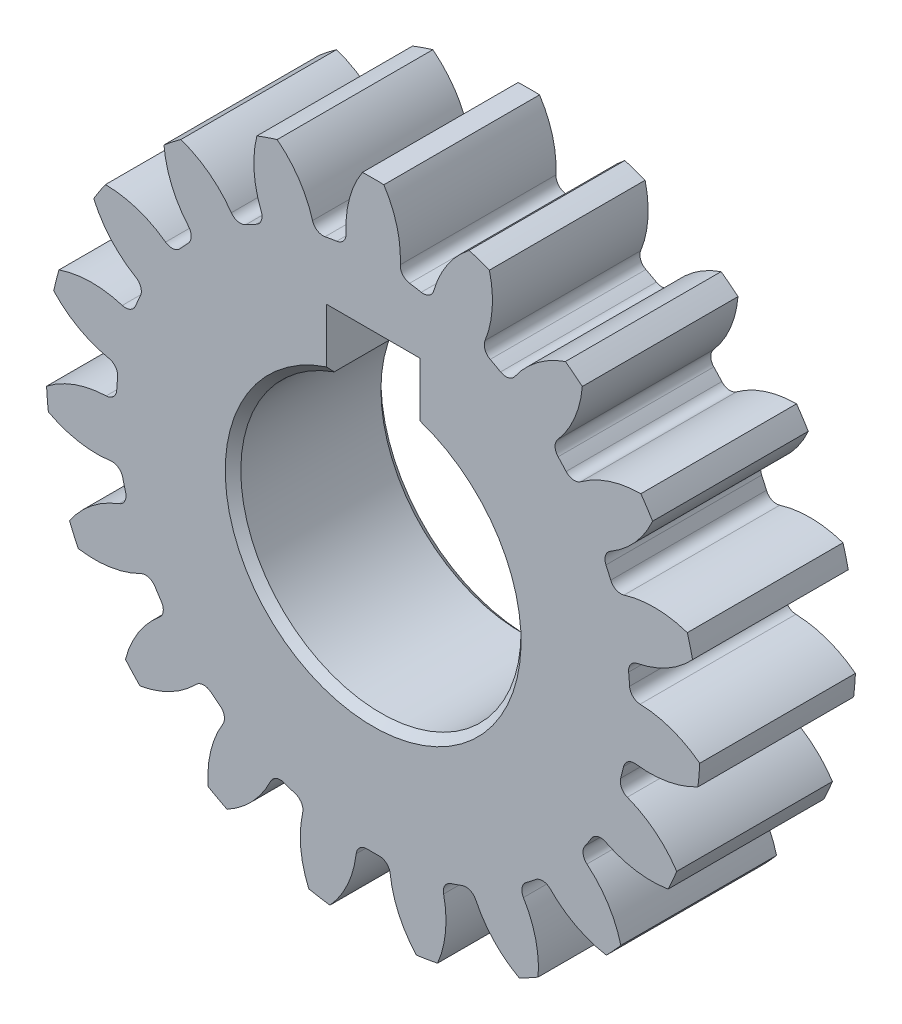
ISO-10303-21;
HEADER;
FILE_DESCRIPTION(('STEP AP214'),'2;1');
FILE_NAME('part.step','',(''),(''),'','','');
FILE_SCHEMA(('AUTOMOTIVE_DESIGN { 1 0 10303 214 1 1 1 1 }'));
ENDSEC;
DATA;
#1=APPLICATION_CONTEXT('core data for automotive mechanical design processes');
#2=APPLICATION_PROTOCOL_DEFINITION('international standard','automotive_design',2000,#1);
#3=PRODUCT_CONTEXT('',#1,'mechanical');
#4=PRODUCT('Part','Part','',(#3));
#5=PRODUCT_RELATED_PRODUCT_CATEGORY('part','',(#4));
#6=PRODUCT_DEFINITION_FORMATION('','',#4);
#7=PRODUCT_DEFINITION_CONTEXT('part definition',#1,'design');
#8=PRODUCT_DEFINITION('design','',#6,#7);
#9=PRODUCT_DEFINITION_SHAPE('','',#8);
#10=(LENGTH_UNIT() NAMED_UNIT(*) SI_UNIT(.MILLI.,.METRE.));
#11=(NAMED_UNIT(*) PLANE_ANGLE_UNIT() SI_UNIT($,.RADIAN.));
#12=(NAMED_UNIT(*) SI_UNIT($,.STERADIAN.) SOLID_ANGLE_UNIT());
#13=UNCERTAINTY_MEASURE_WITH_UNIT(LENGTH_MEASURE(1.E-05),#10,'distance_accuracy_value','');
#14=(GEOMETRIC_REPRESENTATION_CONTEXT(3) GLOBAL_UNCERTAINTY_ASSIGNED_CONTEXT((#13)) GLOBAL_UNIT_ASSIGNED_CONTEXT((#10,
#11,#12)) REPRESENTATION_CONTEXT('',''));
#15=CARTESIAN_POINT('',(0.,0.,0.));
#16=DIRECTION('',(0.,0.,1.));
#17=DIRECTION('',(1.,0.,0.));
#18=AXIS2_PLACEMENT_3D('',#15,#16,#17);
#19=CARTESIAN_POINT('',(0.,0.,2.));
#20=DIRECTION('',(0.,0.,1.));
#21=DIRECTION('',(1.,0.,0.));
#22=AXIS2_PLACEMENT_3D('',#19,#20,#21);
#23=PLANE('',#22);
#24=DIRECTION('',(0.,-1.,0.));
#25=VECTOR('',#24,1.);
#26=CARTESIAN_POINT('',(-3.,0.,2.));
#27=LINE('',#26,#25);
#28=CARTESIAN_POINT('',(-3.,12.5,2.));
#29=VERTEX_POINT('',#28);
#30=CARTESIAN_POINT('',(-3.,9.01387818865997,2.));
#31=VERTEX_POINT('',#30);
#32=EDGE_CURVE('E802',#29,#31,#27,.T.);
#33=ORIENTED_EDGE('',*,*,#32,.T.);
#34=CARTESIAN_POINT('',(0.,0.,2.));
#35=DIRECTION('',(0.,0.,1.));
#36=DIRECTION('',(1.,0.,0.));
#37=AXIS2_PLACEMENT_3D('',#34,#35,#36);
#38=CIRCLE('',#37,9.5);
#39=CARTESIAN_POINT('',(3.,9.01387818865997,2.));
#40=VERTEX_POINT('',#39);
#41=EDGE_CURVE('E1659',#31,#40,#38,.T.);
#42=ORIENTED_EDGE('',*,*,#41,.T.);
#43=DIRECTION('',(0.,1.,0.));
#44=VECTOR('',#43,1.);
#45=CARTESIAN_POINT('',(3.,0.,2.));
#46=LINE('',#45,#44);
#47=CARTESIAN_POINT('',(3.,12.5,2.));
#48=VERTEX_POINT('',#47);
#49=EDGE_CURVE('E797',#40,#48,#46,.T.);
#50=ORIENTED_EDGE('',*,*,#49,.T.);
#51=DIRECTION('',(-1.,0.,0.));
#52=VECTOR('',#51,1.);
#53=CARTESIAN_POINT('',(0.,12.5,2.));
#54=LINE('',#53,#52);
#55=EDGE_CURVE('E785',#48,#29,#54,.T.);
#56=ORIENTED_EDGE('',*,*,#55,.T.);
#57=EDGE_LOOP('',(#33,#42,#50,#56));
#58=FACE_BOUND('',#57,.T.);
#59=CARTESIAN_POINT('',(0.,0.,2.));
#60=DIRECTION('',(0.,0.,1.));
#61=DIRECTION('',(1.,0.,0.));
#62=AXIS2_PLACEMENT_3D('',#59,#60,#61);
#63=CIRCLE('',#62,16.5);
#64=CARTESIAN_POINT('',(3.08965909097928,16.2081463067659,2.));
#65=VERTEX_POINT('',#64);
#66=CARTESIAN_POINT('',(2.34052366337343,16.33315489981,2.));
#67=VERTEX_POINT('',#66);
#68=EDGE_CURVE('E1251',#65,#67,#63,.T.);
#69=ORIENTED_EDGE('',*,*,#68,.F.);
#70=CARTESIAN_POINT('',(3.22073553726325,16.8957646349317,2.));
#71=DIRECTION('',(0.,0.,1.));
#72=DIRECTION('',(1.,0.,0.));
#73=AXIS2_PLACEMENT_3D('',#70,#71,#72);
#74=CIRCLE('',#73,0.7);
#75=CARTESIAN_POINT('',(3.89368205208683,16.7030394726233,2.));
#76=VERTEX_POINT('',#75);
#77=EDGE_CURVE('E1317',#65,#76,#74,.T.);
#78=ORIENTED_EDGE('',*,*,#77,.T.);
#79=CARTESIAN_POINT('',(10.227188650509,14.889186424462,2.));
#80=DIRECTION('',(0.,0.,1.));
#81=DIRECTION('',(0.945817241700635,-0.324699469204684,0.));
#82=AXIS2_PLACEMENT_3D('',#79,#80,#81);
#83=CIRCLE('',#82,6.5881233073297);
#84=CARTESIAN_POINT('',(6.16388163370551,20.0750233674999,2.));
#85=VERTEX_POINT('',#84);
#86=EDGE_CURVE('E1233',#85,#76,#83,.T.);
#87=ORIENTED_EDGE('',*,*,#86,.F.);
#88=CARTESIAN_POINT('',(0.,0.,2.));
#89=DIRECTION('',(0.,0.,1.));
#90=DIRECTION('',(0.945817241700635,-0.324699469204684,0.));
#91=AXIS2_PLACEMENT_3D('',#88,#89,#90);
#92=CIRCLE('',#91,21.);
#93=CARTESIAN_POINT('',(7.46616586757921,19.6279486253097,2.));
#94=VERTEX_POINT('',#93);
#95=EDGE_CURVE('E1231',#94,#85,#92,.T.);
#96=ORIENTED_EDGE('',*,*,#95,.F.);
#97=CARTESIAN_POINT('',(1.07443872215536,18.0313294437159,2.));
#98=DIRECTION('',(0.,0.,-1.));
#99=DIRECTION('',(-0.945817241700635,0.324699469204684,0.));
#100=AXIS2_PLACEMENT_3D('',#97,#98,#99);
#101=CIRCLE('',#100,6.5881233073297);
#102=CARTESIAN_POINT('',(7.18655694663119,15.5725940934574,2.));
#103=VERTEX_POINT('',#102);
#104=EDGE_CURVE('E1228',#94,#103,#101,.T.);
#105=ORIENTED_EDGE('',*,*,#104,.T.);
#106=CARTESIAN_POINT('',(7.8359805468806,15.3113490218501,2.));
#107=DIRECTION('',(0.,0.,1.));
#108=DIRECTION('',(1.,0.,0.));
#109=AXIS2_PLACEMENT_3D('',#106,#107,#108);
#110=CIRCLE('',#109,0.7);
#111=CARTESIAN_POINT('',(7.51707436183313,14.6882127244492,2.));
#112=VERTEX_POINT('',#111);
#113=EDGE_CURVE('E1312',#103,#112,#110,.T.);
#114=ORIENTED_EDGE('',*,*,#113,.T.);
#115=CARTESIAN_POINT('',(0.,0.,2.));
#116=DIRECTION('',(0.,0.,1.));
#117=DIRECTION('',(0.945817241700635,-0.324699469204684,0.));
#118=AXIS2_PLACEMENT_3D('',#115,#116,#117);
#119=CIRCLE('',#118,16.5);
#120=CARTESIAN_POINT('',(8.18502934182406,14.3267335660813,2.));
#121=VERTEX_POINT('',#120);
#122=EDGE_CURVE('E1226',#121,#112,#119,.T.);
#123=ORIENTED_EDGE('',*,*,#122,.F.);
#124=CARTESIAN_POINT('',(8.53227301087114,14.9345343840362,2.));
#125=DIRECTION('',(0.,0.,1.));
#126=DIRECTION('',(1.,0.,0.));
#127=AXIS2_PLACEMENT_3D('',#124,#125,#126);
#128=CIRCLE('',#127,0.7);
#129=CARTESIAN_POINT('',(9.10617966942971,14.533746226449,2.));
#130=VERTEX_POINT('',#129);
#131=EDGE_CURVE('E1337',#121,#130,#128,.T.);
#132=ORIENTED_EDGE('',*,*,#131,.T.);
#133=CARTESIAN_POINT('',(14.5075622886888,10.7616865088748,2.));
#134=DIRECTION('',(0.,0.,1.));
#135=DIRECTION('',(0.789140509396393,-0.614212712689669,0.));
#136=AXIS2_PLACEMENT_3D('',#133,#134,#135);
#137=CIRCLE('',#136,6.5881233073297);
#138=CARTESIAN_POINT('',(12.3482549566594,16.9858941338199,2.));
#139=VERTEX_POINT('',#138);
#140=EDGE_CURVE('E1208',#139,#130,#137,.T.);
#141=ORIENTED_EDGE('',*,*,#140,.F.);
#142=CARTESIAN_POINT('',(0.,0.,2.));
#143=DIRECTION('',(0.,0.,1.));
#144=DIRECTION('',(0.789140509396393,-0.614212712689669,0.));
#145=AXIS2_PLACEMENT_3D('',#142,#143,#144);
#146=CIRCLE('',#145,21.);
#147=CARTESIAN_POINT('',(13.434812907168,16.140192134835,2.));
#148=VERTEX_POINT('',#147);
#149=EDGE_CURVE('E1206',#148,#139,#146,.T.);
#150=ORIENTED_EDGE('',*,*,#149,.F.);
#151=CARTESIAN_POINT('',(6.87098576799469,16.705472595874,2.));
#152=DIRECTION('',(0.,0.,-1.));
#153=DIRECTION('',(-0.789140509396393,0.614212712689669,0.));
#154=AXIS2_PLACEMENT_3D('',#151,#152,#153);
#155=CIRCLE('',#154,6.5881233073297);
#156=CARTESIAN_POINT('',(11.8535825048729,12.395356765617,2.));
#157=VERTEX_POINT('',#156);
#158=EDGE_CURVE('E1203',#148,#157,#155,.T.);
#159=ORIENTED_EDGE('',*,*,#158,.T.);
#160=CARTESIAN_POINT('',(12.3829924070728,11.9373991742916,2.));
#161=DIRECTION('',(0.,0.,1.));
#162=DIRECTION('',(1.,0.,0.));
#163=AXIS2_PLACEMENT_3D('',#160,#161,#162);
#164=CIRCLE('',#163,0.7);
#165=CARTESIAN_POINT('',(11.8790334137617,11.4515747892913,2.));
#166=VERTEX_POINT('',#165);
#167=EDGE_CURVE('E1332',#157,#166,#164,.T.);
#168=ORIENTED_EDGE('',*,*,#167,.T.);
#169=CARTESIAN_POINT('',(0.,0.,2.));
#170=DIRECTION('',(0.,0.,1.));
#171=DIRECTION('',(0.789140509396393,-0.614212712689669,0.));
#172=AXIS2_PLACEMENT_3D('',#169,#170,#171);
#173=CIRCLE('',#172,16.5);
#174=CARTESIAN_POINT('',(12.3934246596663,10.8927969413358,2.));
#175=VERTEX_POINT('',#174);
#176=EDGE_CURVE('E1201',#175,#166,#173,.T.);
#177=ORIENTED_EDGE('',*,*,#176,.F.);
#178=CARTESIAN_POINT('',(12.9192063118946,11.3549155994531,2.));
#179=DIRECTION('',(0.,0.,1.));
#180=DIRECTION('',(1.,0.,0.));
#181=AXIS2_PLACEMENT_3D('',#178,#179,#180);
#182=CIRCLE('',#181,0.7);
#183=CARTESIAN_POINT('',(13.331881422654,10.7894960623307,2.));
#184=VERTEX_POINT('',#183);
#185=EDGE_CURVE('E1357',#175,#184,#182,.T.);
#186=ORIENTED_EDGE('',*,*,#185,.T.);
#187=CARTESIAN_POINT('',(17.2158164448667,5.46799087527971,2.));
#188=DIRECTION('',(0.,0.,1.));
#189=DIRECTION('',(0.546948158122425,-0.83716647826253,0.));
#190=AXIS2_PLACEMENT_3D('',#187,#188,#189);
#191=CIRCLE('',#190,6.5881233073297);
#192=CARTESIAN_POINT('',(17.194503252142,12.0560797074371,2.));
#193=VERTEX_POINT('',#192);
#194=EDGE_CURVE('E1183',#193,#184,#191,.T.);
#195=ORIENTED_EDGE('',*,*,#194,.F.);
#196=CARTESIAN_POINT('',(0.,0.,2.));
#197=DIRECTION('',(0.,0.,1.));
#198=DIRECTION('',(0.546948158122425,-0.83716647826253,0.));
#199=AXIS2_PLACEMENT_3D('',#196,#197,#198);
#200=CIRCLE('',#199,21.);
#201=CARTESIAN_POINT('',(17.9475895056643,10.9033953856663,2.));
#202=VERTEX_POINT('',#201);
#203=EDGE_CURVE('E1181',#202,#193,#200,.T.);
#204=ORIENTED_EDGE('',*,*,#203,.F.);
#205=CARTESIAN_POINT('',(11.9229548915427,13.5693185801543,2.));
#206=DIRECTION('',(0.,0.,-1.));
#207=DIRECTION('',(-0.546948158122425,0.83716647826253,0.));
#208=AXIS2_PLACEMENT_3D('',#205,#206,#207);
#209=CIRCLE('',#208,6.5881233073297);
#210=CARTESIAN_POINT('',(15.2360884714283,7.87489019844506,2.));
#211=VERTEX_POINT('',#210);
#212=EDGE_CURVE('E1178',#202,#211,#209,.T.);
#213=ORIENTED_EDGE('',*,*,#212,.T.);
#214=CARTESIAN_POINT('',(15.5881148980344,7.26984689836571,2.));
#215=DIRECTION('',(0.,0.,1.));
#216=DIRECTION('',(1.,0.,0.));
#217=AXIS2_PLACEMENT_3D('',#214,#215,#216);
#218=CIRCLE('',#217,0.7);
#219=CARTESIAN_POINT('',(14.9537148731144,6.97398103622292,2.));
#220=VERTEX_POINT('',#219);
#221=EDGE_CURVE('E1352',#211,#220,#218,.T.);
#222=ORIENTED_EDGE('',*,*,#221,.T.);
#223=CARTESIAN_POINT('',(0.,0.,2.));
#224=DIRECTION('',(0.,0.,1.));
#225=DIRECTION('',(0.546948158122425,-0.83716647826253,0.));
#226=AXIS2_PLACEMENT_3D('',#223,#224,#225);
#227=CIRCLE('',#226,16.5);
#228=CARTESIAN_POINT('',(15.2588001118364,6.27845674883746,2.));
#229=VERTEX_POINT('',#228);
#230=EDGE_CURVE('E1176',#229,#220,#227,.T.);
#231=ORIENTED_EDGE('',*,*,#230,.F.);
#232=CARTESIAN_POINT('',(15.906143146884,6.54481552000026,2.));
#233=DIRECTION('',(0.,0.,1.));
#234=DIRECTION('',(1.,0.,0.));
#235=AXIS2_PLACEMENT_3D('',#232,#233,#234);
#236=CIRCLE('',#235,0.7);
#237=CARTESIAN_POINT('',(16.1128669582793,5.87603658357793,2.));
#238=VERTEX_POINT('',#237);
#239=EDGE_CURVE('E1377',#229,#238,#236,.T.);
#240=ORIENTED_EDGE('',*,*,#239,.T.);
#241=CARTESIAN_POINT('',(18.0584697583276,-0.418246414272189,2.));
#242=DIRECTION('',(0.,0.,1.));
#243=DIRECTION('',(0.245485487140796,-0.969400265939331,0.));
#244=AXIS2_PLACEMENT_3D('',#241,#242,#243);
#245=CIRCLE('',#244,6.5881233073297);
#246=CARTESIAN_POINT('',(20.1774603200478,5.81980197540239,2.));
#247=VERTEX_POINT('',#246);
#248=EDGE_CURVE('E1158',#247,#238,#245,.T.);
#249=ORIENTED_EDGE('',*,*,#248,.F.);
#250=CARTESIAN_POINT('',(0.,0.,2.));
#251=DIRECTION('',(0.,0.,1.));
#252=DIRECTION('',(0.245485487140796,-0.969400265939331,0.));
#253=AXIS2_PLACEMENT_3D('',#250,#251,#252);
#254=CIRCLE('',#253,21.);
#255=CARTESIAN_POINT('',(20.5154662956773,4.48504656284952,2.));
#256=VERTEX_POINT('',#255);
#257=EDGE_CURVE('E1156',#256,#247,#254,.T.);
#258=ORIENTED_EDGE('',*,*,#257,.F.);
#259=CARTESIAN_POINT('',(15.6828868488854,8.96271834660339,2.));
#260=DIRECTION('',(0.,0.,-1.));
#261=DIRECTION('',(-0.245485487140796,0.969400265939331,0.));
#262=AXIS2_PLACEMENT_3D('',#259,#260,#261);
#263=CIRCLE('',#262,6.5881233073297);
#264=CARTESIAN_POINT('',(16.9675278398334,2.5010570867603,2.));
#265=VERTEX_POINT('',#264);
#266=EDGE_CURVE('E1153',#256,#265,#263,.T.);
#267=ORIENTED_EDGE('',*,*,#266,.T.);
#268=CARTESIAN_POINT('',(17.1040232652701,1.81449390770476,2.));
#269=DIRECTION('',(0.,0.,1.));
#270=DIRECTION('',(1.,0.,0.));
#271=AXIS2_PLACEMENT_3D('',#268,#269,#270);
#272=CIRCLE('',#271,0.7);
#273=CARTESIAN_POINT('',(16.4079292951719,1.74064822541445,2.));
#274=VERTEX_POINT('',#273);
#275=EDGE_CURVE('E1372',#265,#274,#272,.T.);
#276=ORIENTED_EDGE('',*,*,#275,.T.);
#277=CARTESIAN_POINT('',(0.,0.,2.));
#278=DIRECTION('',(0.,0.,1.));
#279=DIRECTION('',(0.245485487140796,-0.969400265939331,0.));
#280=AXIS2_PLACEMENT_3D('',#277,#278,#279);
#281=CIRCLE('',#280,16.5);
#282=CARTESIAN_POINT('',(16.4706478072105,0.983748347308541,2.));
#283=VERTEX_POINT('',#282);
#284=EDGE_CURVE('E1151',#283,#274,#281,.T.);
#285=ORIENTED_EDGE('',*,*,#284,.F.);
#286=CARTESIAN_POINT('',(17.1694025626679,1.02548312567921,2.));
#287=DIRECTION('',(0.,0.,1.));
#288=DIRECTION('',(1.,0.,0.));
#289=AXIS2_PLACEMENT_3D('',#286,#287,#288);
#290=CIRCLE('',#289,0.7);
#291=CARTESIAN_POINT('',(17.1477733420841,0.325817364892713,2.));
#292=VERTEX_POINT('',#291);
#293=EDGE_CURVE('E1397',#283,#292,#290,.T.);
#294=ORIENTED_EDGE('',*,*,#293,.T.);
#295=CARTESIAN_POINT('',(16.9442076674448,-6.25916021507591,2.));
#296=DIRECTION('',(0.,0.,1.));
#297=DIRECTION('',(-0.0825793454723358,-0.99658449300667,0.));
#298=AXIS2_PLACEMENT_3D('',#295,#296,#297);
#299=CIRCLE('',#298,6.5881233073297);
#300=CARTESIAN_POINT('',(20.9738764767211,-1.04714160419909,2.));
#301=VERTEX_POINT('',#300);
#302=EDGE_CURVE('E1133',#301,#292,#299,.T.);
#303=ORIENTED_EDGE('',*,*,#302,.F.);
#304=CARTESIAN_POINT('',(0.,0.,2.));
#305=DIRECTION('',(0.,0.,1.));
#306=DIRECTION('',(-0.0825793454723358,-0.99658449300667,0.));
#307=AXIS2_PLACEMENT_3D('',#304,#305,#306);
#308=CIRCLE('',#307,21.);
#309=CARTESIAN_POINT('',(20.8601739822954,-2.41932664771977,2.));
#310=VERTEX_POINT('',#309);
#311=EDGE_CURVE('E1131',#310,#301,#308,.T.);
#312=ORIENTED_EDGE('',*,*,#311,.F.);
#313=CARTESIAN_POINT('',(17.7433346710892,3.38486850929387,2.));
#314=DIRECTION('',(0.,0.,-1.));
#315=DIRECTION('',(0.0825793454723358,0.99658449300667,0.));
#316=AXIS2_PLACEMENT_3D('',#313,#314,#315);
#317=CIRCLE('',#316,6.5881233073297);
#318=CARTESIAN_POINT('',(16.8602722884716,-3.14380436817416,2.));
#319=VERTEX_POINT('',#318);
#320=EDGE_CURVE('E1128',#310,#319,#317,.T.);
#321=ORIENTED_EDGE('',*,*,#320,.T.);
#322=CARTESIAN_POINT('',(16.7664453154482,-3.83748765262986,2.));
#323=DIRECTION('',(0.,0.,1.));
#324=DIRECTION('',(1.,0.,0.));
#325=AXIS2_PLACEMENT_3D('',#322,#323,#324);
#326=CIRCLE('',#325,0.7);
#327=CARTESIAN_POINT('',(16.0840899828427,-3.68131082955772,2.));
#328=VERTEX_POINT('',#327);
#329=EDGE_CURVE('E1392',#319,#328,#326,.T.);
#330=ORIENTED_EDGE('',*,*,#329,.T.);
#331=CARTESIAN_POINT('',(0.,0.,2.));
#332=DIRECTION('',(0.,0.,1.));
#333=DIRECTION('',(-0.0825793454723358,-0.99658449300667,0.));
#334=AXIS2_PLACEMENT_3D('',#331,#332,#333);
#335=CIRCLE('',#334,16.5);
#336=CARTESIAN_POINT('',(15.8976452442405,-4.41756445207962,2.));
#337=VERTEX_POINT('',#336);
#338=EDGE_CURVE('E1126',#337,#328,#335,.T.);
#339=ORIENTED_EDGE('',*,*,#338,.F.);
#340=CARTESIAN_POINT('',(16.5720908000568,-4.60497627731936,2.));
#341=DIRECTION('',(0.,0.,1.));
#342=DIRECTION('',(1.,0.,0.));
#343=AXIS2_PLACEMENT_3D('',#340,#341,#342);
#344=CIRCLE('',#343,0.7);
#345=CARTESIAN_POINT('',(16.324452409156,-5.25970922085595,2.));
#346=VERTEX_POINT('',#345);
#347=EDGE_CURVE('E1417',#337,#346,#344,.T.);
#348=ORIENTED_EDGE('',*,*,#347,.T.);
#349=CARTESIAN_POINT('',(13.9937777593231,-11.4217968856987,2.));
#350=DIRECTION('',(0.,0.,1.));
#351=DIRECTION('',(-0.401695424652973,-0.915773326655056,0.));
#352=AXIS2_PLACEMENT_3D('',#349,#350,#351);
#353=CIRCLE('',#352,6.5881233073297);
#354=CARTESIAN_POINT('',(19.4974476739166,-7.80061114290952,2.));
#355=VERTEX_POINT('',#354);
#356=EDGE_CURVE('E1108',#355,#346,#353,.T.);
#357=ORIENTED_EDGE('',*,*,#356,.F.);
#358=CARTESIAN_POINT('',(0.,0.,2.));
#359=DIRECTION('',(0.,0.,1.));
#360=DIRECTION('',(-0.401695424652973,-0.915773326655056,0.));
#361=AXIS2_PLACEMENT_3D('',#358,#359,#360);
#362=CIRCLE('',#361,21.);
#363=CARTESIAN_POINT('',(18.9443581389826,-9.06152827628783,2.));
#364=VERTEX_POINT('',#363);
#365=EDGE_CURVE('E1106',#364,#355,#362,.T.);
#366=ORIENTED_EDGE('',*,*,#365,.F.);
#367=CARTESIAN_POINT('',(17.8810168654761,-2.55978435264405,2.));
#368=DIRECTION('',(0.,0.,-1.));
#369=DIRECTION('',(0.401695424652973,0.915773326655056,0.));
#370=AXIS2_PLACEMENT_3D('',#367,#368,#369);
#371=CIRCLE('',#370,6.5881233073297);
#372=CARTESIAN_POINT('',(14.9259446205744,-8.44798583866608,2.));
#373=VERTEX_POINT('',#372);
#374=EDGE_CURVE('E1103',#364,#373,#371,.T.);
#375=ORIENTED_EDGE('',*,*,#374,.T.);
#376=CARTESIAN_POINT('',(14.6119628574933,-9.073617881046,2.));
#377=DIRECTION('',(0.,0.,1.));
#378=DIRECTION('',(1.,0.,0.));
#379=AXIS2_PLACEMENT_3D('',#376,#377,#378);
#380=CIRCLE('',#379,0.7);
#381=CARTESIAN_POINT('',(14.0172899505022,-8.70434273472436,2.));
#382=VERTEX_POINT('',#381);
#383=EDGE_CURVE('E1412',#373,#382,#380,.T.);
#384=ORIENTED_EDGE('',*,*,#383,.T.);
#385=CARTESIAN_POINT('',(0.,0.,2.));
#386=DIRECTION('',(0.,0.,1.));
#387=DIRECTION('',(-0.401695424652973,-0.915773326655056,0.));
#388=AXIS2_PLACEMENT_3D('',#385,#386,#387);
#389=CIRCLE('',#388,16.5);
#390=CARTESIAN_POINT('',(13.601886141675,-9.34016559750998,2.));
#391=VERTEX_POINT('',#390);
#392=EDGE_CURVE('E1101',#391,#382,#389,.T.);
#393=ORIENTED_EDGE('',*,*,#392,.F.);
#394=CARTESIAN_POINT('',(14.1789358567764,-9.73641504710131,2.));
#395=DIRECTION('',(0.,0.,1.));
#396=DIRECTION('',(1.,0.,0.));
#397=AXIS2_PLACEMENT_3D('',#394,#395,#396);
#398=CIRCLE('',#397,0.7);
#399=CARTESIAN_POINT('',(13.7321237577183,-10.2752646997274,2.));
#400=VERTEX_POINT('',#399);
#401=EDGE_CURVE('E1437',#391,#400,#398,.T.);
#402=ORIENTED_EDGE('',*,*,#401,.T.);
#403=CARTESIAN_POINT('',(9.52690489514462,-15.346704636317,2.));
#404=DIRECTION('',(0.,0.,1.));
#405=DIRECTION('',(-0.677281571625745,-0.735723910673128,0.));
#406=AXIS2_PLACEMENT_3D('',#403,#404,#405);
#407=CIRCLE('',#406,6.5881233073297);
#408=CARTESIAN_POINT('',(15.9081678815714,-13.7087634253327,2.));
#409=VERTEX_POINT('',#408);
#410=EDGE_CURVE('E1083',#409,#400,#407,.T.);
#411=ORIENTED_EDGE('',*,*,#410,.F.);
#412=CARTESIAN_POINT('',(0.,0.,2.));
#413=DIRECTION('',(0.,0.,1.));
#414=DIRECTION('',(-0.677281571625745,-0.735723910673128,0.));
#415=AXIS2_PLACEMENT_3D('',#412,#413,#414);
#416=CIRCLE('',#415,21.);
#417=CARTESIAN_POINT('',(14.9756271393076,-14.7217727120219,2.));
#418=VERTEX_POINT('',#417);
#419=EDGE_CURVE('E1081',#418,#409,#416,.T.);
#420=ORIENTED_EDGE('',*,*,#419,.F.);
#421=CARTESIAN_POINT('',(16.0810134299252,-8.22704486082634,2.));
#422=DIRECTION('',(0.,0.,-1.));
#423=DIRECTION('',(0.677281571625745,0.735723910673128,0.));
#424=AXIS2_PLACEMENT_3D('',#421,#422,#423);
#425=CIRCLE('',#424,6.5881233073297);
#426=CARTESIAN_POINT('',(11.3741592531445,-12.8366969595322,2.));
#427=VERTEX_POINT('',#426);
#428=EDGE_CURVE('E1078',#418,#427,#425,.T.);
#429=ORIENTED_EDGE('',*,*,#428,.T.);
#430=CARTESIAN_POINT('',(10.8740474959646,-13.3264808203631,2.));
#431=DIRECTION('',(0.,0.,1.));
#432=DIRECTION('',(1.,0.,0.));
#433=AXIS2_PLACEMENT_3D('',#430,#431,#432);
#434=CIRCLE('',#433,0.7);
#435=CARTESIAN_POINT('',(10.4314990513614,-12.7841240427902,2.));
#436=VERTEX_POINT('',#435);
#437=EDGE_CURVE('E1432',#427,#436,#434,.T.);
#438=ORIENTED_EDGE('',*,*,#437,.T.);
#439=CARTESIAN_POINT('',(0.,0.,2.));
#440=DIRECTION('',(0.,0.,1.));
#441=DIRECTION('',(-0.677281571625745,-0.735723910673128,0.));
#442=AXIS2_PLACEMENT_3D('',#439,#440,#441);
#443=CIRCLE('',#442,16.5);
#444=CARTESIAN_POINT('',(9.83215162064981,-13.2506148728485,2.));
#445=VERTEX_POINT('',#444);
#446=EDGE_CURVE('E1076',#445,#436,#443,.T.);
#447=ORIENTED_EDGE('',*,*,#446,.F.);
#448=CARTESIAN_POINT('',(10.2492732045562,-13.8127621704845,2.));
#449=DIRECTION('',(0.,0.,1.));
#450=DIRECTION('',(1.,0.,0.));
#451=AXIS2_PLACEMENT_3D('',#448,#449,#450);
#452=CIRCLE('',#451,0.7);
#453=CARTESIAN_POINT('',(9.65170642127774,-14.1773358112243,2.));
#454=VERTEX_POINT('',#453);
#455=EDGE_CURVE('E1457',#445,#454,#452,.T.);
#456=ORIENTED_EDGE('',*,*,#455,.T.);
#457=CARTESIAN_POINT('',(4.02764406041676,-17.6085588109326,2.));
#458=DIRECTION('',(0.,0.,1.));
#459=DIRECTION('',(-0.879473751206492,-0.475947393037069,0.));
#460=AXIS2_PLACEMENT_3D('',#457,#458,#459);
#461=CIRCLE('',#460,6.5881233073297);
#462=CARTESIAN_POINT('',(10.5949912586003,-18.13135847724,2.));
#463=VERTEX_POINT('',#462);
#464=EDGE_CURVE('E1058',#463,#454,#461,.T.);
#465=ORIENTED_EDGE('',*,*,#464,.F.);
#466=CARTESIAN_POINT('',(0.,0.,2.));
#467=DIRECTION('',(0.,0.,1.));
#468=DIRECTION('',(-0.879473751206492,-0.475947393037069,0.));
#469=AXIS2_PLACEMENT_3D('',#466,#467,#468);
#470=CIRCLE('',#469,21.);
#471=CARTESIAN_POINT('',(9.38405456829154,-18.7866846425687,2.));
#472=VERTEX_POINT('',#471);
#473=EDGE_CURVE('E1056',#472,#463,#470,.T.);
#474=ORIENTED_EDGE('',*,*,#473,.F.);
#475=CARTESIAN_POINT('',(12.5383826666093,-13.0027774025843,2.));
#476=DIRECTION('',(0.,0.,-1.));
#477=DIRECTION('',(0.879473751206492,0.475947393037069,0.));
#478=AXIS2_PLACEMENT_3D('',#475,#476,#477);
#479=CIRCLE('',#478,6.5881233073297);
#480=CARTESIAN_POINT('',(6.58980724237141,-15.8343527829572,2.));
#481=VERTEX_POINT('',#480);
#482=EDGE_CURVE('E1053',#472,#481,#479,.T.);
#483=ORIENTED_EDGE('',*,*,#482,.T.);
#484=CARTESIAN_POINT('',(5.95776036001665,-16.1352127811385,2.));
#485=DIRECTION('',(0.,0.,1.));
#486=DIRECTION('',(1.,0.,0.));
#487=AXIS2_PLACEMENT_3D('',#484,#485,#486);
#488=CIRCLE('',#487,0.7);
#489=CARTESIAN_POINT('',(5.71529336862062,-15.4785471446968,2.));
#490=VERTEX_POINT('',#489);
#491=EDGE_CURVE('E1452',#481,#490,#488,.T.);
#492=ORIENTED_EDGE('',*,*,#491,.T.);
#493=CARTESIAN_POINT('',(0.,0.,2.));
#494=DIRECTION('',(0.,0.,1.));
#495=DIRECTION('',(-0.879473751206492,-0.475947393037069,0.));
#496=AXIS2_PLACEMENT_3D('',#493,#494,#495);
#497=CIRCLE('',#496,16.5);
#498=CARTESIAN_POINT('',(4.99695090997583,-15.7251544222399,2.));
#499=VERTEX_POINT('',#498);
#500=EDGE_CURVE('E1051',#499,#490,#497,.T.);
#501=ORIENTED_EDGE('',*,*,#500,.F.);
#502=CARTESIAN_POINT('',(5.20894276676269,-16.3922821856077,2.));
#503=DIRECTION('',(0.,0.,1.));
#504=DIRECTION('',(1.,0.,0.));
#505=AXIS2_PLACEMENT_3D('',#502,#503,#504);
#506=CIRCLE('',#505,0.7);
#507=CARTESIAN_POINT('',(4.52537693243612,-16.5430726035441,2.));
#508=VERTEX_POINT('',#507);
#509=EDGE_CURVE('E1477',#499,#508,#506,.T.);
#510=ORIENTED_EDGE('',*,*,#509,.T.);
#511=CARTESIAN_POINT('',(-1.90807450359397,-17.9622524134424,2.));
#512=DIRECTION('',(0.,0.,1.));
#513=DIRECTION('',(-0.986361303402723,-0.164594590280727,0.));
#514=AXIS2_PLACEMENT_3D('',#511,#512,#513);
#515=CIRCLE('',#514,6.5881233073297);
#516=CARTESIAN_POINT('',(4.13368293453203,-20.5891395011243,2.));
#517=VERTEX_POINT('',#516);
#518=EDGE_CURVE('E1033',#517,#508,#515,.T.);
#519=ORIENTED_EDGE('',*,*,#518,.F.);
#520=CARTESIAN_POINT('',(0.,0.,2.));
#521=DIRECTION('',(0.,0.,1.));
#522=DIRECTION('',(-0.986361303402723,-0.164594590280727,0.));
#523=AXIS2_PLACEMENT_3D('',#520,#521,#522);
#524=CIRCLE('',#523,21.);
#525=CARTESIAN_POINT('',(2.77557407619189,-20.8157677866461,2.));
#526=VERTEX_POINT('',#525);
#527=EDGE_CURVE('E1031',#526,#517,#524,.T.);
#528=ORIENTED_EDGE('',*,*,#527,.F.);
#529=CARTESIAN_POINT('',(7.63702358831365,-16.3694572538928,2.));
#530=DIRECTION('',(0.,0.,-1.));
#531=DIRECTION('',(0.986361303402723,0.164594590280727,0.));
#532=AXIS2_PLACEMENT_3D('',#529,#530,#531);
#533=CIRCLE('',#532,6.5881233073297);
#534=CARTESIAN_POINT('',(1.09134736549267,-17.1161107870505,2.));
#535=VERTEX_POINT('',#534);
#536=EDGE_CURVE('E1028',#526,#535,#533,.T.);
#537=ORIENTED_EDGE('',*,*,#536,.T.);
#538=CARTESIAN_POINT('',(0.395857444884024,-17.1954440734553,2.));
#539=DIRECTION('',(0.,0.,1.));
#540=DIRECTION('',(1.,0.,0.));
#541=AXIS2_PLACEMENT_3D('',#538,#539,#540);
#542=CIRCLE('',#541,0.7);
#543=CARTESIAN_POINT('',(0.379746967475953,-16.4956294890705,2.));
#544=VERTEX_POINT('',#543);
#545=EDGE_CURVE('E1472',#535,#544,#542,.T.);
#546=ORIENTED_EDGE('',*,*,#545,.T.);
#547=CARTESIAN_POINT('',(0.,0.,2.));
#548=DIRECTION('',(0.,0.,1.));
#549=DIRECTION('',(-0.986361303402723,-0.164594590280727,0.));
#550=AXIS2_PLACEMENT_3D('',#547,#548,#549);
#551=CIRCLE('',#550,16.5);
#552=CARTESIAN_POINT('',(-0.379746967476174,-16.4956294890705,2.));
#553=VERTEX_POINT('',#552);
#554=EDGE_CURVE('E1026',#553,#544,#551,.T.);
#555=ORIENTED_EDGE('',*,*,#554,.F.);
#556=CARTESIAN_POINT('',(-0.395857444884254,-17.1954440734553,2.));
#557=DIRECTION('',(0.,0.,1.));
#558=DIRECTION('',(1.,0.,0.));
#559=AXIS2_PLACEMENT_3D('',#556,#557,#558);
#560=CIRCLE('',#559,0.7);
#561=CARTESIAN_POINT('',(-1.0913473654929,-17.1161107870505,2.));
#562=VERTEX_POINT('',#561);
#563=EDGE_CURVE('E1497',#553,#562,#560,.T.);
#564=ORIENTED_EDGE('',*,*,#563,.T.);
#565=CARTESIAN_POINT('',(-7.63702358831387,-16.3694572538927,2.));
#566=DIRECTION('',(0.,0.,1.));
#567=DIRECTION('',(-0.986361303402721,0.164594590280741,0.));
#568=AXIS2_PLACEMENT_3D('',#565,#566,#567);
#569=CIRCLE('',#568,6.5881233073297);
#570=CARTESIAN_POINT('',(-2.77557407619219,-20.815767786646,2.));
#571=VERTEX_POINT('',#570);
#572=EDGE_CURVE('E1008',#571,#562,#569,.T.);
#573=ORIENTED_EDGE('',*,*,#572,.F.);
#574=CARTESIAN_POINT('',(0.,0.,2.));
#575=DIRECTION('',(0.,0.,1.));
#576=DIRECTION('',(-0.986361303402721,0.164594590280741,0.));
#577=AXIS2_PLACEMENT_3D('',#574,#575,#576);
#578=CIRCLE('',#577,21.);
#579=CARTESIAN_POINT('',(-4.13368293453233,-20.5891395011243,2.));
#580=VERTEX_POINT('',#579);
#581=EDGE_CURVE('E1006',#580,#571,#578,.T.);
#582=ORIENTED_EDGE('',*,*,#581,.F.);
#583=CARTESIAN_POINT('',(1.90807450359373,-17.9622524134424,2.));
#584=DIRECTION('',(0.,0.,-1.));
#585=DIRECTION('',(0.986361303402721,-0.164594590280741,0.));
#586=AXIS2_PLACEMENT_3D('',#583,#584,#585);
#587=CIRCLE('',#586,6.5881233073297);
#588=CARTESIAN_POINT('',(-4.52537693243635,-16.543072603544,2.));
#589=VERTEX_POINT('',#588);
#590=EDGE_CURVE('E1003',#580,#589,#587,.T.);
#591=ORIENTED_EDGE('',*,*,#590,.T.);
#592=CARTESIAN_POINT('',(-5.20894276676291,-16.3922821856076,2.));
#593=DIRECTION('',(0.,0.,1.));
#594=DIRECTION('',(1.,0.,0.));
#595=AXIS2_PLACEMENT_3D('',#592,#593,#594);
#596=CIRCLE('',#595,0.7);
#597=CARTESIAN_POINT('',(-4.99695090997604,-15.7251544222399,2.));
#598=VERTEX_POINT('',#597);
#599=EDGE_CURVE('E1492',#589,#598,#596,.T.);
#600=ORIENTED_EDGE('',*,*,#599,.T.);
#601=CARTESIAN_POINT('',(0.,0.,2.));
#602=DIRECTION('',(0.,0.,1.));
#603=DIRECTION('',(-0.986361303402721,0.164594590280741,0.));
#604=AXIS2_PLACEMENT_3D('',#601,#602,#603);
#605=CIRCLE('',#604,16.5);
#606=CARTESIAN_POINT('',(-5.71529336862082,-15.4785471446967,2.));
#607=VERTEX_POINT('',#606);
#608=EDGE_CURVE('E1001',#607,#598,#605,.T.);
#609=ORIENTED_EDGE('',*,*,#608,.F.);
#610=CARTESIAN_POINT('',(-5.95776036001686,-16.1352127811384,2.));
#611=DIRECTION('',(0.,0.,1.));
#612=DIRECTION('',(1.,0.,0.));
#613=AXIS2_PLACEMENT_3D('',#610,#611,#612);
#614=CIRCLE('',#613,0.7);
#615=CARTESIAN_POINT('',(-6.58980724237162,-15.8343527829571,2.));
#616=VERTEX_POINT('',#615);
#617=EDGE_CURVE('E1517',#607,#616,#614,.T.);
#618=ORIENTED_EDGE('',*,*,#617,.T.);
#619=CARTESIAN_POINT('',(-12.5383826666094,-13.0027774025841,2.));
#620=DIRECTION('',(0.,0.,1.));
#621=DIRECTION('',(-0.879473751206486,0.47594739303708,0.));
#622=AXIS2_PLACEMENT_3D('',#619,#620,#621);
#623=CIRCLE('',#622,6.5881233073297);
#624=CARTESIAN_POINT('',(-9.3840545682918,-18.7866846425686,2.));
#625=VERTEX_POINT('',#624);
#626=EDGE_CURVE('E983',#625,#616,#623,.T.);
#627=ORIENTED_EDGE('',*,*,#626,.F.);
#628=CARTESIAN_POINT('',(0.,0.,2.));
#629=DIRECTION('',(0.,0.,1.));
#630=DIRECTION('',(-0.879473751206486,0.47594739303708,0.));
#631=AXIS2_PLACEMENT_3D('',#628,#629,#630);
#632=CIRCLE('',#631,21.);
#633=CARTESIAN_POINT('',(-10.5949912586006,-18.1313584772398,2.));
#634=VERTEX_POINT('',#633);
#635=EDGE_CURVE('E981',#634,#625,#632,.T.);
#636=ORIENTED_EDGE('',*,*,#635,.F.);
#637=CARTESIAN_POINT('',(-4.02764406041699,-17.6085588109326,2.));
#638=DIRECTION('',(0.,0.,-1.));
#639=DIRECTION('',(0.879473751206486,-0.47594739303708,0.));
#640=AXIS2_PLACEMENT_3D('',#637,#638,#639);
#641=CIRCLE('',#640,6.5881233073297);
#642=CARTESIAN_POINT('',(-9.65170642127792,-14.1773358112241,2.));
#643=VERTEX_POINT('',#642);
#644=EDGE_CURVE('E978',#634,#643,#641,.T.);
#645=ORIENTED_EDGE('',*,*,#644,.T.);
#646=CARTESIAN_POINT('',(-10.2492732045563,-13.8127621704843,2.));
#647=DIRECTION('',(0.,0.,1.));
#648=DIRECTION('',(1.,0.,0.));
#649=AXIS2_PLACEMENT_3D('',#646,#647,#648);
#650=CIRCLE('',#649,0.7);
#651=CARTESIAN_POINT('',(-9.83215162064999,-13.2506148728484,2.));
#652=VERTEX_POINT('',#651);
#653=EDGE_CURVE('E1512',#643,#652,#650,.T.);
#654=ORIENTED_EDGE('',*,*,#653,.T.);
#655=CARTESIAN_POINT('',(0.,0.,2.));
#656=DIRECTION('',(0.,0.,1.));
#657=DIRECTION('',(-0.879473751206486,0.47594739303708,0.));
#658=AXIS2_PLACEMENT_3D('',#655,#656,#657);
#659=CIRCLE('',#658,16.5);
#660=CARTESIAN_POINT('',(-10.4314990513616,-12.78412404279,2.));
#661=VERTEX_POINT('',#660);
#662=EDGE_CURVE('E976',#661,#652,#659,.T.);
#663=ORIENTED_EDGE('',*,*,#662,.F.);
#664=CARTESIAN_POINT('',(-10.8740474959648,-13.326480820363,2.));
#665=DIRECTION('',(0.,0.,1.));
#666=DIRECTION('',(1.,0.,0.));
#667=AXIS2_PLACEMENT_3D('',#664,#665,#666);
#668=CIRCLE('',#667,0.7);
#669=CARTESIAN_POINT('',(-11.3741592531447,-12.836696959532,2.));
#670=VERTEX_POINT('',#669);
#671=EDGE_CURVE('E1537',#661,#670,#668,.T.);
#672=ORIENTED_EDGE('',*,*,#671,.T.);
#673=CARTESIAN_POINT('',(-16.0810134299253,-8.22704486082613,2.));
#674=DIRECTION('',(0.,0.,1.));
#675=DIRECTION('',(-0.677281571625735,0.735723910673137,0.));
#676=AXIS2_PLACEMENT_3D('',#673,#674,#675);
#677=CIRCLE('',#676,6.5881233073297);
#678=CARTESIAN_POINT('',(-14.9756271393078,-14.7217727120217,2.));
#679=VERTEX_POINT('',#678);
#680=EDGE_CURVE('E958',#679,#670,#677,.T.);
#681=ORIENTED_EDGE('',*,*,#680,.F.);
#682=CARTESIAN_POINT('',(0.,0.,2.));
#683=DIRECTION('',(0.,0.,1.));
#684=DIRECTION('',(-0.677281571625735,0.735723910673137,0.));
#685=AXIS2_PLACEMENT_3D('',#682,#683,#684);
#686=CIRCLE('',#685,21.);
#687=CARTESIAN_POINT('',(-15.9081678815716,-13.7087634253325,2.));
#688=VERTEX_POINT('',#687);
#689=EDGE_CURVE('E956',#688,#679,#686,.T.);
#690=ORIENTED_EDGE('',*,*,#689,.F.);
#691=CARTESIAN_POINT('',(-9.52690489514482,-15.3467046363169,2.));
#692=DIRECTION('',(0.,0.,-1.));
#693=DIRECTION('',(0.677281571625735,-0.735723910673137,0.));
#694=AXIS2_PLACEMENT_3D('',#691,#692,#693);
#695=CIRCLE('',#694,6.5881233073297);
#696=CARTESIAN_POINT('',(-13.7321237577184,-10.2752646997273,2.));
#697=VERTEX_POINT('',#696);
#698=EDGE_CURVE('E953',#688,#697,#695,.T.);
#699=ORIENTED_EDGE('',*,*,#698,.T.);
#700=CARTESIAN_POINT('',(-14.1789358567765,-9.73641504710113,2.));
#701=DIRECTION('',(0.,0.,1.));
#702=DIRECTION('',(1.,0.,0.));
#703=AXIS2_PLACEMENT_3D('',#700,#701,#702);
#704=CIRCLE('',#703,0.7);
#705=CARTESIAN_POINT('',(-13.6018861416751,-9.3401655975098,2.));
#706=VERTEX_POINT('',#705);
#707=EDGE_CURVE('E1532',#697,#706,#704,.T.);
#708=ORIENTED_EDGE('',*,*,#707,.T.);
#709=CARTESIAN_POINT('',(0.,0.,2.));
#710=DIRECTION('',(0.,0.,1.));
#711=DIRECTION('',(-0.677281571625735,0.735723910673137,0.));
#712=AXIS2_PLACEMENT_3D('',#709,#710,#711);
#713=CIRCLE('',#712,16.5);
#714=CARTESIAN_POINT('',(-14.0172899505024,-8.70434273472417,2.));
#715=VERTEX_POINT('',#714);
#716=EDGE_CURVE('E951',#715,#706,#713,.T.);
#717=ORIENTED_EDGE('',*,*,#716,.F.);
#718=CARTESIAN_POINT('',(-14.6119628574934,-9.0736178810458,2.));
#719=DIRECTION('',(0.,0.,1.));
#720=DIRECTION('',(1.,0.,0.));
#721=AXIS2_PLACEMENT_3D('',#718,#719,#720);
#722=CIRCLE('',#721,0.7);
#723=CARTESIAN_POINT('',(-14.9259446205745,-8.44798583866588,2.));
#724=VERTEX_POINT('',#723);
#725=EDGE_CURVE('E1557',#715,#724,#722,.T.);
#726=ORIENTED_EDGE('',*,*,#725,.T.);
#727=CARTESIAN_POINT('',(-17.8810168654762,-2.55978435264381,2.));
#728=DIRECTION('',(0.,0.,1.));
#729=DIRECTION('',(-0.401695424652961,0.915773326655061,0.));
#730=AXIS2_PLACEMENT_3D('',#727,#728,#729);
#731=CIRCLE('',#730,6.5881233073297);
#732=CARTESIAN_POINT('',(-18.9443581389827,-9.06152827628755,2.));
#733=VERTEX_POINT('',#732);
#734=EDGE_CURVE('E933',#733,#724,#731,.T.);
#735=ORIENTED_EDGE('',*,*,#734,.F.);
#736=CARTESIAN_POINT('',(0.,0.,2.));
#737=DIRECTION('',(0.,0.,1.));
#738=DIRECTION('',(-0.401695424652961,0.915773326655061,0.));
#739=AXIS2_PLACEMENT_3D('',#736,#737,#738);
#740=CIRCLE('',#739,21.);
#741=CARTESIAN_POINT('',(-19.4974476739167,-7.80061114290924,2.));
#742=VERTEX_POINT('',#741);
#743=EDGE_CURVE('E931',#742,#733,#740,.T.);
#744=ORIENTED_EDGE('',*,*,#743,.F.);
#745=CARTESIAN_POINT('',(-13.9937777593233,-11.4217968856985,2.));
#746=DIRECTION('',(0.,0.,-1.));
#747=DIRECTION('',(0.401695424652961,-0.915773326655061,0.));
#748=AXIS2_PLACEMENT_3D('',#745,#746,#747);
#749=CIRCLE('',#748,6.5881233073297);
#750=CARTESIAN_POINT('',(-16.3244524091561,-5.25970922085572,2.));
#751=VERTEX_POINT('',#750);
#752=EDGE_CURVE('E928',#742,#751,#749,.T.);
#753=ORIENTED_EDGE('',*,*,#752,.T.);
#754=CARTESIAN_POINT('',(-16.5720908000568,-4.60497627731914,2.));
#755=DIRECTION('',(0.,0.,1.));
#756=DIRECTION('',(1.,0.,0.));
#757=AXIS2_PLACEMENT_3D('',#754,#755,#756);
#758=CIRCLE('',#757,0.7);
#759=CARTESIAN_POINT('',(-15.8976452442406,-4.41756445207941,2.));
#760=VERTEX_POINT('',#759);
#761=EDGE_CURVE('E1552',#751,#760,#758,.T.);
#762=ORIENTED_EDGE('',*,*,#761,.T.);
#763=CARTESIAN_POINT('',(0.,0.,2.));
#764=DIRECTION('',(0.,0.,1.));
#765=DIRECTION('',(-0.401695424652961,0.915773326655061,0.));
#766=AXIS2_PLACEMENT_3D('',#763,#764,#765);
#767=CIRCLE('',#766,16.5);
#768=CARTESIAN_POINT('',(-16.0840899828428,-3.68131082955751,2.));
#769=VERTEX_POINT('',#768);
#770=EDGE_CURVE('E926',#769,#760,#767,.T.);
#771=ORIENTED_EDGE('',*,*,#770,.F.);
#772=CARTESIAN_POINT('',(-16.7664453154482,-3.83748765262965,2.));
#773=DIRECTION('',(0.,0.,1.));
#774=DIRECTION('',(1.,0.,0.));
#775=AXIS2_PLACEMENT_3D('',#772,#773,#774);
#776=CIRCLE('',#775,0.7);
#777=CARTESIAN_POINT('',(-16.8602722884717,-3.14380436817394,2.));
#778=VERTEX_POINT('',#777);
#779=EDGE_CURVE('E1577',#769,#778,#776,.T.);
#780=ORIENTED_EDGE('',*,*,#779,.T.);
#781=CARTESIAN_POINT('',(-17.7433346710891,3.3848685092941,2.));
#782=DIRECTION('',(0.,0.,1.));
#783=DIRECTION('',(-0.082579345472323,0.996584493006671,0.));
#784=AXIS2_PLACEMENT_3D('',#781,#782,#783);
#785=CIRCLE('',#784,6.5881233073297);
#786=CARTESIAN_POINT('',(-20.8601739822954,-2.41932664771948,2.));
#787=VERTEX_POINT('',#786);
#788=EDGE_CURVE('E908',#787,#778,#785,.T.);
#789=ORIENTED_EDGE('',*,*,#788,.F.);
#790=CARTESIAN_POINT('',(0.,0.,2.));
#791=DIRECTION('',(0.,0.,1.));
#792=DIRECTION('',(-0.082579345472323,0.996584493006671,0.));
#793=AXIS2_PLACEMENT_3D('',#790,#791,#792);
#794=CIRCLE('',#793,21.);
#795=CARTESIAN_POINT('',(-20.9738764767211,-1.0471416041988,2.));
#796=VERTEX_POINT('',#795);
#797=EDGE_CURVE('E906',#796,#787,#794,.T.);
#798=ORIENTED_EDGE('',*,*,#797,.F.);
#799=CARTESIAN_POINT('',(-16.9442076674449,-6.25916021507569,2.));
#800=DIRECTION('',(0.,0.,-1.));
#801=DIRECTION('',(0.082579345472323,-0.996584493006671,0.));
#802=AXIS2_PLACEMENT_3D('',#799,#800,#801);
#803=CIRCLE('',#802,6.5881233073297);
#804=CARTESIAN_POINT('',(-17.1477733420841,0.325817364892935,2.));
#805=VERTEX_POINT('',#804);
#806=EDGE_CURVE('E903',#796,#805,#803,.T.);
#807=ORIENTED_EDGE('',*,*,#806,.T.);
#808=CARTESIAN_POINT('',(-17.1694025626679,1.02548312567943,2.));
#809=DIRECTION('',(0.,0.,1.));
#810=DIRECTION('',(1.,0.,0.));
#811=AXIS2_PLACEMENT_3D('',#808,#809,#810);
#812=CIRCLE('',#811,0.7);
#813=CARTESIAN_POINT('',(-16.4706478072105,0.983748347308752,2.));
#814=VERTEX_POINT('',#813);
#815=EDGE_CURVE('E1572',#805,#814,#812,.T.);
#816=ORIENTED_EDGE('',*,*,#815,.T.);
#817=CARTESIAN_POINT('',(0.,0.,2.));
#818=DIRECTION('',(0.,0.,1.));
#819=DIRECTION('',(-0.082579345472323,0.996584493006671,0.));
#820=AXIS2_PLACEMENT_3D('',#817,#818,#819);
#821=CIRCLE('',#820,16.5);
#822=CARTESIAN_POINT('',(-16.4079292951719,1.74064822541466,2.));
#823=VERTEX_POINT('',#822);
#824=EDGE_CURVE('E901',#823,#814,#821,.T.);
#825=ORIENTED_EDGE('',*,*,#824,.F.);
#826=CARTESIAN_POINT('',(-17.1040232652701,1.81449390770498,2.));
#827=DIRECTION('',(0.,0.,1.));
#828=DIRECTION('',(1.,0.,0.));
#829=AXIS2_PLACEMENT_3D('',#826,#827,#828);
#830=CIRCLE('',#829,0.7);
#831=CARTESIAN_POINT('',(-16.9675278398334,2.50105708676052,2.));
#832=VERTEX_POINT('',#831);
#833=EDGE_CURVE('E1597',#823,#832,#830,.T.);
#834=ORIENTED_EDGE('',*,*,#833,.T.);
#835=CARTESIAN_POINT('',(-15.6828868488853,8.96271834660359,2.));
#836=DIRECTION('',(0.,0.,1.));
#837=DIRECTION('',(0.245485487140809,0.969400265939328,0.));
#838=AXIS2_PLACEMENT_3D('',#835,#836,#837);
#839=CIRCLE('',#838,6.5881233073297);
#840=CARTESIAN_POINT('',(-20.5154662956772,4.4850465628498,2.));
#841=VERTEX_POINT('',#840);
#842=EDGE_CURVE('E883',#841,#832,#839,.T.);
#843=ORIENTED_EDGE('',*,*,#842,.F.);
#844=CARTESIAN_POINT('',(0.,0.,2.));
#845=DIRECTION('',(0.,0.,1.));
#846=DIRECTION('',(0.245485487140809,0.969400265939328,0.));
#847=AXIS2_PLACEMENT_3D('',#844,#845,#846);
#848=CIRCLE('',#847,21.);
#849=CARTESIAN_POINT('',(-20.1774603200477,5.81980197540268,2.));
#850=VERTEX_POINT('',#849);
#851=EDGE_CURVE('E881',#850,#841,#848,.T.);
#852=ORIENTED_EDGE('',*,*,#851,.F.);
#853=CARTESIAN_POINT('',(-18.0584697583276,-0.418246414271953,2.));
#854=DIRECTION('',(0.,0.,-1.));
#855=DIRECTION('',(-0.245485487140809,-0.969400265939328,0.));
#856=AXIS2_PLACEMENT_3D('',#853,#854,#855);
#857=CIRCLE('',#856,6.5881233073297);
#858=CARTESIAN_POINT('',(-16.1128669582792,5.87603658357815,2.));
#859=VERTEX_POINT('',#858);
#860=EDGE_CURVE('E878',#850,#859,#857,.T.);
#861=ORIENTED_EDGE('',*,*,#860,.T.);
#862=CARTESIAN_POINT('',(-15.9061431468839,6.54481552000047,2.));
#863=DIRECTION('',(0.,0.,1.));
#864=DIRECTION('',(1.,0.,0.));
#865=AXIS2_PLACEMENT_3D('',#862,#863,#864);
#866=CIRCLE('',#865,0.7);
#867=CARTESIAN_POINT('',(-15.2588001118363,6.27845674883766,2.));
#868=VERTEX_POINT('',#867);
#869=EDGE_CURVE('E1592',#859,#868,#866,.T.);
#870=ORIENTED_EDGE('',*,*,#869,.T.);
#871=CARTESIAN_POINT('',(0.,0.,2.));
#872=DIRECTION('',(0.,0.,1.));
#873=DIRECTION('',(0.245485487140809,0.969400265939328,0.));
#874=AXIS2_PLACEMENT_3D('',#871,#872,#873);
#875=CIRCLE('',#874,16.5);
#876=CARTESIAN_POINT('',(-14.9537148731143,6.97398103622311,2.));
#877=VERTEX_POINT('',#876);
#878=EDGE_CURVE('E876',#877,#868,#875,.T.);
#879=ORIENTED_EDGE('',*,*,#878,.F.);
#880=CARTESIAN_POINT('',(-15.5881148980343,7.26984689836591,2.));
#881=DIRECTION('',(0.,0.,1.));
#882=DIRECTION('',(1.,0.,0.));
#883=AXIS2_PLACEMENT_3D('',#880,#881,#882);
#884=CIRCLE('',#883,0.7);
#885=CARTESIAN_POINT('',(-15.2360884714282,7.87489019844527,2.));
#886=VERTEX_POINT('',#885);
#887=EDGE_CURVE('E1617',#877,#886,#884,.T.);
#888=ORIENTED_EDGE('',*,*,#887,.T.);
#889=CARTESIAN_POINT('',(-11.9229548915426,13.5693185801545,2.));
#890=DIRECTION('',(0.,0.,1.));
#891=DIRECTION('',(0.546948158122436,0.837166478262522,0.));
#892=AXIS2_PLACEMENT_3D('',#889,#890,#891);
#893=CIRCLE('',#892,6.5881233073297);
#894=CARTESIAN_POINT('',(-17.9475895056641,10.9033953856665,2.));
#895=VERTEX_POINT('',#894);
#896=EDGE_CURVE('E858',#895,#886,#893,.T.);
#897=ORIENTED_EDGE('',*,*,#896,.F.);
#898=CARTESIAN_POINT('',(0.,0.,2.));
#899=DIRECTION('',(0.,0.,1.));
#900=DIRECTION('',(0.546948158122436,0.837166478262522,0.));
#901=AXIS2_PLACEMENT_3D('',#898,#899,#900);
#902=CIRCLE('',#901,21.);
#903=CARTESIAN_POINT('',(-17.1945032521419,12.0560797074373,2.));
#904=VERTEX_POINT('',#903);
#905=EDGE_CURVE('E856',#904,#895,#902,.T.);
#906=ORIENTED_EDGE('',*,*,#905,.F.);
#907=CARTESIAN_POINT('',(-17.2158164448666,5.46799087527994,2.));
#908=DIRECTION('',(0.,0.,-1.));
#909=DIRECTION('',(-0.546948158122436,-0.837166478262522,0.));
#910=AXIS2_PLACEMENT_3D('',#907,#908,#909);
#911=CIRCLE('',#910,6.5881233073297);
#912=CARTESIAN_POINT('',(-13.3318814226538,10.7894960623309,2.));
#913=VERTEX_POINT('',#912);
#914=EDGE_CURVE('E853',#904,#913,#911,.T.);
#915=ORIENTED_EDGE('',*,*,#914,.T.);
#916=CARTESIAN_POINT('',(-12.9192063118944,11.3549155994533,2.));
#917=DIRECTION('',(0.,0.,1.));
#918=DIRECTION('',(1.,0.,0.));
#919=AXIS2_PLACEMENT_3D('',#916,#917,#918);
#920=CIRCLE('',#919,0.7);
#921=CARTESIAN_POINT('',(-12.3934246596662,10.892796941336,2.));
#922=VERTEX_POINT('',#921);
#923=EDGE_CURVE('E1612',#913,#922,#920,.T.);
#924=ORIENTED_EDGE('',*,*,#923,.T.);
#925=CARTESIAN_POINT('',(0.,0.,2.));
#926=DIRECTION('',(0.,0.,1.));
#927=DIRECTION('',(0.546948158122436,0.837166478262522,0.));
#928=AXIS2_PLACEMENT_3D('',#925,#926,#927);
#929=CIRCLE('',#928,16.5);
#930=CARTESIAN_POINT('',(-11.8790334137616,11.4515747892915,2.));
#931=VERTEX_POINT('',#930);
#932=EDGE_CURVE('E851',#931,#922,#929,.T.);
#933=ORIENTED_EDGE('',*,*,#932,.F.);
#934=CARTESIAN_POINT('',(-12.3829924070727,11.9373991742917,2.));
#935=DIRECTION('',(0.,0.,1.));
#936=DIRECTION('',(1.,0.,0.));
#937=AXIS2_PLACEMENT_3D('',#934,#935,#936);
#938=CIRCLE('',#937,0.7);
#939=CARTESIAN_POINT('',(-11.8535825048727,12.3953567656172,2.));
#940=VERTEX_POINT('',#939);
#941=EDGE_CURVE('E1637',#931,#940,#938,.T.);
#942=ORIENTED_EDGE('',*,*,#941,.T.);
#943=CARTESIAN_POINT('',(-6.87098576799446,16.7054725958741,2.));
#944=DIRECTION('',(0.,0.,1.));
#945=DIRECTION('',(0.789140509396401,0.614212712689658,0.));
#946=AXIS2_PLACEMENT_3D('',#943,#944,#945);
#947=CIRCLE('',#946,6.5881233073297);
#948=CARTESIAN_POINT('',(-13.4348129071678,16.1401921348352,2.));
#949=VERTEX_POINT('',#948);
#950=EDGE_CURVE('E833',#949,#940,#947,.T.);
#951=ORIENTED_EDGE('',*,*,#950,.F.);
#952=CARTESIAN_POINT('',(0.,0.,2.));
#953=DIRECTION('',(0.,0.,1.));
#954=DIRECTION('',(0.789140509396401,0.614212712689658,0.));
#955=AXIS2_PLACEMENT_3D('',#952,#953,#954);
#956=CIRCLE('',#955,21.);
#957=CARTESIAN_POINT('',(-12.3482549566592,16.9858941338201,2.));
#958=VERTEX_POINT('',#957);
#959=EDGE_CURVE('E831',#958,#949,#956,.T.);
#960=ORIENTED_EDGE('',*,*,#959,.F.);
#961=CARTESIAN_POINT('',(-14.5075622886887,10.761686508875,2.));
#962=DIRECTION('',(0.,0.,-1.));
#963=DIRECTION('',(-0.789140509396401,-0.614212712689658,0.));
#964=AXIS2_PLACEMENT_3D('',#961,#962,#963);
#965=CIRCLE('',#964,6.5881233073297);
#966=CARTESIAN_POINT('',(-9.10617966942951,14.5337462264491,2.));
#967=VERTEX_POINT('',#966);
#968=EDGE_CURVE('E828',#958,#967,#965,.T.);
#969=ORIENTED_EDGE('',*,*,#968,.T.);
#970=CARTESIAN_POINT('',(-8.53227301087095,14.9345343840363,2.));
#971=DIRECTION('',(0.,0.,1.));
#972=DIRECTION('',(1.,0.,0.));
#973=AXIS2_PLACEMENT_3D('',#970,#971,#972);
#974=CIRCLE('',#973,0.7);
#975=CARTESIAN_POINT('',(-8.18502934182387,14.3267335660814,2.));
#976=VERTEX_POINT('',#975);
#977=EDGE_CURVE('E1632',#967,#976,#974,.T.);
#978=ORIENTED_EDGE('',*,*,#977,.T.);
#979=CARTESIAN_POINT('',(0.,0.,2.));
#980=DIRECTION('',(0.,0.,1.));
#981=DIRECTION('',(0.789140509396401,0.614212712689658,0.));
#982=AXIS2_PLACEMENT_3D('',#979,#980,#981);
#983=CIRCLE('',#982,16.5);
#984=CARTESIAN_POINT('',(-7.51707436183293,14.6882127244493,2.));
#985=VERTEX_POINT('',#984);
#986=EDGE_CURVE('E826',#985,#976,#983,.T.);
#987=ORIENTED_EDGE('',*,*,#986,.F.);
#988=CARTESIAN_POINT('',(-7.83598054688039,15.3113490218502,2.));
#989=DIRECTION('',(0.,0.,1.));
#990=DIRECTION('',(1.,0.,0.));
#991=AXIS2_PLACEMENT_3D('',#988,#989,#990);
#992=CIRCLE('',#991,0.7);
#993=CARTESIAN_POINT('',(-7.18655694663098,15.5725940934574,2.));
#994=VERTEX_POINT('',#993);
#995=EDGE_CURVE('E1655',#985,#994,#992,.T.);
#996=ORIENTED_EDGE('',*,*,#995,.T.);
#997=CARTESIAN_POINT('',(-1.07443872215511,18.0313294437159,2.));
#998=DIRECTION('',(0.,0.,1.));
#999=DIRECTION('',(0.945817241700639,0.324699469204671,0.));
#1000=AXIS2_PLACEMENT_3D('',#997,#998,#999);
#1001=CIRCLE('',#1000,6.5881233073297);
#1002=CARTESIAN_POINT('',(-7.46616586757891,19.6279486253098,2.));
#1003=VERTEX_POINT('',#1002);
#1004=EDGE_CURVE('E810',#1003,#994,#1001,.T.);
#1005=ORIENTED_EDGE('',*,*,#1004,.F.);
#1006=CARTESIAN_POINT('',(0.,0.,2.));
#1007=DIRECTION('',(0.,0.,1.));
#1008=DIRECTION('',(0.945817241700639,0.324699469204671,0.));
#1009=AXIS2_PLACEMENT_3D('',#1006,#1007,#1008);
#1010=CIRCLE('',#1009,21.);
#1011=CARTESIAN_POINT('',(-6.16388163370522,20.0750233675,2.));
#1012=VERTEX_POINT('',#1011);
#1013=EDGE_CURVE('E808',#1012,#1003,#1010,.T.);
#1014=ORIENTED_EDGE('',*,*,#1013,.F.);
#1015=CARTESIAN_POINT('',(-10.2271886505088,14.8891864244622,2.));
#1016=DIRECTION('',(0.,0.,-1.));
#1017=DIRECTION('',(-0.945817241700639,-0.324699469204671,0.));
#1018=AXIS2_PLACEMENT_3D('',#1015,#1016,#1017);
#1019=CIRCLE('',#1018,6.5881233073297);
#1020=CARTESIAN_POINT('',(-3.8936820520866,16.7030394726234,2.));
#1021=VERTEX_POINT('',#1020);
#1022=EDGE_CURVE('E805',#1012,#1021,#1019,.T.);
#1023=ORIENTED_EDGE('',*,*,#1022,.T.);
#1024=CARTESIAN_POINT('',(-3.22073553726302,16.8957646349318,2.));
#1025=DIRECTION('',(0.,0.,1.));
#1026=DIRECTION('',(1.,0.,0.));
#1027=AXIS2_PLACEMENT_3D('',#1024,#1025,#1026);
#1028=CIRCLE('',#1027,0.7);
#1029=CARTESIAN_POINT('',(-3.08965909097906,16.2081463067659,2.));
#1030=VERTEX_POINT('',#1029);
#1031=EDGE_CURVE('E1651',#1021,#1030,#1028,.T.);
#1032=ORIENTED_EDGE('',*,*,#1031,.T.);
#1033=CARTESIAN_POINT('',(0.,0.,2.));
#1034=DIRECTION('',(0.,0.,-1.));
#1035=DIRECTION('',(-1.,0.,0.));
#1036=AXIS2_PLACEMENT_3D('',#1033,#1034,#1035);
#1037=CIRCLE('',#1036,16.5);
#1038=CARTESIAN_POINT('',(-2.34052366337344,16.33315489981,2.));
#1039=VERTEX_POINT('',#1038);
#1040=EDGE_CURVE('E1261',#1030,#1039,#1037,.T.);
#1041=ORIENTED_EDGE('',*,*,#1040,.T.);
#1042=CARTESIAN_POINT('',(-2.43981860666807,17.0260766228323,2.));
#1043=DIRECTION('',(0.,0.,1.));
#1044=DIRECTION('',(1.,0.,0.));
#1045=AXIS2_PLACEMENT_3D('',#1042,#1043,#1044);
#1046=CIRCLE('',#1045,0.7);
#1047=CARTESIAN_POINT('',(-1.74075643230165,17.0622992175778,2.));
#1048=VERTEX_POINT('',#1047);
#1049=EDGE_CURVE('E1296',#1039,#1048,#1046,.T.);
#1050=ORIENTED_EDGE('',*,*,#1049,.T.);
#1051=CARTESIAN_POINT('',(4.83854043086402,17.4032119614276,2.));
#1052=DIRECTION('',(0.,0.,1.));
#1053=DIRECTION('',(1.,0.,0.));
#1054=AXIS2_PLACEMENT_3D('',#1051,#1052,#1053);
#1055=CIRCLE('',#1054,6.5881233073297);
#1056=CARTESIAN_POINT('',(-0.688443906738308,20.9887123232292,2.));
#1057=VERTEX_POINT('',#1056);
#1058=EDGE_CURVE('E1258',#1057,#1048,#1055,.T.);
#1059=ORIENTED_EDGE('',*,*,#1058,.F.);
#1060=CARTESIAN_POINT('',(0.,0.,2.));
#1061=DIRECTION('',(0.,0.,1.));
#1062=DIRECTION('',(1.,0.,0.));
#1063=AXIS2_PLACEMENT_3D('',#1060,#1061,#1062);
#1064=CIRCLE('',#1063,21.);
#1065=CARTESIAN_POINT('',(0.688443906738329,20.9887123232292,2.));
#1066=VERTEX_POINT('',#1065);
#1067=EDGE_CURVE('E1256',#1066,#1057,#1064,.T.);
#1068=ORIENTED_EDGE('',*,*,#1067,.F.);
#1069=CARTESIAN_POINT('',(-4.83854043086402,17.4032119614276,2.));
#1070=DIRECTION('',(0.,0.,-1.));
#1071=DIRECTION('',(-1.,0.,0.));
#1072=AXIS2_PLACEMENT_3D('',#1069,#1070,#1071);
#1073=CIRCLE('',#1072,6.5881233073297);
#1074=CARTESIAN_POINT('',(1.74075643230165,17.0622992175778,2.));
#1075=VERTEX_POINT('',#1074);
#1076=EDGE_CURVE('E1253',#1066,#1075,#1073,.T.);
#1077=ORIENTED_EDGE('',*,*,#1076,.T.);
#1078=CARTESIAN_POINT('',(2.43981860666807,17.0260766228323,2.));
#1079=DIRECTION('',(0.,0.,1.));
#1080=DIRECTION('',(1.,0.,0.));
#1081=AXIS2_PLACEMENT_3D('',#1078,#1079,#1080);
#1082=CIRCLE('',#1081,0.7);
#1083=EDGE_CURVE('E1291',#1075,#67,#1082,.T.);
#1084=ORIENTED_EDGE('',*,*,#1083,.T.);
#1085=EDGE_LOOP('',(#69,#78,#87,#96,#105,#114,#123,#132,#141,#150,#159,#168,#177,#186,#195,#204,
#213,#222,#231,#240,#249,#258,#267,#276,#285,#294,#303,#312,#321,#330,#339,#348,#357,#366,#375,
#384,#393,#402,#411,#420,#429,#438,#447,#456,#465,#474,#483,#492,#501,#510,#519,#528,#537,#546,
#555,#564,#573,#582,#591,#600,#609,#618,#627,#636,#645,#654,#663,#672,#681,#690,#699,#708,#717,
#726,#735,#744,#753,#762,#771,#780,#789,#798,#807,#816,#825,#834,#843,#852,#861,#870,#879,#888,
#897,#906,#915,#924,#933,#942,#951,#960,#969,#978,#987,#996,#1005,#1014,#1023,#1032,#1041,#1050,
#1059,#1068,#1077,#1084));
#1086=FACE_BOUND('',#1085,.T.);
#1087=ADVANCED_FACE('F32',(#58,#1086),#23,.F.);
#1088=CARTESIAN_POINT('',(0.,0.,12.));
#1089=DIRECTION('',(0.,0.,-1.));
#1090=DIRECTION('',(-1.,0.,0.));
#1091=AXIS2_PLACEMENT_3D('',#1088,#1089,#1090);
#1092=CYLINDRICAL_SURFACE('',#1091,16.5);
#1093=CARTESIAN_POINT('',(0.,0.,12.));
#1094=DIRECTION('',(0.,0.,1.));
#1095=DIRECTION('',(1.,0.,0.));
#1096=AXIS2_PLACEMENT_3D('',#1093,#1094,#1095);
#1097=CIRCLE('',#1096,16.5);
#1098=CARTESIAN_POINT('',(3.08965909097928,16.2081463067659,12.));
#1099=VERTEX_POINT('',#1098);
#1100=CARTESIAN_POINT('',(2.34052366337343,16.33315489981,12.));
#1101=VERTEX_POINT('',#1100);
#1102=EDGE_CURVE('E1263',#1099,#1101,#1097,.T.);
#1103=ORIENTED_EDGE('',*,*,#1102,.F.);
#1104=DIRECTION('',(0.,0.,-1.));
#1105=VECTOR('',#1104,1.);
#1106=CARTESIAN_POINT('',(3.08965909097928,16.2081463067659,12.));
#1107=LINE('',#1106,#1105);
#1108=EDGE_CURVE('E1307',#1099,#65,#1107,.T.);
#1109=ORIENTED_EDGE('',*,*,#1108,.T.);
#1110=ORIENTED_EDGE('',*,*,#68,.T.);
#1111=DIRECTION('',(0.,0.,-1.));
#1112=VECTOR('',#1111,1.);
#1113=CARTESIAN_POINT('',(2.34052366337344,16.3331548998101,12.));
#1114=LINE('',#1113,#1112);
#1115=EDGE_CURVE('E1283',#67,#1101,#1114,.F.);
#1116=ORIENTED_EDGE('',*,*,#1115,.T.);
#1117=EDGE_LOOP('',(#1103,#1109,#1110,#1116));
#1118=FACE_BOUND('',#1117,.T.);
#1119=ADVANCED_FACE('F34',(#1118),#1092,.T.);
#1120=CARTESIAN_POINT('',(-4.83854043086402,17.4032119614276,12.));
#1121=DIRECTION('',(0.,0.,-1.));
#1122=DIRECTION('',(-1.,0.,0.));
#1123=AXIS2_PLACEMENT_3D('',#1120,#1121,#1122);
#1124=CYLINDRICAL_SURFACE('',#1123,6.5881233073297);
#1125=CARTESIAN_POINT('',(-4.83854043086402,17.4032119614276,12.));
#1126=DIRECTION('',(0.,0.,-1.));
#1127=DIRECTION('',(-1.,0.,0.));
#1128=AXIS2_PLACEMENT_3D('',#1125,#1126,#1127);
#1129=CIRCLE('',#1128,6.5881233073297);
#1130=CARTESIAN_POINT('',(0.688443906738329,20.9887123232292,12.));
#1131=VERTEX_POINT('',#1130);
#1132=CARTESIAN_POINT('',(1.74075643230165,17.0622992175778,12.));
#1133=VERTEX_POINT('',#1132);
#1134=EDGE_CURVE('E1265',#1131,#1133,#1129,.T.);
#1135=ORIENTED_EDGE('',*,*,#1134,.T.);
#1136=DIRECTION('',(0.,0.,-1.));
#1137=VECTOR('',#1136,1.);
#1138=CARTESIAN_POINT('',(1.74075643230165,17.0622992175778,12.));
#1139=LINE('',#1138,#1137);
#1140=EDGE_CURVE('E1280',#1133,#1075,#1139,.T.);
#1141=ORIENTED_EDGE('',*,*,#1140,.T.);
#1142=ORIENTED_EDGE('',*,*,#1076,.F.);
#1143=DIRECTION('',(0.,0.,-1.));
#1144=VECTOR('',#1143,1.);
#1145=CARTESIAN_POINT('',(0.688443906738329,20.9887123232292,12.));
#1146=LINE('',#1145,#1144);
#1147=EDGE_CURVE('E1278',#1131,#1066,#1146,.T.);
#1148=ORIENTED_EDGE('',*,*,#1147,.F.);
#1149=EDGE_LOOP('',(#1135,#1141,#1142,#1148));
#1150=FACE_BOUND('',#1149,.T.);
#1151=ADVANCED_FACE('F2139',(#1150),#1124,.T.);
#1152=CARTESIAN_POINT('',(0.,0.,12.));
#1153=DIRECTION('',(0.,0.,-1.));
#1154=DIRECTION('',(-1.,0.,0.));
#1155=AXIS2_PLACEMENT_3D('',#1152,#1153,#1154);
#1156=CYLINDRICAL_SURFACE('',#1155,21.);
#1157=ORIENTED_EDGE('',*,*,#1067,.T.);
#1158=DIRECTION('',(0.,0.,-1.));
#1159=VECTOR('',#1158,1.);
#1160=CARTESIAN_POINT('',(-0.688443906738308,20.9887123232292,12.));
#1161=LINE('',#1160,#1159);
#1162=CARTESIAN_POINT('',(-0.688443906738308,20.9887123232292,12.));
#1163=VERTEX_POINT('',#1162);
#1164=EDGE_CURVE('E1275',#1163,#1057,#1161,.T.);
#1165=ORIENTED_EDGE('',*,*,#1164,.F.);
#1166=CARTESIAN_POINT('',(0.,0.,12.));
#1167=DIRECTION('',(0.,0.,1.));
#1168=DIRECTION('',(1.,0.,0.));
#1169=AXIS2_PLACEMENT_3D('',#1166,#1167,#1168);
#1170=CIRCLE('',#1169,21.);
#1171=EDGE_CURVE('E1268',#1131,#1163,#1170,.T.);
#1172=ORIENTED_EDGE('',*,*,#1171,.F.);
#1173=ORIENTED_EDGE('',*,*,#1147,.T.);
#1174=EDGE_LOOP('',(#1157,#1165,#1172,#1173));
#1175=FACE_BOUND('',#1174,.T.);
#1176=ADVANCED_FACE('F2136',(#1175),#1156,.T.);
#1177=CARTESIAN_POINT('',(4.83854043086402,17.4032119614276,12.));
#1178=DIRECTION('',(0.,0.,-1.));
#1179=DIRECTION('',(-1.,0.,0.));
#1180=AXIS2_PLACEMENT_3D('',#1177,#1178,#1179);
#1181=CYLINDRICAL_SURFACE('',#1180,6.5881233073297);
#1182=ORIENTED_EDGE('',*,*,#1058,.T.);
#1183=DIRECTION('',(0.,0.,-1.));
#1184=VECTOR('',#1183,1.);
#1185=CARTESIAN_POINT('',(-1.74075643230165,17.0622992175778,12.));
#1186=LINE('',#1185,#1184);
#1187=CARTESIAN_POINT('',(-1.74075643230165,17.0622992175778,12.));
#1188=VERTEX_POINT('',#1187);
#1189=EDGE_CURVE('E1289',#1048,#1188,#1186,.F.);
#1190=ORIENTED_EDGE('',*,*,#1189,.T.);
#1191=CARTESIAN_POINT('',(4.83854043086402,17.4032119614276,12.));
#1192=DIRECTION('',(0.,0.,1.));
#1193=DIRECTION('',(1.,0.,0.));
#1194=AXIS2_PLACEMENT_3D('',#1191,#1192,#1193);
#1195=CIRCLE('',#1194,6.5881233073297);
#1196=EDGE_CURVE('E1270',#1163,#1188,#1195,.T.);
#1197=ORIENTED_EDGE('',*,*,#1196,.F.);
#1198=ORIENTED_EDGE('',*,*,#1164,.T.);
#1199=EDGE_LOOP('',(#1182,#1190,#1197,#1198));
#1200=FACE_BOUND('',#1199,.T.);
#1201=ADVANCED_FACE('F2132',(#1200),#1181,.T.);
#1202=CARTESIAN_POINT('',(0.,0.,12.));
#1203=DIRECTION('',(0.,0.,-1.));
#1204=DIRECTION('',(-1.,0.,0.));
#1205=AXIS2_PLACEMENT_3D('',#1202,#1203,#1204);
#1206=CYLINDRICAL_SURFACE('',#1205,16.5);
#1207=ORIENTED_EDGE('',*,*,#1040,.F.);
#1208=DIRECTION('',(0.,0.,-1.));
#1209=VECTOR('',#1208,1.);
#1210=CARTESIAN_POINT('',(-3.08965909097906,16.2081463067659,12.));
#1211=LINE('',#1210,#1209);
#1212=CARTESIAN_POINT('',(-3.08965909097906,16.2081463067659,12.));
#1213=VERTEX_POINT('',#1212);
#1214=EDGE_CURVE('E1644',#1030,#1213,#1211,.F.);
#1215=ORIENTED_EDGE('',*,*,#1214,.T.);
#1216=CARTESIAN_POINT('',(0.,0.,12.));
#1217=DIRECTION('',(0.,0.,-1.));
#1218=DIRECTION('',(-1.,0.,0.));
#1219=AXIS2_PLACEMENT_3D('',#1216,#1217,#1218);
#1220=CIRCLE('',#1219,16.5);
#1221=CARTESIAN_POINT('',(-2.34052366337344,16.33315489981,12.));
#1222=VERTEX_POINT('',#1221);
#1223=EDGE_CURVE('E1273',#1213,#1222,#1220,.T.);
#1224=ORIENTED_EDGE('',*,*,#1223,.T.);
#1225=DIRECTION('',(0.,0.,-1.));
#1226=VECTOR('',#1225,1.);
#1227=CARTESIAN_POINT('',(-2.34052366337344,16.3331548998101,12.));
#1228=LINE('',#1227,#1226);
#1229=EDGE_CURVE('E1286',#1222,#1039,#1228,.T.);
#1230=ORIENTED_EDGE('',*,*,#1229,.T.);
#1231=EDGE_LOOP('',(#1207,#1215,#1224,#1230));
#1232=FACE_BOUND('',#1231,.T.);
#1233=ADVANCED_FACE('F2129',(#1232),#1206,.T.);
#1234=CARTESIAN_POINT('',(0.,0.,12.));
#1235=DIRECTION('',(0.,0.,1.));
#1236=DIRECTION('',(1.,0.,0.));
#1237=AXIS2_PLACEMENT_3D('',#1234,#1235,#1236);
#1238=PLANE('',#1237);
#1239=DIRECTION('',(0.,1.,0.));
#1240=VECTOR('',#1239,1.);
#1241=CARTESIAN_POINT('',(3.,8.48528137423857,12.));
#1242=LINE('',#1241,#1240);
#1243=CARTESIAN_POINT('',(3.,9.01387818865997,12.));
#1244=VERTEX_POINT('',#1243);
#1245=CARTESIAN_POINT('',(3.,12.5,12.));
#1246=VERTEX_POINT('',#1245);
#1247=EDGE_CURVE('E769',#1244,#1246,#1242,.T.);
#1248=ORIENTED_EDGE('',*,*,#1247,.F.);
#1249=CARTESIAN_POINT('',(0.,0.,12.));
#1250=DIRECTION('',(0.,0.,1.));
#1251=DIRECTION('',(1.,0.,0.));
#1252=AXIS2_PLACEMENT_3D('',#1249,#1250,#1251);
#1253=CIRCLE('',#1252,9.5);
#1254=CARTESIAN_POINT('',(-3.,9.01387818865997,12.));
#1255=VERTEX_POINT('',#1254);
#1256=EDGE_CURVE('E11',#1244,#1255,#1253,.F.);
#1257=ORIENTED_EDGE('',*,*,#1256,.T.);
#1258=DIRECTION('',(0.,-1.,0.));
#1259=VECTOR('',#1258,1.);
#1260=CARTESIAN_POINT('',(-3.,8.48528137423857,12.));
#1261=LINE('',#1260,#1259);
#1262=CARTESIAN_POINT('',(-3.,12.5,12.));
#1263=VERTEX_POINT('',#1262);
#1264=EDGE_CURVE('E791',#1263,#1255,#1261,.T.);
#1265=ORIENTED_EDGE('',*,*,#1264,.F.);
#1266=DIRECTION('',(-1.,0.,0.));
#1267=VECTOR('',#1266,1.);
#1268=CARTESIAN_POINT('',(-3.,12.5,12.));
#1269=LINE('',#1268,#1267);
#1270=EDGE_CURVE('E778',#1246,#1263,#1269,.T.);
#1271=ORIENTED_EDGE('',*,*,#1270,.F.);
#1272=EDGE_LOOP('',(#1248,#1257,#1265,#1271));
#1273=FACE_BOUND('',#1272,.T.);
#1274=CARTESIAN_POINT('',(10.227188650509,14.889186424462,12.));
#1275=DIRECTION('',(0.,0.,1.));
#1276=DIRECTION('',(0.945817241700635,-0.324699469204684,0.));
#1277=AXIS2_PLACEMENT_3D('',#1274,#1275,#1276);
#1278=CIRCLE('',#1277,6.5881233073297);
#1279=CARTESIAN_POINT('',(6.16388163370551,20.0750233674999,12.));
#1280=VERTEX_POINT('',#1279);
#1281=CARTESIAN_POINT('',(3.89368205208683,16.7030394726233,12.));
#1282=VERTEX_POINT('',#1281);
#1283=EDGE_CURVE('E1243',#1280,#1282,#1278,.T.);
#1284=ORIENTED_EDGE('',*,*,#1283,.T.);
#1285=CARTESIAN_POINT('',(3.22073553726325,16.8957646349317,12.));
#1286=DIRECTION('',(0.,0.,1.));
#1287=DIRECTION('',(1.,0.,0.));
#1288=AXIS2_PLACEMENT_3D('',#1285,#1286,#1287);
#1289=CIRCLE('',#1288,0.7);
#1290=EDGE_CURVE('E1319',#1282,#1099,#1289,.F.);
#1291=ORIENTED_EDGE('',*,*,#1290,.T.);
#1292=ORIENTED_EDGE('',*,*,#1102,.T.);
#1293=CARTESIAN_POINT('',(2.43981860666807,17.0260766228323,12.));
#1294=DIRECTION('',(0.,0.,1.));
#1295=DIRECTION('',(1.,0.,0.));
#1296=AXIS2_PLACEMENT_3D('',#1293,#1294,#1295);
#1297=CIRCLE('',#1296,0.7);
#1298=EDGE_CURVE('E1294',#1101,#1133,#1297,.F.);
#1299=ORIENTED_EDGE('',*,*,#1298,.T.);
#1300=ORIENTED_EDGE('',*,*,#1134,.F.);
#1301=ORIENTED_EDGE('',*,*,#1171,.T.);
#1302=ORIENTED_EDGE('',*,*,#1196,.T.);
#1303=CARTESIAN_POINT('',(-2.43981860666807,17.0260766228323,12.));
#1304=DIRECTION('',(0.,0.,1.));
#1305=DIRECTION('',(1.,0.,0.));
#1306=AXIS2_PLACEMENT_3D('',#1303,#1304,#1305);
#1307=CIRCLE('',#1306,0.7);
#1308=EDGE_CURVE('E1298',#1188,#1222,#1307,.F.);
#1309=ORIENTED_EDGE('',*,*,#1308,.T.);
#1310=ORIENTED_EDGE('',*,*,#1223,.F.);
#1311=CARTESIAN_POINT('',(-3.22073553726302,16.8957646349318,12.));
#1312=DIRECTION('',(0.,0.,1.));
#1313=DIRECTION('',(1.,0.,0.));
#1314=AXIS2_PLACEMENT_3D('',#1311,#1312,#1313);
#1315=CIRCLE('',#1314,0.7);
#1316=CARTESIAN_POINT('',(-3.8936820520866,16.7030394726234,12.));
#1317=VERTEX_POINT('',#1316);
#1318=EDGE_CURVE('E1653',#1213,#1317,#1315,.F.);
#1319=ORIENTED_EDGE('',*,*,#1318,.T.);
#1320=CARTESIAN_POINT('',(-10.2271886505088,14.8891864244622,12.));
#1321=DIRECTION('',(0.,0.,-1.));
#1322=DIRECTION('',(-0.945817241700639,-0.324699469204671,0.));
#1323=AXIS2_PLACEMENT_3D('',#1320,#1321,#1322);
#1324=CIRCLE('',#1323,6.5881233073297);
#1325=CARTESIAN_POINT('',(-6.16388163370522,20.0750233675,12.));
#1326=VERTEX_POINT('',#1325);
#1327=EDGE_CURVE('E813',#1326,#1317,#1324,.T.);
#1328=ORIENTED_EDGE('',*,*,#1327,.F.);
#1329=CARTESIAN_POINT('',(0.,0.,12.));
#1330=DIRECTION('',(0.,0.,1.));
#1331=DIRECTION('',(0.945817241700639,0.324699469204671,0.));
#1332=AXIS2_PLACEMENT_3D('',#1329,#1330,#1331);
#1333=CIRCLE('',#1332,21.);
#1334=CARTESIAN_POINT('',(-7.46616586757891,19.6279486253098,12.));
#1335=VERTEX_POINT('',#1334);
#1336=EDGE_CURVE('E816',#1326,#1335,#1333,.T.);
#1337=ORIENTED_EDGE('',*,*,#1336,.T.);
#1338=CARTESIAN_POINT('',(-1.07443872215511,18.0313294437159,12.));
#1339=DIRECTION('',(0.,0.,1.));
#1340=DIRECTION('',(0.945817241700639,0.324699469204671,0.));
#1341=AXIS2_PLACEMENT_3D('',#1338,#1339,#1340);
#1342=CIRCLE('',#1341,6.5881233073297);
#1343=CARTESIAN_POINT('',(-7.18655694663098,15.5725940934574,12.));
#1344=VERTEX_POINT('',#1343);
#1345=EDGE_CURVE('E818',#1335,#1344,#1342,.T.);
#1346=ORIENTED_EDGE('',*,*,#1345,.T.);
#1347=CARTESIAN_POINT('',(-7.83598054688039,15.3113490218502,12.));
#1348=DIRECTION('',(0.,0.,1.));
#1349=DIRECTION('',(1.,0.,0.));
#1350=AXIS2_PLACEMENT_3D('',#1347,#1348,#1349);
#1351=CIRCLE('',#1350,0.7);
#1352=CARTESIAN_POINT('',(-7.51707436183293,14.6882127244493,12.));
#1353=VERTEX_POINT('',#1352);
#1354=EDGE_CURVE('E1657',#1344,#1353,#1351,.F.);
#1355=ORIENTED_EDGE('',*,*,#1354,.T.);
#1356=CARTESIAN_POINT('',(0.,0.,12.));
#1357=DIRECTION('',(0.,0.,1.));
#1358=DIRECTION('',(0.789140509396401,0.614212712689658,0.));
#1359=AXIS2_PLACEMENT_3D('',#1356,#1357,#1358);
#1360=CIRCLE('',#1359,16.5);
#1361=CARTESIAN_POINT('',(-8.18502934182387,14.3267335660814,12.));
#1362=VERTEX_POINT('',#1361);
#1363=EDGE_CURVE('E836',#1353,#1362,#1360,.T.);
#1364=ORIENTED_EDGE('',*,*,#1363,.T.);
#1365=CARTESIAN_POINT('',(-8.53227301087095,14.9345343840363,12.));
#1366=DIRECTION('',(0.,0.,1.));
#1367=DIRECTION('',(1.,0.,0.));
#1368=AXIS2_PLACEMENT_3D('',#1365,#1366,#1367);
#1369=CIRCLE('',#1368,0.7);
#1370=CARTESIAN_POINT('',(-9.10617966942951,14.5337462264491,12.));
#1371=VERTEX_POINT('',#1370);
#1372=EDGE_CURVE('E1635',#1362,#1371,#1369,.F.);
#1373=ORIENTED_EDGE('',*,*,#1372,.T.);
#1374=CARTESIAN_POINT('',(-14.5075622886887,10.761686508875,12.));
#1375=DIRECTION('',(0.,0.,-1.));
#1376=DIRECTION('',(-0.789140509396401,-0.614212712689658,0.));
#1377=AXIS2_PLACEMENT_3D('',#1374,#1375,#1376);
#1378=CIRCLE('',#1377,6.5881233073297);
#1379=CARTESIAN_POINT('',(-12.3482549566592,16.9858941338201,12.));
#1380=VERTEX_POINT('',#1379);
#1381=EDGE_CURVE('E838',#1380,#1371,#1378,.T.);
#1382=ORIENTED_EDGE('',*,*,#1381,.F.);
#1383=CARTESIAN_POINT('',(0.,0.,12.));
#1384=DIRECTION('',(0.,0.,1.));
#1385=DIRECTION('',(0.789140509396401,0.614212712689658,0.));
#1386=AXIS2_PLACEMENT_3D('',#1383,#1384,#1385);
#1387=CIRCLE('',#1386,21.);
#1388=CARTESIAN_POINT('',(-13.4348129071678,16.1401921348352,12.));
#1389=VERTEX_POINT('',#1388);
#1390=EDGE_CURVE('E841',#1380,#1389,#1387,.T.);
#1391=ORIENTED_EDGE('',*,*,#1390,.T.);
#1392=CARTESIAN_POINT('',(-6.87098576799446,16.7054725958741,12.));
#1393=DIRECTION('',(0.,0.,1.));
#1394=DIRECTION('',(0.789140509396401,0.614212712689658,0.));
#1395=AXIS2_PLACEMENT_3D('',#1392,#1393,#1394);
#1396=CIRCLE('',#1395,6.5881233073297);
#1397=CARTESIAN_POINT('',(-11.8535825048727,12.3953567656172,12.));
#1398=VERTEX_POINT('',#1397);
#1399=EDGE_CURVE('E843',#1389,#1398,#1396,.T.);
#1400=ORIENTED_EDGE('',*,*,#1399,.T.);
#1401=CARTESIAN_POINT('',(-12.3829924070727,11.9373991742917,12.));
#1402=DIRECTION('',(0.,0.,1.));
#1403=DIRECTION('',(1.,0.,0.));
#1404=AXIS2_PLACEMENT_3D('',#1401,#1402,#1403);
#1405=CIRCLE('',#1404,0.7);
#1406=CARTESIAN_POINT('',(-11.8790334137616,11.4515747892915,12.));
#1407=VERTEX_POINT('',#1406);
#1408=EDGE_CURVE('E1639',#1398,#1407,#1405,.F.);
#1409=ORIENTED_EDGE('',*,*,#1408,.T.);
#1410=CARTESIAN_POINT('',(0.,0.,12.));
#1411=DIRECTION('',(0.,0.,1.));
#1412=DIRECTION('',(0.546948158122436,0.837166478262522,0.));
#1413=AXIS2_PLACEMENT_3D('',#1410,#1411,#1412);
#1414=CIRCLE('',#1413,16.5);
#1415=CARTESIAN_POINT('',(-12.3934246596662,10.892796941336,12.));
#1416=VERTEX_POINT('',#1415);
#1417=EDGE_CURVE('E861',#1407,#1416,#1414,.T.);
#1418=ORIENTED_EDGE('',*,*,#1417,.T.);
#1419=CARTESIAN_POINT('',(-12.9192063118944,11.3549155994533,12.));
#1420=DIRECTION('',(0.,0.,1.));
#1421=DIRECTION('',(1.,0.,0.));
#1422=AXIS2_PLACEMENT_3D('',#1419,#1420,#1421);
#1423=CIRCLE('',#1422,0.7);
#1424=CARTESIAN_POINT('',(-13.3318814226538,10.7894960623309,12.));
#1425=VERTEX_POINT('',#1424);
#1426=EDGE_CURVE('E1615',#1416,#1425,#1423,.F.);
#1427=ORIENTED_EDGE('',*,*,#1426,.T.);
#1428=CARTESIAN_POINT('',(-17.2158164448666,5.46799087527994,12.));
#1429=DIRECTION('',(0.,0.,-1.));
#1430=DIRECTION('',(-0.546948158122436,-0.837166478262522,0.));
#1431=AXIS2_PLACEMENT_3D('',#1428,#1429,#1430);
#1432=CIRCLE('',#1431,6.5881233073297);
#1433=CARTESIAN_POINT('',(-17.1945032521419,12.0560797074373,12.));
#1434=VERTEX_POINT('',#1433);
#1435=EDGE_CURVE('E863',#1434,#1425,#1432,.T.);
#1436=ORIENTED_EDGE('',*,*,#1435,.F.);
#1437=CARTESIAN_POINT('',(0.,0.,12.));
#1438=DIRECTION('',(0.,0.,1.));
#1439=DIRECTION('',(0.546948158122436,0.837166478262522,0.));
#1440=AXIS2_PLACEMENT_3D('',#1437,#1438,#1439);
#1441=CIRCLE('',#1440,21.);
#1442=CARTESIAN_POINT('',(-17.9475895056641,10.9033953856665,12.));
#1443=VERTEX_POINT('',#1442);
#1444=EDGE_CURVE('E866',#1434,#1443,#1441,.T.);
#1445=ORIENTED_EDGE('',*,*,#1444,.T.);
#1446=CARTESIAN_POINT('',(-11.9229548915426,13.5693185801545,12.));
#1447=DIRECTION('',(0.,0.,1.));
#1448=DIRECTION('',(0.546948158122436,0.837166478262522,0.));
#1449=AXIS2_PLACEMENT_3D('',#1446,#1447,#1448);
#1450=CIRCLE('',#1449,6.5881233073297);
#1451=CARTESIAN_POINT('',(-15.2360884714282,7.87489019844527,12.));
#1452=VERTEX_POINT('',#1451);
#1453=EDGE_CURVE('E868',#1443,#1452,#1450,.T.);
#1454=ORIENTED_EDGE('',*,*,#1453,.T.);
#1455=CARTESIAN_POINT('',(-15.5881148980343,7.26984689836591,12.));
#1456=DIRECTION('',(0.,0.,1.));
#1457=DIRECTION('',(1.,0.,0.));
#1458=AXIS2_PLACEMENT_3D('',#1455,#1456,#1457);
#1459=CIRCLE('',#1458,0.7);
#1460=CARTESIAN_POINT('',(-14.9537148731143,6.97398103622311,12.));
#1461=VERTEX_POINT('',#1460);
#1462=EDGE_CURVE('E1619',#1452,#1461,#1459,.F.);
#1463=ORIENTED_EDGE('',*,*,#1462,.T.);
#1464=CARTESIAN_POINT('',(0.,0.,12.));
#1465=DIRECTION('',(0.,0.,1.));
#1466=DIRECTION('',(0.245485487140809,0.969400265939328,0.));
#1467=AXIS2_PLACEMENT_3D('',#1464,#1465,#1466);
#1468=CIRCLE('',#1467,16.5);
#1469=CARTESIAN_POINT('',(-15.2588001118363,6.27845674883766,12.));
#1470=VERTEX_POINT('',#1469);
#1471=EDGE_CURVE('E886',#1461,#1470,#1468,.T.);
#1472=ORIENTED_EDGE('',*,*,#1471,.T.);
#1473=CARTESIAN_POINT('',(-15.9061431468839,6.54481552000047,12.));
#1474=DIRECTION('',(0.,0.,1.));
#1475=DIRECTION('',(1.,0.,0.));
#1476=AXIS2_PLACEMENT_3D('',#1473,#1474,#1475);
#1477=CIRCLE('',#1476,0.7);
#1478=CARTESIAN_POINT('',(-16.1128669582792,5.87603658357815,12.));
#1479=VERTEX_POINT('',#1478);
#1480=EDGE_CURVE('E1595',#1470,#1479,#1477,.F.);
#1481=ORIENTED_EDGE('',*,*,#1480,.T.);
#1482=CARTESIAN_POINT('',(-18.0584697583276,-0.418246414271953,12.));
#1483=DIRECTION('',(0.,0.,-1.));
#1484=DIRECTION('',(-0.245485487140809,-0.969400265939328,0.));
#1485=AXIS2_PLACEMENT_3D('',#1482,#1483,#1484);
#1486=CIRCLE('',#1485,6.5881233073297);
#1487=CARTESIAN_POINT('',(-20.1774603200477,5.81980197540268,12.));
#1488=VERTEX_POINT('',#1487);
#1489=EDGE_CURVE('E888',#1488,#1479,#1486,.T.);
#1490=ORIENTED_EDGE('',*,*,#1489,.F.);
#1491=CARTESIAN_POINT('',(0.,0.,12.));
#1492=DIRECTION('',(0.,0.,1.));
#1493=DIRECTION('',(0.245485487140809,0.969400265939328,0.));
#1494=AXIS2_PLACEMENT_3D('',#1491,#1492,#1493);
#1495=CIRCLE('',#1494,21.);
#1496=CARTESIAN_POINT('',(-20.5154662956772,4.4850465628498,12.));
#1497=VERTEX_POINT('',#1496);
#1498=EDGE_CURVE('E891',#1488,#1497,#1495,.T.);
#1499=ORIENTED_EDGE('',*,*,#1498,.T.);
#1500=CARTESIAN_POINT('',(-15.6828868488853,8.96271834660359,12.));
#1501=DIRECTION('',(0.,0.,1.));
#1502=DIRECTION('',(0.245485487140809,0.969400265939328,0.));
#1503=AXIS2_PLACEMENT_3D('',#1500,#1501,#1502);
#1504=CIRCLE('',#1503,6.5881233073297);
#1505=CARTESIAN_POINT('',(-16.9675278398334,2.50105708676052,12.));
#1506=VERTEX_POINT('',#1505);
#1507=EDGE_CURVE('E893',#1497,#1506,#1504,.T.);
#1508=ORIENTED_EDGE('',*,*,#1507,.T.);
#1509=CARTESIAN_POINT('',(-17.1040232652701,1.81449390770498,12.));
#1510=DIRECTION('',(0.,0.,1.));
#1511=DIRECTION('',(1.,0.,0.));
#1512=AXIS2_PLACEMENT_3D('',#1509,#1510,#1511);
#1513=CIRCLE('',#1512,0.7);
#1514=CARTESIAN_POINT('',(-16.4079292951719,1.74064822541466,12.));
#1515=VERTEX_POINT('',#1514);
#1516=EDGE_CURVE('E1599',#1506,#1515,#1513,.F.);
#1517=ORIENTED_EDGE('',*,*,#1516,.T.);
#1518=CARTESIAN_POINT('',(0.,0.,12.));
#1519=DIRECTION('',(0.,0.,1.));
#1520=DIRECTION('',(-0.082579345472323,0.996584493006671,0.));
#1521=AXIS2_PLACEMENT_3D('',#1518,#1519,#1520);
#1522=CIRCLE('',#1521,16.5);
#1523=CARTESIAN_POINT('',(-16.4706478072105,0.983748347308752,12.));
#1524=VERTEX_POINT('',#1523);
#1525=EDGE_CURVE('E911',#1515,#1524,#1522,.T.);
#1526=ORIENTED_EDGE('',*,*,#1525,.T.);
#1527=CARTESIAN_POINT('',(-17.1694025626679,1.02548312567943,12.));
#1528=DIRECTION('',(0.,0.,1.));
#1529=DIRECTION('',(1.,0.,0.));
#1530=AXIS2_PLACEMENT_3D('',#1527,#1528,#1529);
#1531=CIRCLE('',#1530,0.7);
#1532=CARTESIAN_POINT('',(-17.1477733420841,0.325817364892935,12.));
#1533=VERTEX_POINT('',#1532);
#1534=EDGE_CURVE('E1575',#1524,#1533,#1531,.F.);
#1535=ORIENTED_EDGE('',*,*,#1534,.T.);
#1536=CARTESIAN_POINT('',(-16.9442076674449,-6.25916021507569,12.));
#1537=DIRECTION('',(0.,0.,-1.));
#1538=DIRECTION('',(0.082579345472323,-0.996584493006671,0.));
#1539=AXIS2_PLACEMENT_3D('',#1536,#1537,#1538);
#1540=CIRCLE('',#1539,6.5881233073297);
#1541=CARTESIAN_POINT('',(-20.9738764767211,-1.0471416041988,12.));
#1542=VERTEX_POINT('',#1541);
#1543=EDGE_CURVE('E913',#1542,#1533,#1540,.T.);
#1544=ORIENTED_EDGE('',*,*,#1543,.F.);
#1545=CARTESIAN_POINT('',(0.,0.,12.));
#1546=DIRECTION('',(0.,0.,1.));
#1547=DIRECTION('',(-0.082579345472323,0.996584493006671,0.));
#1548=AXIS2_PLACEMENT_3D('',#1545,#1546,#1547);
#1549=CIRCLE('',#1548,21.);
#1550=CARTESIAN_POINT('',(-20.8601739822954,-2.41932664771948,12.));
#1551=VERTEX_POINT('',#1550);
#1552=EDGE_CURVE('E916',#1542,#1551,#1549,.T.);
#1553=ORIENTED_EDGE('',*,*,#1552,.T.);
#1554=CARTESIAN_POINT('',(-17.7433346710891,3.3848685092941,12.));
#1555=DIRECTION('',(0.,0.,1.));
#1556=DIRECTION('',(-0.082579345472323,0.996584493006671,0.));
#1557=AXIS2_PLACEMENT_3D('',#1554,#1555,#1556);
#1558=CIRCLE('',#1557,6.5881233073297);
#1559=CARTESIAN_POINT('',(-16.8602722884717,-3.14380436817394,12.));
#1560=VERTEX_POINT('',#1559);
#1561=EDGE_CURVE('E918',#1551,#1560,#1558,.T.);
#1562=ORIENTED_EDGE('',*,*,#1561,.T.);
#1563=CARTESIAN_POINT('',(-16.7664453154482,-3.83748765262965,12.));
#1564=DIRECTION('',(0.,0.,1.));
#1565=DIRECTION('',(1.,0.,0.));
#1566=AXIS2_PLACEMENT_3D('',#1563,#1564,#1565);
#1567=CIRCLE('',#1566,0.7);
#1568=CARTESIAN_POINT('',(-16.0840899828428,-3.68131082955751,12.));
#1569=VERTEX_POINT('',#1568);
#1570=EDGE_CURVE('E1579',#1560,#1569,#1567,.F.);
#1571=ORIENTED_EDGE('',*,*,#1570,.T.);
#1572=CARTESIAN_POINT('',(0.,0.,12.));
#1573=DIRECTION('',(0.,0.,1.));
#1574=DIRECTION('',(-0.401695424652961,0.915773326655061,0.));
#1575=AXIS2_PLACEMENT_3D('',#1572,#1573,#1574);
#1576=CIRCLE('',#1575,16.5);
#1577=CARTESIAN_POINT('',(-15.8976452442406,-4.41756445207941,12.));
#1578=VERTEX_POINT('',#1577);
#1579=EDGE_CURVE('E936',#1569,#1578,#1576,.T.);
#1580=ORIENTED_EDGE('',*,*,#1579,.T.);
#1581=CARTESIAN_POINT('',(-16.5720908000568,-4.60497627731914,12.));
#1582=DIRECTION('',(0.,0.,1.));
#1583=DIRECTION('',(1.,0.,0.));
#1584=AXIS2_PLACEMENT_3D('',#1581,#1582,#1583);
#1585=CIRCLE('',#1584,0.7);
#1586=CARTESIAN_POINT('',(-16.3244524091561,-5.25970922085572,12.));
#1587=VERTEX_POINT('',#1586);
#1588=EDGE_CURVE('E1555',#1578,#1587,#1585,.F.);
#1589=ORIENTED_EDGE('',*,*,#1588,.T.);
#1590=CARTESIAN_POINT('',(-13.9937777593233,-11.4217968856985,12.));
#1591=DIRECTION('',(0.,0.,-1.));
#1592=DIRECTION('',(0.401695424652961,-0.915773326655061,0.));
#1593=AXIS2_PLACEMENT_3D('',#1590,#1591,#1592);
#1594=CIRCLE('',#1593,6.5881233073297);
#1595=CARTESIAN_POINT('',(-19.4974476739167,-7.80061114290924,12.));
#1596=VERTEX_POINT('',#1595);
#1597=EDGE_CURVE('E938',#1596,#1587,#1594,.T.);
#1598=ORIENTED_EDGE('',*,*,#1597,.F.);
#1599=CARTESIAN_POINT('',(0.,0.,12.));
#1600=DIRECTION('',(0.,0.,1.));
#1601=DIRECTION('',(-0.401695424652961,0.915773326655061,0.));
#1602=AXIS2_PLACEMENT_3D('',#1599,#1600,#1601);
#1603=CIRCLE('',#1602,21.);
#1604=CARTESIAN_POINT('',(-18.9443581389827,-9.06152827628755,12.));
#1605=VERTEX_POINT('',#1604);
#1606=EDGE_CURVE('E941',#1596,#1605,#1603,.T.);
#1607=ORIENTED_EDGE('',*,*,#1606,.T.);
#1608=CARTESIAN_POINT('',(-17.8810168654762,-2.55978435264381,12.));
#1609=DIRECTION('',(0.,0.,1.));
#1610=DIRECTION('',(-0.401695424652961,0.915773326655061,0.));
#1611=AXIS2_PLACEMENT_3D('',#1608,#1609,#1610);
#1612=CIRCLE('',#1611,6.5881233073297);
#1613=CARTESIAN_POINT('',(-14.9259446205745,-8.44798583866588,12.));
#1614=VERTEX_POINT('',#1613);
#1615=EDGE_CURVE('E943',#1605,#1614,#1612,.T.);
#1616=ORIENTED_EDGE('',*,*,#1615,.T.);
#1617=CARTESIAN_POINT('',(-14.6119628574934,-9.0736178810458,12.));
#1618=DIRECTION('',(0.,0.,1.));
#1619=DIRECTION('',(1.,0.,0.));
#1620=AXIS2_PLACEMENT_3D('',#1617,#1618,#1619);
#1621=CIRCLE('',#1620,0.7);
#1622=CARTESIAN_POINT('',(-14.0172899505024,-8.70434273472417,12.));
#1623=VERTEX_POINT('',#1622);
#1624=EDGE_CURVE('E1559',#1614,#1623,#1621,.F.);
#1625=ORIENTED_EDGE('',*,*,#1624,.T.);
#1626=CARTESIAN_POINT('',(0.,0.,12.));
#1627=DIRECTION('',(0.,0.,1.));
#1628=DIRECTION('',(-0.677281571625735,0.735723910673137,0.));
#1629=AXIS2_PLACEMENT_3D('',#1626,#1627,#1628);
#1630=CIRCLE('',#1629,16.5);
#1631=CARTESIAN_POINT('',(-13.6018861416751,-9.3401655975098,12.));
#1632=VERTEX_POINT('',#1631);
#1633=EDGE_CURVE('E961',#1623,#1632,#1630,.T.);
#1634=ORIENTED_EDGE('',*,*,#1633,.T.);
#1635=CARTESIAN_POINT('',(-14.1789358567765,-9.73641504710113,12.));
#1636=DIRECTION('',(0.,0.,1.));
#1637=DIRECTION('',(1.,0.,0.));
#1638=AXIS2_PLACEMENT_3D('',#1635,#1636,#1637);
#1639=CIRCLE('',#1638,0.7);
#1640=CARTESIAN_POINT('',(-13.7321237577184,-10.2752646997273,12.));
#1641=VERTEX_POINT('',#1640);
#1642=EDGE_CURVE('E1535',#1632,#1641,#1639,.F.);
#1643=ORIENTED_EDGE('',*,*,#1642,.T.);
#1644=CARTESIAN_POINT('',(-9.52690489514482,-15.3467046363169,12.));
#1645=DIRECTION('',(0.,0.,-1.));
#1646=DIRECTION('',(0.677281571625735,-0.735723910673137,0.));
#1647=AXIS2_PLACEMENT_3D('',#1644,#1645,#1646);
#1648=CIRCLE('',#1647,6.5881233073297);
#1649=CARTESIAN_POINT('',(-15.9081678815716,-13.7087634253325,12.));
#1650=VERTEX_POINT('',#1649);
#1651=EDGE_CURVE('E963',#1650,#1641,#1648,.T.);
#1652=ORIENTED_EDGE('',*,*,#1651,.F.);
#1653=CARTESIAN_POINT('',(0.,0.,12.));
#1654=DIRECTION('',(0.,0.,1.));
#1655=DIRECTION('',(-0.677281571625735,0.735723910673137,0.));
#1656=AXIS2_PLACEMENT_3D('',#1653,#1654,#1655);
#1657=CIRCLE('',#1656,21.);
#1658=CARTESIAN_POINT('',(-14.9756271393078,-14.7217727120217,12.));
#1659=VERTEX_POINT('',#1658);
#1660=EDGE_CURVE('E966',#1650,#1659,#1657,.T.);
#1661=ORIENTED_EDGE('',*,*,#1660,.T.);
#1662=CARTESIAN_POINT('',(-16.0810134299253,-8.22704486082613,12.));
#1663=DIRECTION('',(0.,0.,1.));
#1664=DIRECTION('',(-0.677281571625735,0.735723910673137,0.));
#1665=AXIS2_PLACEMENT_3D('',#1662,#1663,#1664);
#1666=CIRCLE('',#1665,6.5881233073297);
#1667=CARTESIAN_POINT('',(-11.3741592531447,-12.836696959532,12.));
#1668=VERTEX_POINT('',#1667);
#1669=EDGE_CURVE('E968',#1659,#1668,#1666,.T.);
#1670=ORIENTED_EDGE('',*,*,#1669,.T.);
#1671=CARTESIAN_POINT('',(-10.8740474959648,-13.326480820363,12.));
#1672=DIRECTION('',(0.,0.,1.));
#1673=DIRECTION('',(1.,0.,0.));
#1674=AXIS2_PLACEMENT_3D('',#1671,#1672,#1673);
#1675=CIRCLE('',#1674,0.7);
#1676=CARTESIAN_POINT('',(-10.4314990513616,-12.78412404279,12.));
#1677=VERTEX_POINT('',#1676);
#1678=EDGE_CURVE('E1539',#1668,#1677,#1675,.F.);
#1679=ORIENTED_EDGE('',*,*,#1678,.T.);
#1680=CARTESIAN_POINT('',(0.,0.,12.));
#1681=DIRECTION('',(0.,0.,1.));
#1682=DIRECTION('',(-0.879473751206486,0.47594739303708,0.));
#1683=AXIS2_PLACEMENT_3D('',#1680,#1681,#1682);
#1684=CIRCLE('',#1683,16.5);
#1685=CARTESIAN_POINT('',(-9.83215162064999,-13.2506148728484,12.));
#1686=VERTEX_POINT('',#1685);
#1687=EDGE_CURVE('E986',#1677,#1686,#1684,.T.);
#1688=ORIENTED_EDGE('',*,*,#1687,.T.);
#1689=CARTESIAN_POINT('',(-10.2492732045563,-13.8127621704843,12.));
#1690=DIRECTION('',(0.,0.,1.));
#1691=DIRECTION('',(1.,0.,0.));
#1692=AXIS2_PLACEMENT_3D('',#1689,#1690,#1691);
#1693=CIRCLE('',#1692,0.7);
#1694=CARTESIAN_POINT('',(-9.65170642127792,-14.1773358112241,12.));
#1695=VERTEX_POINT('',#1694);
#1696=EDGE_CURVE('E1515',#1686,#1695,#1693,.F.);
#1697=ORIENTED_EDGE('',*,*,#1696,.T.);
#1698=CARTESIAN_POINT('',(-4.02764406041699,-17.6085588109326,12.));
#1699=DIRECTION('',(0.,0.,-1.));
#1700=DIRECTION('',(0.879473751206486,-0.47594739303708,0.));
#1701=AXIS2_PLACEMENT_3D('',#1698,#1699,#1700);
#1702=CIRCLE('',#1701,6.5881233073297);
#1703=CARTESIAN_POINT('',(-10.5949912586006,-18.1313584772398,12.));
#1704=VERTEX_POINT('',#1703);
#1705=EDGE_CURVE('E988',#1704,#1695,#1702,.T.);
#1706=ORIENTED_EDGE('',*,*,#1705,.F.);
#1707=CARTESIAN_POINT('',(0.,0.,12.));
#1708=DIRECTION('',(0.,0.,1.));
#1709=DIRECTION('',(-0.879473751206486,0.47594739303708,0.));
#1710=AXIS2_PLACEMENT_3D('',#1707,#1708,#1709);
#1711=CIRCLE('',#1710,21.);
#1712=CARTESIAN_POINT('',(-9.3840545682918,-18.7866846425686,12.));
#1713=VERTEX_POINT('',#1712);
#1714=EDGE_CURVE('E991',#1704,#1713,#1711,.T.);
#1715=ORIENTED_EDGE('',*,*,#1714,.T.);
#1716=CARTESIAN_POINT('',(-12.5383826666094,-13.0027774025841,12.));
#1717=DIRECTION('',(0.,0.,1.));
#1718=DIRECTION('',(-0.879473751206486,0.47594739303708,0.));
#1719=AXIS2_PLACEMENT_3D('',#1716,#1717,#1718);
#1720=CIRCLE('',#1719,6.5881233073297);
#1721=CARTESIAN_POINT('',(-6.58980724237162,-15.8343527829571,12.));
#1722=VERTEX_POINT('',#1721);
#1723=EDGE_CURVE('E993',#1713,#1722,#1720,.T.);
#1724=ORIENTED_EDGE('',*,*,#1723,.T.);
#1725=CARTESIAN_POINT('',(-5.95776036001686,-16.1352127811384,12.));
#1726=DIRECTION('',(0.,0.,1.));
#1727=DIRECTION('',(1.,0.,0.));
#1728=AXIS2_PLACEMENT_3D('',#1725,#1726,#1727);
#1729=CIRCLE('',#1728,0.7);
#1730=CARTESIAN_POINT('',(-5.71529336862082,-15.4785471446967,12.));
#1731=VERTEX_POINT('',#1730);
#1732=EDGE_CURVE('E1519',#1722,#1731,#1729,.F.);
#1733=ORIENTED_EDGE('',*,*,#1732,.T.);
#1734=CARTESIAN_POINT('',(0.,0.,12.));
#1735=DIRECTION('',(0.,0.,1.));
#1736=DIRECTION('',(-0.986361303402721,0.164594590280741,0.));
#1737=AXIS2_PLACEMENT_3D('',#1734,#1735,#1736);
#1738=CIRCLE('',#1737,16.5);
#1739=CARTESIAN_POINT('',(-4.99695090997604,-15.7251544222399,12.));
#1740=VERTEX_POINT('',#1739);
#1741=EDGE_CURVE('E1011',#1731,#1740,#1738,.T.);
#1742=ORIENTED_EDGE('',*,*,#1741,.T.);
#1743=CARTESIAN_POINT('',(-5.20894276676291,-16.3922821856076,12.));
#1744=DIRECTION('',(0.,0.,1.));
#1745=DIRECTION('',(1.,0.,0.));
#1746=AXIS2_PLACEMENT_3D('',#1743,#1744,#1745);
#1747=CIRCLE('',#1746,0.7);
#1748=CARTESIAN_POINT('',(-4.52537693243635,-16.543072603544,12.));
#1749=VERTEX_POINT('',#1748);
#1750=EDGE_CURVE('E1495',#1740,#1749,#1747,.F.);
#1751=ORIENTED_EDGE('',*,*,#1750,.T.);
#1752=CARTESIAN_POINT('',(1.90807450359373,-17.9622524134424,12.));
#1753=DIRECTION('',(0.,0.,-1.));
#1754=DIRECTION('',(0.986361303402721,-0.164594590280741,0.));
#1755=AXIS2_PLACEMENT_3D('',#1752,#1753,#1754);
#1756=CIRCLE('',#1755,6.5881233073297);
#1757=CARTESIAN_POINT('',(-4.13368293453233,-20.5891395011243,12.));
#1758=VERTEX_POINT('',#1757);
#1759=EDGE_CURVE('E1013',#1758,#1749,#1756,.T.);
#1760=ORIENTED_EDGE('',*,*,#1759,.F.);
#1761=CARTESIAN_POINT('',(0.,0.,12.));
#1762=DIRECTION('',(0.,0.,1.));
#1763=DIRECTION('',(-0.986361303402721,0.164594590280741,0.));
#1764=AXIS2_PLACEMENT_3D('',#1761,#1762,#1763);
#1765=CIRCLE('',#1764,21.);
#1766=CARTESIAN_POINT('',(-2.77557407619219,-20.815767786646,12.));
#1767=VERTEX_POINT('',#1766);
#1768=EDGE_CURVE('E1016',#1758,#1767,#1765,.T.);
#1769=ORIENTED_EDGE('',*,*,#1768,.T.);
#1770=CARTESIAN_POINT('',(-7.63702358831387,-16.3694572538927,12.));
#1771=DIRECTION('',(0.,0.,1.));
#1772=DIRECTION('',(-0.986361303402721,0.164594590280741,0.));
#1773=AXIS2_PLACEMENT_3D('',#1770,#1771,#1772);
#1774=CIRCLE('',#1773,6.5881233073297);
#1775=CARTESIAN_POINT('',(-1.0913473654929,-17.1161107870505,12.));
#1776=VERTEX_POINT('',#1775);
#1777=EDGE_CURVE('E1018',#1767,#1776,#1774,.T.);
#1778=ORIENTED_EDGE('',*,*,#1777,.T.);
#1779=CARTESIAN_POINT('',(-0.395857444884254,-17.1954440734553,12.));
#1780=DIRECTION('',(0.,0.,1.));
#1781=DIRECTION('',(1.,0.,0.));
#1782=AXIS2_PLACEMENT_3D('',#1779,#1780,#1781);
#1783=CIRCLE('',#1782,0.7);
#1784=CARTESIAN_POINT('',(-0.379746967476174,-16.4956294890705,12.));
#1785=VERTEX_POINT('',#1784);
#1786=EDGE_CURVE('E1499',#1776,#1785,#1783,.F.);
#1787=ORIENTED_EDGE('',*,*,#1786,.T.);
#1788=CARTESIAN_POINT('',(0.,0.,12.));
#1789=DIRECTION('',(0.,0.,1.));
#1790=DIRECTION('',(-0.986361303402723,-0.164594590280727,0.));
#1791=AXIS2_PLACEMENT_3D('',#1788,#1789,#1790);
#1792=CIRCLE('',#1791,16.5);
#1793=CARTESIAN_POINT('',(0.379746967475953,-16.4956294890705,12.));
#1794=VERTEX_POINT('',#1793);
#1795=EDGE_CURVE('E1036',#1785,#1794,#1792,.T.);
#1796=ORIENTED_EDGE('',*,*,#1795,.T.);
#1797=CARTESIAN_POINT('',(0.395857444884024,-17.1954440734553,12.));
#1798=DIRECTION('',(0.,0.,1.));
#1799=DIRECTION('',(1.,0.,0.));
#1800=AXIS2_PLACEMENT_3D('',#1797,#1798,#1799);
#1801=CIRCLE('',#1800,0.7);
#1802=CARTESIAN_POINT('',(1.09134736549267,-17.1161107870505,12.));
#1803=VERTEX_POINT('',#1802);
#1804=EDGE_CURVE('E1475',#1794,#1803,#1801,.F.);
#1805=ORIENTED_EDGE('',*,*,#1804,.T.);
#1806=CARTESIAN_POINT('',(7.63702358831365,-16.3694572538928,12.));
#1807=DIRECTION('',(0.,0.,-1.));
#1808=DIRECTION('',(0.986361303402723,0.164594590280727,0.));
#1809=AXIS2_PLACEMENT_3D('',#1806,#1807,#1808);
#1810=CIRCLE('',#1809,6.5881233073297);
#1811=CARTESIAN_POINT('',(2.77557407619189,-20.8157677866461,12.));
#1812=VERTEX_POINT('',#1811);
#1813=EDGE_CURVE('E1038',#1812,#1803,#1810,.T.);
#1814=ORIENTED_EDGE('',*,*,#1813,.F.);
#1815=CARTESIAN_POINT('',(0.,0.,12.));
#1816=DIRECTION('',(0.,0.,1.));
#1817=DIRECTION('',(-0.986361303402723,-0.164594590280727,0.));
#1818=AXIS2_PLACEMENT_3D('',#1815,#1816,#1817);
#1819=CIRCLE('',#1818,21.);
#1820=CARTESIAN_POINT('',(4.13368293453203,-20.5891395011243,12.));
#1821=VERTEX_POINT('',#1820);
#1822=EDGE_CURVE('E1041',#1812,#1821,#1819,.T.);
#1823=ORIENTED_EDGE('',*,*,#1822,.T.);
#1824=CARTESIAN_POINT('',(-1.90807450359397,-17.9622524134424,12.));
#1825=DIRECTION('',(0.,0.,1.));
#1826=DIRECTION('',(-0.986361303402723,-0.164594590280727,0.));
#1827=AXIS2_PLACEMENT_3D('',#1824,#1825,#1826);
#1828=CIRCLE('',#1827,6.5881233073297);
#1829=CARTESIAN_POINT('',(4.52537693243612,-16.5430726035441,12.));
#1830=VERTEX_POINT('',#1829);
#1831=EDGE_CURVE('E1043',#1821,#1830,#1828,.T.);
#1832=ORIENTED_EDGE('',*,*,#1831,.T.);
#1833=CARTESIAN_POINT('',(5.20894276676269,-16.3922821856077,12.));
#1834=DIRECTION('',(0.,0.,1.));
#1835=DIRECTION('',(1.,0.,0.));
#1836=AXIS2_PLACEMENT_3D('',#1833,#1834,#1835);
#1837=CIRCLE('',#1836,0.7);
#1838=CARTESIAN_POINT('',(4.99695090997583,-15.7251544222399,12.));
#1839=VERTEX_POINT('',#1838);
#1840=EDGE_CURVE('E1479',#1830,#1839,#1837,.F.);
#1841=ORIENTED_EDGE('',*,*,#1840,.T.);
#1842=CARTESIAN_POINT('',(0.,0.,12.));
#1843=DIRECTION('',(0.,0.,1.));
#1844=DIRECTION('',(-0.879473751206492,-0.475947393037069,0.));
#1845=AXIS2_PLACEMENT_3D('',#1842,#1843,#1844);
#1846=CIRCLE('',#1845,16.5);
#1847=CARTESIAN_POINT('',(5.71529336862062,-15.4785471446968,12.));
#1848=VERTEX_POINT('',#1847);
#1849=EDGE_CURVE('E1061',#1839,#1848,#1846,.T.);
#1850=ORIENTED_EDGE('',*,*,#1849,.T.);
#1851=CARTESIAN_POINT('',(5.95776036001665,-16.1352127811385,12.));
#1852=DIRECTION('',(0.,0.,1.));
#1853=DIRECTION('',(1.,0.,0.));
#1854=AXIS2_PLACEMENT_3D('',#1851,#1852,#1853);
#1855=CIRCLE('',#1854,0.7);
#1856=CARTESIAN_POINT('',(6.58980724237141,-15.8343527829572,12.));
#1857=VERTEX_POINT('',#1856);
#1858=EDGE_CURVE('E1455',#1848,#1857,#1855,.F.);
#1859=ORIENTED_EDGE('',*,*,#1858,.T.);
#1860=CARTESIAN_POINT('',(12.5383826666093,-13.0027774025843,12.));
#1861=DIRECTION('',(0.,0.,-1.));
#1862=DIRECTION('',(0.879473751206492,0.475947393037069,0.));
#1863=AXIS2_PLACEMENT_3D('',#1860,#1861,#1862);
#1864=CIRCLE('',#1863,6.5881233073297);
#1865=CARTESIAN_POINT('',(9.38405456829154,-18.7866846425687,12.));
#1866=VERTEX_POINT('',#1865);
#1867=EDGE_CURVE('E1063',#1866,#1857,#1864,.T.);
#1868=ORIENTED_EDGE('',*,*,#1867,.F.);
#1869=CARTESIAN_POINT('',(0.,0.,12.));
#1870=DIRECTION('',(0.,0.,1.));
#1871=DIRECTION('',(-0.879473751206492,-0.475947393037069,0.));
#1872=AXIS2_PLACEMENT_3D('',#1869,#1870,#1871);
#1873=CIRCLE('',#1872,21.);
#1874=CARTESIAN_POINT('',(10.5949912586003,-18.13135847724,12.));
#1875=VERTEX_POINT('',#1874);
#1876=EDGE_CURVE('E1066',#1866,#1875,#1873,.T.);
#1877=ORIENTED_EDGE('',*,*,#1876,.T.);
#1878=CARTESIAN_POINT('',(4.02764406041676,-17.6085588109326,12.));
#1879=DIRECTION('',(0.,0.,1.));
#1880=DIRECTION('',(-0.879473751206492,-0.475947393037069,0.));
#1881=AXIS2_PLACEMENT_3D('',#1878,#1879,#1880);
#1882=CIRCLE('',#1881,6.5881233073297);
#1883=CARTESIAN_POINT('',(9.65170642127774,-14.1773358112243,12.));
#1884=VERTEX_POINT('',#1883);
#1885=EDGE_CURVE('E1068',#1875,#1884,#1882,.T.);
#1886=ORIENTED_EDGE('',*,*,#1885,.T.);
#1887=CARTESIAN_POINT('',(10.2492732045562,-13.8127621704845,12.));
#1888=DIRECTION('',(0.,0.,1.));
#1889=DIRECTION('',(1.,0.,0.));
#1890=AXIS2_PLACEMENT_3D('',#1887,#1888,#1889);
#1891=CIRCLE('',#1890,0.7);
#1892=CARTESIAN_POINT('',(9.83215162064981,-13.2506148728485,12.));
#1893=VERTEX_POINT('',#1892);
#1894=EDGE_CURVE('E1459',#1884,#1893,#1891,.F.);
#1895=ORIENTED_EDGE('',*,*,#1894,.T.);
#1896=CARTESIAN_POINT('',(0.,0.,12.));
#1897=DIRECTION('',(0.,0.,1.));
#1898=DIRECTION('',(-0.677281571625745,-0.735723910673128,0.));
#1899=AXIS2_PLACEMENT_3D('',#1896,#1897,#1898);
#1900=CIRCLE('',#1899,16.5);
#1901=CARTESIAN_POINT('',(10.4314990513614,-12.7841240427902,12.));
#1902=VERTEX_POINT('',#1901);
#1903=EDGE_CURVE('E1086',#1893,#1902,#1900,.T.);
#1904=ORIENTED_EDGE('',*,*,#1903,.T.);
#1905=CARTESIAN_POINT('',(10.8740474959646,-13.3264808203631,12.));
#1906=DIRECTION('',(0.,0.,1.));
#1907=DIRECTION('',(1.,0.,0.));
#1908=AXIS2_PLACEMENT_3D('',#1905,#1906,#1907);
#1909=CIRCLE('',#1908,0.7);
#1910=CARTESIAN_POINT('',(11.3741592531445,-12.8366969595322,12.));
#1911=VERTEX_POINT('',#1910);
#1912=EDGE_CURVE('E1435',#1902,#1911,#1909,.F.);
#1913=ORIENTED_EDGE('',*,*,#1912,.T.);
#1914=CARTESIAN_POINT('',(16.0810134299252,-8.22704486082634,12.));
#1915=DIRECTION('',(0.,0.,-1.));
#1916=DIRECTION('',(0.677281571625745,0.735723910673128,0.));
#1917=AXIS2_PLACEMENT_3D('',#1914,#1915,#1916);
#1918=CIRCLE('',#1917,6.5881233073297);
#1919=CARTESIAN_POINT('',(14.9756271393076,-14.7217727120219,12.));
#1920=VERTEX_POINT('',#1919);
#1921=EDGE_CURVE('E1088',#1920,#1911,#1918,.T.);
#1922=ORIENTED_EDGE('',*,*,#1921,.F.);
#1923=CARTESIAN_POINT('',(0.,0.,12.));
#1924=DIRECTION('',(0.,0.,1.));
#1925=DIRECTION('',(-0.677281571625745,-0.735723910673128,0.));
#1926=AXIS2_PLACEMENT_3D('',#1923,#1924,#1925);
#1927=CIRCLE('',#1926,21.);
#1928=CARTESIAN_POINT('',(15.9081678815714,-13.7087634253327,12.));
#1929=VERTEX_POINT('',#1928);
#1930=EDGE_CURVE('E1091',#1920,#1929,#1927,.T.);
#1931=ORIENTED_EDGE('',*,*,#1930,.T.);
#1932=CARTESIAN_POINT('',(9.52690489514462,-15.346704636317,12.));
#1933=DIRECTION('',(0.,0.,1.));
#1934=DIRECTION('',(-0.677281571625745,-0.735723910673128,0.));
#1935=AXIS2_PLACEMENT_3D('',#1932,#1933,#1934);
#1936=CIRCLE('',#1935,6.5881233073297);
#1937=CARTESIAN_POINT('',(13.7321237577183,-10.2752646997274,12.));
#1938=VERTEX_POINT('',#1937);
#1939=EDGE_CURVE('E1093',#1929,#1938,#1936,.T.);
#1940=ORIENTED_EDGE('',*,*,#1939,.T.);
#1941=CARTESIAN_POINT('',(14.1789358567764,-9.73641504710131,12.));
#1942=DIRECTION('',(0.,0.,1.));
#1943=DIRECTION('',(1.,0.,0.));
#1944=AXIS2_PLACEMENT_3D('',#1941,#1942,#1943);
#1945=CIRCLE('',#1944,0.7);
#1946=CARTESIAN_POINT('',(13.601886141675,-9.34016559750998,12.));
#1947=VERTEX_POINT('',#1946);
#1948=EDGE_CURVE('E1439',#1938,#1947,#1945,.F.);
#1949=ORIENTED_EDGE('',*,*,#1948,.T.);
#1950=CARTESIAN_POINT('',(0.,0.,12.));
#1951=DIRECTION('',(0.,0.,1.));
#1952=DIRECTION('',(-0.401695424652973,-0.915773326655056,0.));
#1953=AXIS2_PLACEMENT_3D('',#1950,#1951,#1952);
#1954=CIRCLE('',#1953,16.5);
#1955=CARTESIAN_POINT('',(14.0172899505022,-8.70434273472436,12.));
#1956=VERTEX_POINT('',#1955);
#1957=EDGE_CURVE('E1111',#1947,#1956,#1954,.T.);
#1958=ORIENTED_EDGE('',*,*,#1957,.T.);
#1959=CARTESIAN_POINT('',(14.6119628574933,-9.073617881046,12.));
#1960=DIRECTION('',(0.,0.,1.));
#1961=DIRECTION('',(1.,0.,0.));
#1962=AXIS2_PLACEMENT_3D('',#1959,#1960,#1961);
#1963=CIRCLE('',#1962,0.7);
#1964=CARTESIAN_POINT('',(14.9259446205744,-8.44798583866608,12.));
#1965=VERTEX_POINT('',#1964);
#1966=EDGE_CURVE('E1415',#1956,#1965,#1963,.F.);
#1967=ORIENTED_EDGE('',*,*,#1966,.T.);
#1968=CARTESIAN_POINT('',(17.8810168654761,-2.55978435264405,12.));
#1969=DIRECTION('',(0.,0.,-1.));
#1970=DIRECTION('',(0.401695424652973,0.915773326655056,0.));
#1971=AXIS2_PLACEMENT_3D('',#1968,#1969,#1970);
#1972=CIRCLE('',#1971,6.5881233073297);
#1973=CARTESIAN_POINT('',(18.9443581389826,-9.06152827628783,12.));
#1974=VERTEX_POINT('',#1973);
#1975=EDGE_CURVE('E1113',#1974,#1965,#1972,.T.);
#1976=ORIENTED_EDGE('',*,*,#1975,.F.);
#1977=CARTESIAN_POINT('',(0.,0.,12.));
#1978=DIRECTION('',(0.,0.,1.));
#1979=DIRECTION('',(-0.401695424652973,-0.915773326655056,0.));
#1980=AXIS2_PLACEMENT_3D('',#1977,#1978,#1979);
#1981=CIRCLE('',#1980,21.);
#1982=CARTESIAN_POINT('',(19.4974476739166,-7.80061114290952,12.));
#1983=VERTEX_POINT('',#1982);
#1984=EDGE_CURVE('E1116',#1974,#1983,#1981,.T.);
#1985=ORIENTED_EDGE('',*,*,#1984,.T.);
#1986=CARTESIAN_POINT('',(13.9937777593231,-11.4217968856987,12.));
#1987=DIRECTION('',(0.,0.,1.));
#1988=DIRECTION('',(-0.401695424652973,-0.915773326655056,0.));
#1989=AXIS2_PLACEMENT_3D('',#1986,#1987,#1988);
#1990=CIRCLE('',#1989,6.5881233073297);
#1991=CARTESIAN_POINT('',(16.324452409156,-5.25970922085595,12.));
#1992=VERTEX_POINT('',#1991);
#1993=EDGE_CURVE('E1118',#1983,#1992,#1990,.T.);
#1994=ORIENTED_EDGE('',*,*,#1993,.T.);
#1995=CARTESIAN_POINT('',(16.5720908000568,-4.60497627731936,12.));
#1996=DIRECTION('',(0.,0.,1.));
#1997=DIRECTION('',(1.,0.,0.));
#1998=AXIS2_PLACEMENT_3D('',#1995,#1996,#1997);
#1999=CIRCLE('',#1998,0.7);
#2000=CARTESIAN_POINT('',(15.8976452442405,-4.41756445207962,12.));
#2001=VERTEX_POINT('',#2000);
#2002=EDGE_CURVE('E1419',#1992,#2001,#1999,.F.);
#2003=ORIENTED_EDGE('',*,*,#2002,.T.);
#2004=CARTESIAN_POINT('',(0.,0.,12.));
#2005=DIRECTION('',(0.,0.,1.));
#2006=DIRECTION('',(-0.0825793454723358,-0.99658449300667,0.));
#2007=AXIS2_PLACEMENT_3D('',#2004,#2005,#2006);
#2008=CIRCLE('',#2007,16.5);
#2009=CARTESIAN_POINT('',(16.0840899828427,-3.68131082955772,12.));
#2010=VERTEX_POINT('',#2009);
#2011=EDGE_CURVE('E1136',#2001,#2010,#2008,.T.);
#2012=ORIENTED_EDGE('',*,*,#2011,.T.);
#2013=CARTESIAN_POINT('',(16.7664453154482,-3.83748765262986,12.));
#2014=DIRECTION('',(0.,0.,1.));
#2015=DIRECTION('',(1.,0.,0.));
#2016=AXIS2_PLACEMENT_3D('',#2013,#2014,#2015);
#2017=CIRCLE('',#2016,0.7);
#2018=CARTESIAN_POINT('',(16.8602722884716,-3.14380436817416,12.));
#2019=VERTEX_POINT('',#2018);
#2020=EDGE_CURVE('E1395',#2010,#2019,#2017,.F.);
#2021=ORIENTED_EDGE('',*,*,#2020,.T.);
#2022=CARTESIAN_POINT('',(17.7433346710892,3.38486850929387,12.));
#2023=DIRECTION('',(0.,0.,-1.));
#2024=DIRECTION('',(0.0825793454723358,0.99658449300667,0.));
#2025=AXIS2_PLACEMENT_3D('',#2022,#2023,#2024);
#2026=CIRCLE('',#2025,6.5881233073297);
#2027=CARTESIAN_POINT('',(20.8601739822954,-2.41932664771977,12.));
#2028=VERTEX_POINT('',#2027);
#2029=EDGE_CURVE('E1138',#2028,#2019,#2026,.T.);
#2030=ORIENTED_EDGE('',*,*,#2029,.F.);
#2031=CARTESIAN_POINT('',(0.,0.,12.));
#2032=DIRECTION('',(0.,0.,1.));
#2033=DIRECTION('',(-0.0825793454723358,-0.99658449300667,0.));
#2034=AXIS2_PLACEMENT_3D('',#2031,#2032,#2033);
#2035=CIRCLE('',#2034,21.);
#2036=CARTESIAN_POINT('',(20.9738764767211,-1.04714160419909,12.));
#2037=VERTEX_POINT('',#2036);
#2038=EDGE_CURVE('E1141',#2028,#2037,#2035,.T.);
#2039=ORIENTED_EDGE('',*,*,#2038,.T.);
#2040=CARTESIAN_POINT('',(16.9442076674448,-6.25916021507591,12.));
#2041=DIRECTION('',(0.,0.,1.));
#2042=DIRECTION('',(-0.0825793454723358,-0.99658449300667,0.));
#2043=AXIS2_PLACEMENT_3D('',#2040,#2041,#2042);
#2044=CIRCLE('',#2043,6.5881233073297);
#2045=CARTESIAN_POINT('',(17.1477733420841,0.325817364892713,12.));
#2046=VERTEX_POINT('',#2045);
#2047=EDGE_CURVE('E1143',#2037,#2046,#2044,.T.);
#2048=ORIENTED_EDGE('',*,*,#2047,.T.);
#2049=CARTESIAN_POINT('',(17.1694025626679,1.02548312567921,12.));
#2050=DIRECTION('',(0.,0.,1.));
#2051=DIRECTION('',(1.,0.,0.));
#2052=AXIS2_PLACEMENT_3D('',#2049,#2050,#2051);
#2053=CIRCLE('',#2052,0.7);
#2054=CARTESIAN_POINT('',(16.4706478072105,0.983748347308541,12.));
#2055=VERTEX_POINT('',#2054);
#2056=EDGE_CURVE('E1399',#2046,#2055,#2053,.F.);
#2057=ORIENTED_EDGE('',*,*,#2056,.T.);
#2058=CARTESIAN_POINT('',(0.,0.,12.));
#2059=DIRECTION('',(0.,0.,1.));
#2060=DIRECTION('',(0.245485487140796,-0.969400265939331,0.));
#2061=AXIS2_PLACEMENT_3D('',#2058,#2059,#2060);
#2062=CIRCLE('',#2061,16.5);
#2063=CARTESIAN_POINT('',(16.4079292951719,1.74064822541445,12.));
#2064=VERTEX_POINT('',#2063);
#2065=EDGE_CURVE('E1161',#2055,#2064,#2062,.T.);
#2066=ORIENTED_EDGE('',*,*,#2065,.T.);
#2067=CARTESIAN_POINT('',(17.1040232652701,1.81449390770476,12.));
#2068=DIRECTION('',(0.,0.,1.));
#2069=DIRECTION('',(1.,0.,0.));
#2070=AXIS2_PLACEMENT_3D('',#2067,#2068,#2069);
#2071=CIRCLE('',#2070,0.7);
#2072=CARTESIAN_POINT('',(16.9675278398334,2.5010570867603,12.));
#2073=VERTEX_POINT('',#2072);
#2074=EDGE_CURVE('E1375',#2064,#2073,#2071,.F.);
#2075=ORIENTED_EDGE('',*,*,#2074,.T.);
#2076=CARTESIAN_POINT('',(15.6828868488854,8.96271834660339,12.));
#2077=DIRECTION('',(0.,0.,-1.));
#2078=DIRECTION('',(-0.245485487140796,0.969400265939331,0.));
#2079=AXIS2_PLACEMENT_3D('',#2076,#2077,#2078);
#2080=CIRCLE('',#2079,6.5881233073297);
#2081=CARTESIAN_POINT('',(20.5154662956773,4.48504656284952,12.));
#2082=VERTEX_POINT('',#2081);
#2083=EDGE_CURVE('E1163',#2082,#2073,#2080,.T.);
#2084=ORIENTED_EDGE('',*,*,#2083,.F.);
#2085=CARTESIAN_POINT('',(0.,0.,12.));
#2086=DIRECTION('',(0.,0.,1.));
#2087=DIRECTION('',(0.245485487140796,-0.969400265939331,0.));
#2088=AXIS2_PLACEMENT_3D('',#2085,#2086,#2087);
#2089=CIRCLE('',#2088,21.);
#2090=CARTESIAN_POINT('',(20.1774603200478,5.81980197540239,12.));
#2091=VERTEX_POINT('',#2090);
#2092=EDGE_CURVE('E1166',#2082,#2091,#2089,.T.);
#2093=ORIENTED_EDGE('',*,*,#2092,.T.);
#2094=CARTESIAN_POINT('',(18.0584697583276,-0.418246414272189,12.));
#2095=DIRECTION('',(0.,0.,1.));
#2096=DIRECTION('',(0.245485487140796,-0.969400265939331,0.));
#2097=AXIS2_PLACEMENT_3D('',#2094,#2095,#2096);
#2098=CIRCLE('',#2097,6.5881233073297);
#2099=CARTESIAN_POINT('',(16.1128669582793,5.87603658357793,12.));
#2100=VERTEX_POINT('',#2099);
#2101=EDGE_CURVE('E1168',#2091,#2100,#2098,.T.);
#2102=ORIENTED_EDGE('',*,*,#2101,.T.);
#2103=CARTESIAN_POINT('',(15.906143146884,6.54481552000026,12.));
#2104=DIRECTION('',(0.,0.,1.));
#2105=DIRECTION('',(1.,0.,0.));
#2106=AXIS2_PLACEMENT_3D('',#2103,#2104,#2105);
#2107=CIRCLE('',#2106,0.7);
#2108=CARTESIAN_POINT('',(15.2588001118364,6.27845674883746,12.));
#2109=VERTEX_POINT('',#2108);
#2110=EDGE_CURVE('E1379',#2100,#2109,#2107,.F.);
#2111=ORIENTED_EDGE('',*,*,#2110,.T.);
#2112=CARTESIAN_POINT('',(0.,0.,12.));
#2113=DIRECTION('',(0.,0.,1.));
#2114=DIRECTION('',(0.546948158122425,-0.83716647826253,0.));
#2115=AXIS2_PLACEMENT_3D('',#2112,#2113,#2114);
#2116=CIRCLE('',#2115,16.5);
#2117=CARTESIAN_POINT('',(14.9537148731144,6.97398103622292,12.));
#2118=VERTEX_POINT('',#2117);
#2119=EDGE_CURVE('E1186',#2109,#2118,#2116,.T.);
#2120=ORIENTED_EDGE('',*,*,#2119,.T.);
#2121=CARTESIAN_POINT('',(15.5881148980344,7.26984689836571,12.));
#2122=DIRECTION('',(0.,0.,1.));
#2123=DIRECTION('',(1.,0.,0.));
#2124=AXIS2_PLACEMENT_3D('',#2121,#2122,#2123);
#2125=CIRCLE('',#2124,0.7);
#2126=CARTESIAN_POINT('',(15.2360884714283,7.87489019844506,12.));
#2127=VERTEX_POINT('',#2126);
#2128=EDGE_CURVE('E1355',#2118,#2127,#2125,.F.);
#2129=ORIENTED_EDGE('',*,*,#2128,.T.);
#2130=CARTESIAN_POINT('',(11.9229548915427,13.5693185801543,12.));
#2131=DIRECTION('',(0.,0.,-1.));
#2132=DIRECTION('',(-0.546948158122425,0.83716647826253,0.));
#2133=AXIS2_PLACEMENT_3D('',#2130,#2131,#2132);
#2134=CIRCLE('',#2133,6.5881233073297);
#2135=CARTESIAN_POINT('',(17.9475895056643,10.9033953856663,12.));
#2136=VERTEX_POINT('',#2135);
#2137=EDGE_CURVE('E1188',#2136,#2127,#2134,.T.);
#2138=ORIENTED_EDGE('',*,*,#2137,.F.);
#2139=CARTESIAN_POINT('',(0.,0.,12.));
#2140=DIRECTION('',(0.,0.,1.));
#2141=DIRECTION('',(0.546948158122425,-0.83716647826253,0.));
#2142=AXIS2_PLACEMENT_3D('',#2139,#2140,#2141);
#2143=CIRCLE('',#2142,21.);
#2144=CARTESIAN_POINT('',(17.194503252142,12.0560797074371,12.));
#2145=VERTEX_POINT('',#2144);
#2146=EDGE_CURVE('E1191',#2136,#2145,#2143,.T.);
#2147=ORIENTED_EDGE('',*,*,#2146,.T.);
#2148=CARTESIAN_POINT('',(17.2158164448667,5.46799087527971,12.));
#2149=DIRECTION('',(0.,0.,1.));
#2150=DIRECTION('',(0.546948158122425,-0.83716647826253,0.));
#2151=AXIS2_PLACEMENT_3D('',#2148,#2149,#2150);
#2152=CIRCLE('',#2151,6.5881233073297);
#2153=CARTESIAN_POINT('',(13.331881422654,10.7894960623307,12.));
#2154=VERTEX_POINT('',#2153);
#2155=EDGE_CURVE('E1193',#2145,#2154,#2152,.T.);
#2156=ORIENTED_EDGE('',*,*,#2155,.T.);
#2157=CARTESIAN_POINT('',(12.9192063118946,11.3549155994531,12.));
#2158=DIRECTION('',(0.,0.,1.));
#2159=DIRECTION('',(1.,0.,0.));
#2160=AXIS2_PLACEMENT_3D('',#2157,#2158,#2159);
#2161=CIRCLE('',#2160,0.7);
#2162=CARTESIAN_POINT('',(12.3934246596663,10.8927969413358,12.));
#2163=VERTEX_POINT('',#2162);
#2164=EDGE_CURVE('E1359',#2154,#2163,#2161,.F.);
#2165=ORIENTED_EDGE('',*,*,#2164,.T.);
#2166=CARTESIAN_POINT('',(0.,0.,12.));
#2167=DIRECTION('',(0.,0.,1.));
#2168=DIRECTION('',(0.789140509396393,-0.614212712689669,0.));
#2169=AXIS2_PLACEMENT_3D('',#2166,#2167,#2168);
#2170=CIRCLE('',#2169,16.5);
#2171=CARTESIAN_POINT('',(11.8790334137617,11.4515747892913,12.));
#2172=VERTEX_POINT('',#2171);
#2173=EDGE_CURVE('E1211',#2163,#2172,#2170,.T.);
#2174=ORIENTED_EDGE('',*,*,#2173,.T.);
#2175=CARTESIAN_POINT('',(12.3829924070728,11.9373991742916,12.));
#2176=DIRECTION('',(0.,0.,1.));
#2177=DIRECTION('',(1.,0.,0.));
#2178=AXIS2_PLACEMENT_3D('',#2175,#2176,#2177);
#2179=CIRCLE('',#2178,0.7);
#2180=CARTESIAN_POINT('',(11.8535825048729,12.395356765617,12.));
#2181=VERTEX_POINT('',#2180);
#2182=EDGE_CURVE('E1335',#2172,#2181,#2179,.F.);
#2183=ORIENTED_EDGE('',*,*,#2182,.T.);
#2184=CARTESIAN_POINT('',(6.87098576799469,16.705472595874,12.));
#2185=DIRECTION('',(0.,0.,-1.));
#2186=DIRECTION('',(-0.789140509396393,0.614212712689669,0.));
#2187=AXIS2_PLACEMENT_3D('',#2184,#2185,#2186);
#2188=CIRCLE('',#2187,6.5881233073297);
#2189=CARTESIAN_POINT('',(13.434812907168,16.140192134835,12.));
#2190=VERTEX_POINT('',#2189);
#2191=EDGE_CURVE('E1213',#2190,#2181,#2188,.T.);
#2192=ORIENTED_EDGE('',*,*,#2191,.F.);
#2193=CARTESIAN_POINT('',(0.,0.,12.));
#2194=DIRECTION('',(0.,0.,1.));
#2195=DIRECTION('',(0.789140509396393,-0.614212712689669,0.));
#2196=AXIS2_PLACEMENT_3D('',#2193,#2194,#2195);
#2197=CIRCLE('',#2196,21.);
#2198=CARTESIAN_POINT('',(12.3482549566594,16.9858941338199,12.));
#2199=VERTEX_POINT('',#2198);
#2200=EDGE_CURVE('E1216',#2190,#2199,#2197,.T.);
#2201=ORIENTED_EDGE('',*,*,#2200,.T.);
#2202=CARTESIAN_POINT('',(14.5075622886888,10.7616865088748,12.));
#2203=DIRECTION('',(0.,0.,1.));
#2204=DIRECTION('',(0.789140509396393,-0.614212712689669,0.));
#2205=AXIS2_PLACEMENT_3D('',#2202,#2203,#2204);
#2206=CIRCLE('',#2205,6.5881233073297);
#2207=CARTESIAN_POINT('',(9.10617966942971,14.533746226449,12.));
#2208=VERTEX_POINT('',#2207);
#2209=EDGE_CURVE('E1218',#2199,#2208,#2206,.T.);
#2210=ORIENTED_EDGE('',*,*,#2209,.T.);
#2211=CARTESIAN_POINT('',(8.53227301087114,14.9345343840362,12.));
#2212=DIRECTION('',(0.,0.,1.));
#2213=DIRECTION('',(1.,0.,0.));
#2214=AXIS2_PLACEMENT_3D('',#2211,#2212,#2213);
#2215=CIRCLE('',#2214,0.7);
#2216=CARTESIAN_POINT('',(8.18502934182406,14.3267335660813,12.));
#2217=VERTEX_POINT('',#2216);
#2218=EDGE_CURVE('E1339',#2208,#2217,#2215,.F.);
#2219=ORIENTED_EDGE('',*,*,#2218,.T.);
#2220=CARTESIAN_POINT('',(0.,0.,12.));
#2221=DIRECTION('',(0.,0.,1.));
#2222=DIRECTION('',(0.945817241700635,-0.324699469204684,0.));
#2223=AXIS2_PLACEMENT_3D('',#2220,#2221,#2222);
#2224=CIRCLE('',#2223,16.5);
#2225=CARTESIAN_POINT('',(7.51707436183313,14.6882127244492,12.));
#2226=VERTEX_POINT('',#2225);
#2227=EDGE_CURVE('E1236',#2217,#2226,#2224,.T.);
#2228=ORIENTED_EDGE('',*,*,#2227,.T.);
#2229=CARTESIAN_POINT('',(7.8359805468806,15.3113490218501,12.));
#2230=DIRECTION('',(0.,0.,1.));
#2231=DIRECTION('',(1.,0.,0.));
#2232=AXIS2_PLACEMENT_3D('',#2229,#2230,#2231);
#2233=CIRCLE('',#2232,0.7);
#2234=CARTESIAN_POINT('',(7.18655694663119,15.5725940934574,12.));
#2235=VERTEX_POINT('',#2234);
#2236=EDGE_CURVE('E1315',#2226,#2235,#2233,.F.);
#2237=ORIENTED_EDGE('',*,*,#2236,.T.);
#2238=CARTESIAN_POINT('',(1.07443872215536,18.0313294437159,12.));
#2239=DIRECTION('',(0.,0.,-1.));
#2240=DIRECTION('',(-0.945817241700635,0.324699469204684,0.));
#2241=AXIS2_PLACEMENT_3D('',#2238,#2239,#2240);
#2242=CIRCLE('',#2241,6.5881233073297);
#2243=CARTESIAN_POINT('',(7.46616586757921,19.6279486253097,12.));
#2244=VERTEX_POINT('',#2243);
#2245=EDGE_CURVE('E1238',#2244,#2235,#2242,.T.);
#2246=ORIENTED_EDGE('',*,*,#2245,.F.);
#2247=CARTESIAN_POINT('',(0.,0.,12.));
#2248=DIRECTION('',(0.,0.,1.));
#2249=DIRECTION('',(0.945817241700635,-0.324699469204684,0.));
#2250=AXIS2_PLACEMENT_3D('',#2247,#2248,#2249);
#2251=CIRCLE('',#2250,21.);
#2252=EDGE_CURVE('E1241',#2244,#1280,#2251,.T.);
#2253=ORIENTED_EDGE('',*,*,#2252,.T.);
#2254=EDGE_LOOP('',(#1284,#1291,#1292,#1299,#1300,#1301,#1302,#1309,#1310,#1319,#1328,#1337,
#1346,#1355,#1364,#1373,#1382,#1391,#1400,#1409,#1418,#1427,#1436,#1445,#1454,#1463,#1472,#1481,
#1490,#1499,#1508,#1517,#1526,#1535,#1544,#1553,#1562,#1571,#1580,#1589,#1598,#1607,#1616,#1625,
#1634,#1643,#1652,#1661,#1670,#1679,#1688,#1697,#1706,#1715,#1724,#1733,#1742,#1751,#1760,#1769,
#1778,#1787,#1796,#1805,#1814,#1823,#1832,#1841,#1850,#1859,#1868,#1877,#1886,#1895,#1904,#1913,
#1922,#1931,#1940,#1949,#1958,#1967,#1976,#1985,#1994,#2003,#2012,#2021,#2030,#2039,#2048,#2057,
#2066,#2075,#2084,#2093,#2102,#2111,#2120,#2129,#2138,#2147,#2156,#2165,#2174,#2183,#2192,#2201,
#2210,#2219,#2228,#2237,#2246,#2253));
#2255=FACE_BOUND('',#2254,.T.);
#2256=ADVANCED_FACE('F789',(#1273,#2255),#1238,.T.);
#2257=CARTESIAN_POINT('',(2.43981860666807,17.0260766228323,12.));
#2258=DIRECTION('',(0.,0.,1.));
#2259=DIRECTION('',(1.,0.,0.));
#2260=AXIS2_PLACEMENT_3D('',#2257,#2258,#2259);
#2261=CYLINDRICAL_SURFACE('',#2260,0.7);
#2262=ORIENTED_EDGE('',*,*,#1298,.F.);
#2263=ORIENTED_EDGE('',*,*,#1115,.F.);
#2264=ORIENTED_EDGE('',*,*,#1083,.F.);
#2265=ORIENTED_EDGE('',*,*,#1140,.F.);
#2266=EDGE_LOOP('',(#2262,#2263,#2264,#2265));
#2267=FACE_BOUND('',#2266,.T.);
#2268=ADVANCED_FACE('F2119',(#2267),#2261,.F.);
#2269=CARTESIAN_POINT('',(-2.43981860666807,17.0260766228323,12.));
#2270=DIRECTION('',(0.,0.,1.));
#2271=DIRECTION('',(1.,0.,0.));
#2272=AXIS2_PLACEMENT_3D('',#2269,#2270,#2271);
#2273=CYLINDRICAL_SURFACE('',#2272,0.7);
#2274=ORIENTED_EDGE('',*,*,#1308,.F.);
#2275=ORIENTED_EDGE('',*,*,#1189,.F.);
#2276=ORIENTED_EDGE('',*,*,#1049,.F.);
#2277=ORIENTED_EDGE('',*,*,#1229,.F.);
#2278=EDGE_LOOP('',(#2274,#2275,#2276,#2277));
#2279=FACE_BOUND('',#2278,.T.);
#2280=ADVANCED_FACE('F2115',(#2279),#2273,.F.);
#2281=CARTESIAN_POINT('',(0.,0.,12.));
#2282=DIRECTION('',(0.,0.,-1.));
#2283=DIRECTION('',(-1.,0.,0.));
#2284=AXIS2_PLACEMENT_3D('',#2281,#2282,#2283);
#2285=CYLINDRICAL_SURFACE('',#2284,16.5);
#2286=ORIENTED_EDGE('',*,*,#2227,.F.);
#2287=DIRECTION('',(0.,0.,-1.));
#2288=VECTOR('',#2287,1.);
#2289=CARTESIAN_POINT('',(8.18502934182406,14.3267335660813,12.));
#2290=LINE('',#2289,#2288);
#2291=EDGE_CURVE('E1327',#2217,#121,#2290,.T.);
#2292=ORIENTED_EDGE('',*,*,#2291,.T.);
#2293=ORIENTED_EDGE('',*,*,#122,.T.);
#2294=DIRECTION('',(0.,0.,-1.));
#2295=VECTOR('',#2294,1.);
#2296=CARTESIAN_POINT('',(7.51707436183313,14.6882127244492,12.));
#2297=LINE('',#2296,#2295);
#2298=EDGE_CURVE('E1304',#112,#2226,#2297,.F.);
#2299=ORIENTED_EDGE('',*,*,#2298,.T.);
#2300=EDGE_LOOP('',(#2286,#2292,#2293,#2299));
#2301=FACE_BOUND('',#2300,.T.);
#2302=ADVANCED_FACE('F2111',(#2301),#2285,.T.);
#2303=CARTESIAN_POINT('',(1.07443872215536,18.0313294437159,12.));
#2304=DIRECTION('',(0.,0.,-1.));
#2305=DIRECTION('',(-1.,0.,0.));
#2306=AXIS2_PLACEMENT_3D('',#2303,#2304,#2305);
#2307=CYLINDRICAL_SURFACE('',#2306,6.5881233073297);
#2308=ORIENTED_EDGE('',*,*,#2245,.T.);
#2309=DIRECTION('',(0.,0.,-1.));
#2310=VECTOR('',#2309,1.);
#2311=CARTESIAN_POINT('',(7.18655694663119,15.5725940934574,12.));
#2312=LINE('',#2311,#2310);
#2313=EDGE_CURVE('E1301',#2235,#103,#2312,.T.);
#2314=ORIENTED_EDGE('',*,*,#2313,.T.);
#2315=ORIENTED_EDGE('',*,*,#104,.F.);
#2316=DIRECTION('',(0.,0.,-1.));
#2317=VECTOR('',#2316,1.);
#2318=CARTESIAN_POINT('',(7.46616586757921,19.6279486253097,12.));
#2319=LINE('',#2318,#2317);
#2320=EDGE_CURVE('E1249',#2244,#94,#2319,.T.);
#2321=ORIENTED_EDGE('',*,*,#2320,.F.);
#2322=EDGE_LOOP('',(#2308,#2314,#2315,#2321));
#2323=FACE_BOUND('',#2322,.T.);
#2324=ADVANCED_FACE('F2107',(#2323),#2307,.T.);
#2325=CARTESIAN_POINT('',(0.,0.,12.));
#2326=DIRECTION('',(0.,0.,-1.));
#2327=DIRECTION('',(-1.,0.,0.));
#2328=AXIS2_PLACEMENT_3D('',#2325,#2326,#2327);
#2329=CYLINDRICAL_SURFACE('',#2328,21.);
#2330=ORIENTED_EDGE('',*,*,#95,.T.);
#2331=DIRECTION('',(0.,0.,-1.));
#2332=VECTOR('',#2331,1.);
#2333=CARTESIAN_POINT('',(6.16388163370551,20.0750233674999,12.));
#2334=LINE('',#2333,#2332);
#2335=EDGE_CURVE('E1246',#1280,#85,#2334,.T.);
#2336=ORIENTED_EDGE('',*,*,#2335,.F.);
#2337=ORIENTED_EDGE('',*,*,#2252,.F.);
#2338=ORIENTED_EDGE('',*,*,#2320,.T.);
#2339=EDGE_LOOP('',(#2330,#2336,#2337,#2338));
#2340=FACE_BOUND('',#2339,.T.);
#2341=ADVANCED_FACE('F2103',(#2340),#2329,.T.);
#2342=CARTESIAN_POINT('',(10.227188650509,14.889186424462,12.));
#2343=DIRECTION('',(0.,0.,-1.));
#2344=DIRECTION('',(-1.,0.,0.));
#2345=AXIS2_PLACEMENT_3D('',#2342,#2343,#2344);
#2346=CYLINDRICAL_SURFACE('',#2345,6.5881233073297);
#2347=ORIENTED_EDGE('',*,*,#86,.T.);
#2348=DIRECTION('',(0.,0.,-1.));
#2349=VECTOR('',#2348,1.);
#2350=CARTESIAN_POINT('',(3.89368205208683,16.7030394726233,12.));
#2351=LINE('',#2350,#2349);
#2352=EDGE_CURVE('E1310',#76,#1282,#2351,.F.);
#2353=ORIENTED_EDGE('',*,*,#2352,.T.);
#2354=ORIENTED_EDGE('',*,*,#1283,.F.);
#2355=ORIENTED_EDGE('',*,*,#2335,.T.);
#2356=EDGE_LOOP('',(#2347,#2353,#2354,#2355));
#2357=FACE_BOUND('',#2356,.T.);
#2358=ADVANCED_FACE('F2099',(#2357),#2346,.T.);
#2359=CARTESIAN_POINT('',(0.,0.,12.));
#2360=DIRECTION('',(0.,0.,-1.));
#2361=DIRECTION('',(-1.,0.,0.));
#2362=AXIS2_PLACEMENT_3D('',#2359,#2360,#2361);
#2363=CYLINDRICAL_SURFACE('',#2362,16.5);
#2364=ORIENTED_EDGE('',*,*,#2173,.F.);
#2365=DIRECTION('',(0.,0.,-1.));
#2366=VECTOR('',#2365,1.);
#2367=CARTESIAN_POINT('',(12.3934246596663,10.8927969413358,12.));
#2368=LINE('',#2367,#2366);
#2369=EDGE_CURVE('E1347',#2163,#175,#2368,.T.);
#2370=ORIENTED_EDGE('',*,*,#2369,.T.);
#2371=ORIENTED_EDGE('',*,*,#176,.T.);
#2372=DIRECTION('',(0.,0.,-1.));
#2373=VECTOR('',#2372,1.);
#2374=CARTESIAN_POINT('',(11.8790334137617,11.4515747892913,12.));
#2375=LINE('',#2374,#2373);
#2376=EDGE_CURVE('E1324',#166,#2172,#2375,.F.);
#2377=ORIENTED_EDGE('',*,*,#2376,.T.);
#2378=EDGE_LOOP('',(#2364,#2370,#2371,#2377));
#2379=FACE_BOUND('',#2378,.T.);
#2380=ADVANCED_FACE('F2095',(#2379),#2363,.T.);
#2381=CARTESIAN_POINT('',(6.87098576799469,16.705472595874,12.));
#2382=DIRECTION('',(0.,0.,-1.));
#2383=DIRECTION('',(-1.,0.,0.));
#2384=AXIS2_PLACEMENT_3D('',#2381,#2382,#2383);
#2385=CYLINDRICAL_SURFACE('',#2384,6.5881233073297);
#2386=ORIENTED_EDGE('',*,*,#2191,.T.);
#2387=DIRECTION('',(0.,0.,-1.));
#2388=VECTOR('',#2387,1.);
#2389=CARTESIAN_POINT('',(11.8535825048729,12.395356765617,12.));
#2390=LINE('',#2389,#2388);
#2391=EDGE_CURVE('E1321',#2181,#157,#2390,.T.);
#2392=ORIENTED_EDGE('',*,*,#2391,.T.);
#2393=ORIENTED_EDGE('',*,*,#158,.F.);
#2394=DIRECTION('',(0.,0.,-1.));
#2395=VECTOR('',#2394,1.);
#2396=CARTESIAN_POINT('',(13.434812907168,16.140192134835,12.));
#2397=LINE('',#2396,#2395);
#2398=EDGE_CURVE('E1224',#2190,#148,#2397,.T.);
#2399=ORIENTED_EDGE('',*,*,#2398,.F.);
#2400=EDGE_LOOP('',(#2386,#2392,#2393,#2399));
#2401=FACE_BOUND('',#2400,.T.);
#2402=ADVANCED_FACE('F2091',(#2401),#2385,.T.);
#2403=CARTESIAN_POINT('',(0.,0.,12.));
#2404=DIRECTION('',(0.,0.,-1.));
#2405=DIRECTION('',(-1.,0.,0.));
#2406=AXIS2_PLACEMENT_3D('',#2403,#2404,#2405);
#2407=CYLINDRICAL_SURFACE('',#2406,21.);
#2408=ORIENTED_EDGE('',*,*,#149,.T.);
#2409=DIRECTION('',(0.,0.,-1.));
#2410=VECTOR('',#2409,1.);
#2411=CARTESIAN_POINT('',(12.3482549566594,16.9858941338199,12.));
#2412=LINE('',#2411,#2410);
#2413=EDGE_CURVE('E1221',#2199,#139,#2412,.T.);
#2414=ORIENTED_EDGE('',*,*,#2413,.F.);
#2415=ORIENTED_EDGE('',*,*,#2200,.F.);
#2416=ORIENTED_EDGE('',*,*,#2398,.T.);
#2417=EDGE_LOOP('',(#2408,#2414,#2415,#2416));
#2418=FACE_BOUND('',#2417,.T.);
#2419=ADVANCED_FACE('F2087',(#2418),#2407,.T.);
#2420=CARTESIAN_POINT('',(14.5075622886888,10.7616865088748,12.));
#2421=DIRECTION('',(0.,0.,-1.));
#2422=DIRECTION('',(-1.,0.,0.));
#2423=AXIS2_PLACEMENT_3D('',#2420,#2421,#2422);
#2424=CYLINDRICAL_SURFACE('',#2423,6.5881233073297);
#2425=ORIENTED_EDGE('',*,*,#140,.T.);
#2426=DIRECTION('',(0.,0.,-1.));
#2427=VECTOR('',#2426,1.);
#2428=CARTESIAN_POINT('',(9.10617966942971,14.533746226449,12.));
#2429=LINE('',#2428,#2427);
#2430=EDGE_CURVE('E1330',#130,#2208,#2429,.F.);
#2431=ORIENTED_EDGE('',*,*,#2430,.T.);
#2432=ORIENTED_EDGE('',*,*,#2209,.F.);
#2433=ORIENTED_EDGE('',*,*,#2413,.T.);
#2434=EDGE_LOOP('',(#2425,#2431,#2432,#2433));
#2435=FACE_BOUND('',#2434,.T.);
#2436=ADVANCED_FACE('F2083',(#2435),#2424,.T.);
#2437=CARTESIAN_POINT('',(0.,0.,12.));
#2438=DIRECTION('',(0.,0.,-1.));
#2439=DIRECTION('',(-1.,0.,0.));
#2440=AXIS2_PLACEMENT_3D('',#2437,#2438,#2439);
#2441=CYLINDRICAL_SURFACE('',#2440,16.5);
#2442=ORIENTED_EDGE('',*,*,#2119,.F.);
#2443=DIRECTION('',(0.,0.,-1.));
#2444=VECTOR('',#2443,1.);
#2445=CARTESIAN_POINT('',(15.2588001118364,6.27845674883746,12.));
#2446=LINE('',#2445,#2444);
#2447=EDGE_CURVE('E1367',#2109,#229,#2446,.T.);
#2448=ORIENTED_EDGE('',*,*,#2447,.T.);
#2449=ORIENTED_EDGE('',*,*,#230,.T.);
#2450=DIRECTION('',(0.,0.,-1.));
#2451=VECTOR('',#2450,1.);
#2452=CARTESIAN_POINT('',(14.9537148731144,6.97398103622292,12.));
#2453=LINE('',#2452,#2451);
#2454=EDGE_CURVE('E1344',#220,#2118,#2453,.F.);
#2455=ORIENTED_EDGE('',*,*,#2454,.T.);
#2456=EDGE_LOOP('',(#2442,#2448,#2449,#2455));
#2457=FACE_BOUND('',#2456,.T.);
#2458=ADVANCED_FACE('F2079',(#2457),#2441,.T.);
#2459=CARTESIAN_POINT('',(11.9229548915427,13.5693185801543,12.));
#2460=DIRECTION('',(0.,0.,-1.));
#2461=DIRECTION('',(-1.,0.,0.));
#2462=AXIS2_PLACEMENT_3D('',#2459,#2460,#2461);
#2463=CYLINDRICAL_SURFACE('',#2462,6.5881233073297);
#2464=ORIENTED_EDGE('',*,*,#2137,.T.);
#2465=DIRECTION('',(0.,0.,-1.));
#2466=VECTOR('',#2465,1.);
#2467=CARTESIAN_POINT('',(15.2360884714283,7.87489019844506,12.));
#2468=LINE('',#2467,#2466);
#2469=EDGE_CURVE('E1341',#2127,#211,#2468,.T.);
#2470=ORIENTED_EDGE('',*,*,#2469,.T.);
#2471=ORIENTED_EDGE('',*,*,#212,.F.);
#2472=DIRECTION('',(0.,0.,-1.));
#2473=VECTOR('',#2472,1.);
#2474=CARTESIAN_POINT('',(17.9475895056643,10.9033953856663,12.));
#2475=LINE('',#2474,#2473);
#2476=EDGE_CURVE('E1199',#2136,#202,#2475,.T.);
#2477=ORIENTED_EDGE('',*,*,#2476,.F.);
#2478=EDGE_LOOP('',(#2464,#2470,#2471,#2477));
#2479=FACE_BOUND('',#2478,.T.);
#2480=ADVANCED_FACE('F2075',(#2479),#2463,.T.);
#2481=CARTESIAN_POINT('',(0.,0.,12.));
#2482=DIRECTION('',(0.,0.,-1.));
#2483=DIRECTION('',(-1.,0.,0.));
#2484=AXIS2_PLACEMENT_3D('',#2481,#2482,#2483);
#2485=CYLINDRICAL_SURFACE('',#2484,21.);
#2486=ORIENTED_EDGE('',*,*,#203,.T.);
#2487=DIRECTION('',(0.,0.,-1.));
#2488=VECTOR('',#2487,1.);
#2489=CARTESIAN_POINT('',(17.194503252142,12.0560797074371,12.));
#2490=LINE('',#2489,#2488);
#2491=EDGE_CURVE('E1196',#2145,#193,#2490,.T.);
#2492=ORIENTED_EDGE('',*,*,#2491,.F.);
#2493=ORIENTED_EDGE('',*,*,#2146,.F.);
#2494=ORIENTED_EDGE('',*,*,#2476,.T.);
#2495=EDGE_LOOP('',(#2486,#2492,#2493,#2494));
#2496=FACE_BOUND('',#2495,.T.);
#2497=ADVANCED_FACE('F2071',(#2496),#2485,.T.);
#2498=CARTESIAN_POINT('',(17.2158164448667,5.46799087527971,12.));
#2499=DIRECTION('',(0.,0.,-1.));
#2500=DIRECTION('',(-1.,0.,0.));
#2501=AXIS2_PLACEMENT_3D('',#2498,#2499,#2500);
#2502=CYLINDRICAL_SURFACE('',#2501,6.5881233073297);
#2503=ORIENTED_EDGE('',*,*,#194,.T.);
#2504=DIRECTION('',(0.,0.,-1.));
#2505=VECTOR('',#2504,1.);
#2506=CARTESIAN_POINT('',(13.331881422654,10.7894960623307,12.));
#2507=LINE('',#2506,#2505);
#2508=EDGE_CURVE('E1350',#184,#2154,#2507,.F.);
#2509=ORIENTED_EDGE('',*,*,#2508,.T.);
#2510=ORIENTED_EDGE('',*,*,#2155,.F.);
#2511=ORIENTED_EDGE('',*,*,#2491,.T.);
#2512=EDGE_LOOP('',(#2503,#2509,#2510,#2511));
#2513=FACE_BOUND('',#2512,.T.);
#2514=ADVANCED_FACE('F2067',(#2513),#2502,.T.);
#2515=CARTESIAN_POINT('',(0.,0.,12.));
#2516=DIRECTION('',(0.,0.,-1.));
#2517=DIRECTION('',(-1.,0.,0.));
#2518=AXIS2_PLACEMENT_3D('',#2515,#2516,#2517);
#2519=CYLINDRICAL_SURFACE('',#2518,16.5);
#2520=ORIENTED_EDGE('',*,*,#2065,.F.);
#2521=DIRECTION('',(0.,0.,-1.));
#2522=VECTOR('',#2521,1.);
#2523=CARTESIAN_POINT('',(16.4706478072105,0.983748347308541,12.));
#2524=LINE('',#2523,#2522);
#2525=EDGE_CURVE('E1387',#2055,#283,#2524,.T.);
#2526=ORIENTED_EDGE('',*,*,#2525,.T.);
#2527=ORIENTED_EDGE('',*,*,#284,.T.);
#2528=DIRECTION('',(0.,0.,-1.));
#2529=VECTOR('',#2528,1.);
#2530=CARTESIAN_POINT('',(16.4079292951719,1.74064822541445,12.));
#2531=LINE('',#2530,#2529);
#2532=EDGE_CURVE('E1364',#274,#2064,#2531,.F.);
#2533=ORIENTED_EDGE('',*,*,#2532,.T.);
#2534=EDGE_LOOP('',(#2520,#2526,#2527,#2533));
#2535=FACE_BOUND('',#2534,.T.);
#2536=ADVANCED_FACE('F2063',(#2535),#2519,.T.);
#2537=CARTESIAN_POINT('',(15.6828868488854,8.96271834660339,12.));
#2538=DIRECTION('',(0.,0.,-1.));
#2539=DIRECTION('',(-1.,0.,0.));
#2540=AXIS2_PLACEMENT_3D('',#2537,#2538,#2539);
#2541=CYLINDRICAL_SURFACE('',#2540,6.5881233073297);
#2542=ORIENTED_EDGE('',*,*,#2083,.T.);
#2543=DIRECTION('',(0.,0.,-1.));
#2544=VECTOR('',#2543,1.);
#2545=CARTESIAN_POINT('',(16.9675278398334,2.5010570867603,12.));
#2546=LINE('',#2545,#2544);
#2547=EDGE_CURVE('E1361',#2073,#265,#2546,.T.);
#2548=ORIENTED_EDGE('',*,*,#2547,.T.);
#2549=ORIENTED_EDGE('',*,*,#266,.F.);
#2550=DIRECTION('',(0.,0.,-1.));
#2551=VECTOR('',#2550,1.);
#2552=CARTESIAN_POINT('',(20.5154662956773,4.48504656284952,12.));
#2553=LINE('',#2552,#2551);
#2554=EDGE_CURVE('E1174',#2082,#256,#2553,.T.);
#2555=ORIENTED_EDGE('',*,*,#2554,.F.);
#2556=EDGE_LOOP('',(#2542,#2548,#2549,#2555));
#2557=FACE_BOUND('',#2556,.T.);
#2558=ADVANCED_FACE('F2059',(#2557),#2541,.T.);
#2559=CARTESIAN_POINT('',(0.,0.,12.));
#2560=DIRECTION('',(0.,0.,-1.));
#2561=DIRECTION('',(-1.,0.,0.));
#2562=AXIS2_PLACEMENT_3D('',#2559,#2560,#2561);
#2563=CYLINDRICAL_SURFACE('',#2562,21.);
#2564=ORIENTED_EDGE('',*,*,#257,.T.);
#2565=DIRECTION('',(0.,0.,-1.));
#2566=VECTOR('',#2565,1.);
#2567=CARTESIAN_POINT('',(20.1774603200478,5.81980197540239,12.));
#2568=LINE('',#2567,#2566);
#2569=EDGE_CURVE('E1171',#2091,#247,#2568,.T.);
#2570=ORIENTED_EDGE('',*,*,#2569,.F.);
#2571=ORIENTED_EDGE('',*,*,#2092,.F.);
#2572=ORIENTED_EDGE('',*,*,#2554,.T.);
#2573=EDGE_LOOP('',(#2564,#2570,#2571,#2572));
#2574=FACE_BOUND('',#2573,.T.);
#2575=ADVANCED_FACE('F2055',(#2574),#2563,.T.);
#2576=CARTESIAN_POINT('',(18.0584697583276,-0.418246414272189,12.));
#2577=DIRECTION('',(0.,0.,-1.));
#2578=DIRECTION('',(-1.,0.,0.));
#2579=AXIS2_PLACEMENT_3D('',#2576,#2577,#2578);
#2580=CYLINDRICAL_SURFACE('',#2579,6.5881233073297);
#2581=ORIENTED_EDGE('',*,*,#248,.T.);
#2582=DIRECTION('',(0.,0.,-1.));
#2583=VECTOR('',#2582,1.);
#2584=CARTESIAN_POINT('',(16.1128669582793,5.87603658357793,12.));
#2585=LINE('',#2584,#2583);
#2586=EDGE_CURVE('E1370',#238,#2100,#2585,.F.);
#2587=ORIENTED_EDGE('',*,*,#2586,.T.);
#2588=ORIENTED_EDGE('',*,*,#2101,.F.);
#2589=ORIENTED_EDGE('',*,*,#2569,.T.);
#2590=EDGE_LOOP('',(#2581,#2587,#2588,#2589));
#2591=FACE_BOUND('',#2590,.T.);
#2592=ADVANCED_FACE('F2051',(#2591),#2580,.T.);
#2593=CARTESIAN_POINT('',(0.,0.,12.));
#2594=DIRECTION('',(0.,0.,-1.));
#2595=DIRECTION('',(-1.,0.,0.));
#2596=AXIS2_PLACEMENT_3D('',#2593,#2594,#2595);
#2597=CYLINDRICAL_SURFACE('',#2596,16.5);
#2598=ORIENTED_EDGE('',*,*,#2011,.F.);
#2599=DIRECTION('',(0.,0.,-1.));
#2600=VECTOR('',#2599,1.);
#2601=CARTESIAN_POINT('',(15.8976452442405,-4.41756445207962,12.));
#2602=LINE('',#2601,#2600);
#2603=EDGE_CURVE('E1407',#2001,#337,#2602,.T.);
#2604=ORIENTED_EDGE('',*,*,#2603,.T.);
#2605=ORIENTED_EDGE('',*,*,#338,.T.);
#2606=DIRECTION('',(0.,0.,-1.));
#2607=VECTOR('',#2606,1.);
#2608=CARTESIAN_POINT('',(16.0840899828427,-3.68131082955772,12.));
#2609=LINE('',#2608,#2607);
#2610=EDGE_CURVE('E1384',#328,#2010,#2609,.F.);
#2611=ORIENTED_EDGE('',*,*,#2610,.T.);
#2612=EDGE_LOOP('',(#2598,#2604,#2605,#2611));
#2613=FACE_BOUND('',#2612,.T.);
#2614=ADVANCED_FACE('F2047',(#2613),#2597,.T.);
#2615=CARTESIAN_POINT('',(17.7433346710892,3.38486850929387,12.));
#2616=DIRECTION('',(0.,0.,-1.));
#2617=DIRECTION('',(-1.,0.,0.));
#2618=AXIS2_PLACEMENT_3D('',#2615,#2616,#2617);
#2619=CYLINDRICAL_SURFACE('',#2618,6.5881233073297);
#2620=ORIENTED_EDGE('',*,*,#2029,.T.);
#2621=DIRECTION('',(0.,0.,-1.));
#2622=VECTOR('',#2621,1.);
#2623=CARTESIAN_POINT('',(16.8602722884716,-3.14380436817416,12.));
#2624=LINE('',#2623,#2622);
#2625=EDGE_CURVE('E1381',#2019,#319,#2624,.T.);
#2626=ORIENTED_EDGE('',*,*,#2625,.T.);
#2627=ORIENTED_EDGE('',*,*,#320,.F.);
#2628=DIRECTION('',(0.,0.,-1.));
#2629=VECTOR('',#2628,1.);
#2630=CARTESIAN_POINT('',(20.8601739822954,-2.41932664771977,12.));
#2631=LINE('',#2630,#2629);
#2632=EDGE_CURVE('E1149',#2028,#310,#2631,.T.);
#2633=ORIENTED_EDGE('',*,*,#2632,.F.);
#2634=EDGE_LOOP('',(#2620,#2626,#2627,#2633));
#2635=FACE_BOUND('',#2634,.T.);
#2636=ADVANCED_FACE('F2043',(#2635),#2619,.T.);
#2637=CARTESIAN_POINT('',(0.,0.,12.));
#2638=DIRECTION('',(0.,0.,-1.));
#2639=DIRECTION('',(-1.,0.,0.));
#2640=AXIS2_PLACEMENT_3D('',#2637,#2638,#2639);
#2641=CYLINDRICAL_SURFACE('',#2640,21.);
#2642=ORIENTED_EDGE('',*,*,#311,.T.);
#2643=DIRECTION('',(0.,0.,-1.));
#2644=VECTOR('',#2643,1.);
#2645=CARTESIAN_POINT('',(20.9738764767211,-1.04714160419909,12.));
#2646=LINE('',#2645,#2644);
#2647=EDGE_CURVE('E1146',#2037,#301,#2646,.T.);
#2648=ORIENTED_EDGE('',*,*,#2647,.F.);
#2649=ORIENTED_EDGE('',*,*,#2038,.F.);
#2650=ORIENTED_EDGE('',*,*,#2632,.T.);
#2651=EDGE_LOOP('',(#2642,#2648,#2649,#2650));
#2652=FACE_BOUND('',#2651,.T.);
#2653=ADVANCED_FACE('F2039',(#2652),#2641,.T.);
#2654=CARTESIAN_POINT('',(16.9442076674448,-6.25916021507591,12.));
#2655=DIRECTION('',(0.,0.,-1.));
#2656=DIRECTION('',(-1.,0.,0.));
#2657=AXIS2_PLACEMENT_3D('',#2654,#2655,#2656);
#2658=CYLINDRICAL_SURFACE('',#2657,6.5881233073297);
#2659=ORIENTED_EDGE('',*,*,#302,.T.);
#2660=DIRECTION('',(0.,0.,-1.));
#2661=VECTOR('',#2660,1.);
#2662=CARTESIAN_POINT('',(17.1477733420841,0.325817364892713,12.));
#2663=LINE('',#2662,#2661);
#2664=EDGE_CURVE('E1390',#292,#2046,#2663,.F.);
#2665=ORIENTED_EDGE('',*,*,#2664,.T.);
#2666=ORIENTED_EDGE('',*,*,#2047,.F.);
#2667=ORIENTED_EDGE('',*,*,#2647,.T.);
#2668=EDGE_LOOP('',(#2659,#2665,#2666,#2667));
#2669=FACE_BOUND('',#2668,.T.);
#2670=ADVANCED_FACE('F2035',(#2669),#2658,.T.);
#2671=CARTESIAN_POINT('',(0.,0.,12.));
#2672=DIRECTION('',(0.,0.,-1.));
#2673=DIRECTION('',(-1.,0.,0.));
#2674=AXIS2_PLACEMENT_3D('',#2671,#2672,#2673);
#2675=CYLINDRICAL_SURFACE('',#2674,16.5);
#2676=ORIENTED_EDGE('',*,*,#1957,.F.);
#2677=DIRECTION('',(0.,0.,-1.));
#2678=VECTOR('',#2677,1.);
#2679=CARTESIAN_POINT('',(13.601886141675,-9.34016559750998,12.));
#2680=LINE('',#2679,#2678);
#2681=EDGE_CURVE('E1427',#1947,#391,#2680,.T.);
#2682=ORIENTED_EDGE('',*,*,#2681,.T.);
#2683=ORIENTED_EDGE('',*,*,#392,.T.);
#2684=DIRECTION('',(0.,0.,-1.));
#2685=VECTOR('',#2684,1.);
#2686=CARTESIAN_POINT('',(14.0172899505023,-8.70434273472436,12.));
#2687=LINE('',#2686,#2685);
#2688=EDGE_CURVE('E1404',#382,#1956,#2687,.F.);
#2689=ORIENTED_EDGE('',*,*,#2688,.T.);
#2690=EDGE_LOOP('',(#2676,#2682,#2683,#2689));
#2691=FACE_BOUND('',#2690,.T.);
#2692=ADVANCED_FACE('F2031',(#2691),#2675,.T.);
#2693=CARTESIAN_POINT('',(17.8810168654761,-2.55978435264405,12.));
#2694=DIRECTION('',(0.,0.,-1.));
#2695=DIRECTION('',(-1.,0.,0.));
#2696=AXIS2_PLACEMENT_3D('',#2693,#2694,#2695);
#2697=CYLINDRICAL_SURFACE('',#2696,6.5881233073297);
#2698=ORIENTED_EDGE('',*,*,#1975,.T.);
#2699=DIRECTION('',(0.,0.,-1.));
#2700=VECTOR('',#2699,1.);
#2701=CARTESIAN_POINT('',(14.9259446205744,-8.44798583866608,12.));
#2702=LINE('',#2701,#2700);
#2703=EDGE_CURVE('E1401',#1965,#373,#2702,.T.);
#2704=ORIENTED_EDGE('',*,*,#2703,.T.);
#2705=ORIENTED_EDGE('',*,*,#374,.F.);
#2706=DIRECTION('',(0.,0.,-1.));
#2707=VECTOR('',#2706,1.);
#2708=CARTESIAN_POINT('',(18.9443581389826,-9.06152827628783,12.));
#2709=LINE('',#2708,#2707);
#2710=EDGE_CURVE('E1124',#1974,#364,#2709,.T.);
#2711=ORIENTED_EDGE('',*,*,#2710,.F.);
#2712=EDGE_LOOP('',(#2698,#2704,#2705,#2711));
#2713=FACE_BOUND('',#2712,.T.);
#2714=ADVANCED_FACE('F2027',(#2713),#2697,.T.);
#2715=CARTESIAN_POINT('',(0.,0.,12.));
#2716=DIRECTION('',(0.,0.,-1.));
#2717=DIRECTION('',(-1.,0.,0.));
#2718=AXIS2_PLACEMENT_3D('',#2715,#2716,#2717);
#2719=CYLINDRICAL_SURFACE('',#2718,21.);
#2720=ORIENTED_EDGE('',*,*,#365,.T.);
#2721=DIRECTION('',(0.,0.,-1.));
#2722=VECTOR('',#2721,1.);
#2723=CARTESIAN_POINT('',(19.4974476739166,-7.80061114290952,12.));
#2724=LINE('',#2723,#2722);
#2725=EDGE_CURVE('E1121',#1983,#355,#2724,.T.);
#2726=ORIENTED_EDGE('',*,*,#2725,.F.);
#2727=ORIENTED_EDGE('',*,*,#1984,.F.);
#2728=ORIENTED_EDGE('',*,*,#2710,.T.);
#2729=EDGE_LOOP('',(#2720,#2726,#2727,#2728));
#2730=FACE_BOUND('',#2729,.T.);
#2731=ADVANCED_FACE('F2023',(#2730),#2719,.T.);
#2732=CARTESIAN_POINT('',(13.9937777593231,-11.4217968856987,12.));
#2733=DIRECTION('',(0.,0.,-1.));
#2734=DIRECTION('',(-1.,0.,0.));
#2735=AXIS2_PLACEMENT_3D('',#2732,#2733,#2734);
#2736=CYLINDRICAL_SURFACE('',#2735,6.5881233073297);
#2737=ORIENTED_EDGE('',*,*,#356,.T.);
#2738=DIRECTION('',(0.,0.,-1.));
#2739=VECTOR('',#2738,1.);
#2740=CARTESIAN_POINT('',(16.324452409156,-5.25970922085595,12.));
#2741=LINE('',#2740,#2739);
#2742=EDGE_CURVE('E1410',#346,#1992,#2741,.F.);
#2743=ORIENTED_EDGE('',*,*,#2742,.T.);
#2744=ORIENTED_EDGE('',*,*,#1993,.F.);
#2745=ORIENTED_EDGE('',*,*,#2725,.T.);
#2746=EDGE_LOOP('',(#2737,#2743,#2744,#2745));
#2747=FACE_BOUND('',#2746,.T.);
#2748=ADVANCED_FACE('F2019',(#2747),#2736,.T.);
#2749=CARTESIAN_POINT('',(0.,0.,12.));
#2750=DIRECTION('',(0.,0.,-1.));
#2751=DIRECTION('',(-1.,0.,0.));
#2752=AXIS2_PLACEMENT_3D('',#2749,#2750,#2751);
#2753=CYLINDRICAL_SURFACE('',#2752,16.5);
#2754=ORIENTED_EDGE('',*,*,#1903,.F.);
#2755=DIRECTION('',(0.,0.,-1.));
#2756=VECTOR('',#2755,1.);
#2757=CARTESIAN_POINT('',(9.83215162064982,-13.2506148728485,12.));
#2758=LINE('',#2757,#2756);
#2759=EDGE_CURVE('E1447',#1893,#445,#2758,.T.);
#2760=ORIENTED_EDGE('',*,*,#2759,.T.);
#2761=ORIENTED_EDGE('',*,*,#446,.T.);
#2762=DIRECTION('',(0.,0.,-1.));
#2763=VECTOR('',#2762,1.);
#2764=CARTESIAN_POINT('',(10.4314990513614,-12.7841240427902,12.));
#2765=LINE('',#2764,#2763);
#2766=EDGE_CURVE('E1424',#436,#1902,#2765,.F.);
#2767=ORIENTED_EDGE('',*,*,#2766,.T.);
#2768=EDGE_LOOP('',(#2754,#2760,#2761,#2767));
#2769=FACE_BOUND('',#2768,.T.);
#2770=ADVANCED_FACE('F2015',(#2769),#2753,.T.);
#2771=CARTESIAN_POINT('',(16.0810134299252,-8.22704486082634,12.));
#2772=DIRECTION('',(0.,0.,-1.));
#2773=DIRECTION('',(-1.,0.,0.));
#2774=AXIS2_PLACEMENT_3D('',#2771,#2772,#2773);
#2775=CYLINDRICAL_SURFACE('',#2774,6.5881233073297);
#2776=ORIENTED_EDGE('',*,*,#1921,.T.);
#2777=DIRECTION('',(0.,0.,-1.));
#2778=VECTOR('',#2777,1.);
#2779=CARTESIAN_POINT('',(11.3741592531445,-12.8366969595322,12.));
#2780=LINE('',#2779,#2778);
#2781=EDGE_CURVE('E1421',#1911,#427,#2780,.T.);
#2782=ORIENTED_EDGE('',*,*,#2781,.T.);
#2783=ORIENTED_EDGE('',*,*,#428,.F.);
#2784=DIRECTION('',(0.,0.,-1.));
#2785=VECTOR('',#2784,1.);
#2786=CARTESIAN_POINT('',(14.9756271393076,-14.7217727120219,12.));
#2787=LINE('',#2786,#2785);
#2788=EDGE_CURVE('E1099',#1920,#418,#2787,.T.);
#2789=ORIENTED_EDGE('',*,*,#2788,.F.);
#2790=EDGE_LOOP('',(#2776,#2782,#2783,#2789));
#2791=FACE_BOUND('',#2790,.T.);
#2792=ADVANCED_FACE('F2011',(#2791),#2775,.T.);
#2793=CARTESIAN_POINT('',(0.,0.,12.));
#2794=DIRECTION('',(0.,0.,-1.));
#2795=DIRECTION('',(-1.,0.,0.));
#2796=AXIS2_PLACEMENT_3D('',#2793,#2794,#2795);
#2797=CYLINDRICAL_SURFACE('',#2796,21.);
#2798=ORIENTED_EDGE('',*,*,#419,.T.);
#2799=DIRECTION('',(0.,0.,-1.));
#2800=VECTOR('',#2799,1.);
#2801=CARTESIAN_POINT('',(15.9081678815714,-13.7087634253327,12.));
#2802=LINE('',#2801,#2800);
#2803=EDGE_CURVE('E1096',#1929,#409,#2802,.T.);
#2804=ORIENTED_EDGE('',*,*,#2803,.F.);
#2805=ORIENTED_EDGE('',*,*,#1930,.F.);
#2806=ORIENTED_EDGE('',*,*,#2788,.T.);
#2807=EDGE_LOOP('',(#2798,#2804,#2805,#2806));
#2808=FACE_BOUND('',#2807,.T.);
#2809=ADVANCED_FACE('F2007',(#2808),#2797,.T.);
#2810=CARTESIAN_POINT('',(9.52690489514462,-15.346704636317,12.));
#2811=DIRECTION('',(0.,0.,-1.));
#2812=DIRECTION('',(-1.,0.,0.));
#2813=AXIS2_PLACEMENT_3D('',#2810,#2811,#2812);
#2814=CYLINDRICAL_SURFACE('',#2813,6.5881233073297);
#2815=ORIENTED_EDGE('',*,*,#410,.T.);
#2816=DIRECTION('',(0.,0.,-1.));
#2817=VECTOR('',#2816,1.);
#2818=CARTESIAN_POINT('',(13.7321237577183,-10.2752646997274,12.));
#2819=LINE('',#2818,#2817);
#2820=EDGE_CURVE('E1430',#400,#1938,#2819,.F.);
#2821=ORIENTED_EDGE('',*,*,#2820,.T.);
#2822=ORIENTED_EDGE('',*,*,#1939,.F.);
#2823=ORIENTED_EDGE('',*,*,#2803,.T.);
#2824=EDGE_LOOP('',(#2815,#2821,#2822,#2823));
#2825=FACE_BOUND('',#2824,.T.);
#2826=ADVANCED_FACE('F2003',(#2825),#2814,.T.);
#2827=CARTESIAN_POINT('',(0.,0.,12.));
#2828=DIRECTION('',(0.,0.,-1.));
#2829=DIRECTION('',(-1.,0.,0.));
#2830=AXIS2_PLACEMENT_3D('',#2827,#2828,#2829);
#2831=CYLINDRICAL_SURFACE('',#2830,16.5);
#2832=ORIENTED_EDGE('',*,*,#1849,.F.);
#2833=DIRECTION('',(0.,0.,-1.));
#2834=VECTOR('',#2833,1.);
#2835=CARTESIAN_POINT('',(4.99695090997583,-15.7251544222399,12.));
#2836=LINE('',#2835,#2834);
#2837=EDGE_CURVE('E1467',#1839,#499,#2836,.T.);
#2838=ORIENTED_EDGE('',*,*,#2837,.T.);
#2839=ORIENTED_EDGE('',*,*,#500,.T.);
#2840=DIRECTION('',(0.,0.,-1.));
#2841=VECTOR('',#2840,1.);
#2842=CARTESIAN_POINT('',(5.71529336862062,-15.4785471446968,12.));
#2843=LINE('',#2842,#2841);
#2844=EDGE_CURVE('E1444',#490,#1848,#2843,.F.);
#2845=ORIENTED_EDGE('',*,*,#2844,.T.);
#2846=EDGE_LOOP('',(#2832,#2838,#2839,#2845));
#2847=FACE_BOUND('',#2846,.T.);
#2848=ADVANCED_FACE('F1999',(#2847),#2831,.T.);
#2849=CARTESIAN_POINT('',(12.5383826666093,-13.0027774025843,12.));
#2850=DIRECTION('',(0.,0.,-1.));
#2851=DIRECTION('',(-1.,0.,0.));
#2852=AXIS2_PLACEMENT_3D('',#2849,#2850,#2851);
#2853=CYLINDRICAL_SURFACE('',#2852,6.5881233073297);
#2854=ORIENTED_EDGE('',*,*,#1867,.T.);
#2855=DIRECTION('',(0.,0.,-1.));
#2856=VECTOR('',#2855,1.);
#2857=CARTESIAN_POINT('',(6.58980724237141,-15.8343527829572,12.));
#2858=LINE('',#2857,#2856);
#2859=EDGE_CURVE('E1441',#1857,#481,#2858,.T.);
#2860=ORIENTED_EDGE('',*,*,#2859,.T.);
#2861=ORIENTED_EDGE('',*,*,#482,.F.);
#2862=DIRECTION('',(0.,0.,-1.));
#2863=VECTOR('',#2862,1.);
#2864=CARTESIAN_POINT('',(9.38405456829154,-18.7866846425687,12.));
#2865=LINE('',#2864,#2863);
#2866=EDGE_CURVE('E1074',#1866,#472,#2865,.T.);
#2867=ORIENTED_EDGE('',*,*,#2866,.F.);
#2868=EDGE_LOOP('',(#2854,#2860,#2861,#2867));
#2869=FACE_BOUND('',#2868,.T.);
#2870=ADVANCED_FACE('F1995',(#2869),#2853,.T.);
#2871=CARTESIAN_POINT('',(0.,0.,12.));
#2872=DIRECTION('',(0.,0.,-1.));
#2873=DIRECTION('',(-1.,0.,0.));
#2874=AXIS2_PLACEMENT_3D('',#2871,#2872,#2873);
#2875=CYLINDRICAL_SURFACE('',#2874,21.);
#2876=ORIENTED_EDGE('',*,*,#473,.T.);
#2877=DIRECTION('',(0.,0.,-1.));
#2878=VECTOR('',#2877,1.);
#2879=CARTESIAN_POINT('',(10.5949912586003,-18.13135847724,12.));
#2880=LINE('',#2879,#2878);
#2881=EDGE_CURVE('E1071',#1875,#463,#2880,.T.);
#2882=ORIENTED_EDGE('',*,*,#2881,.F.);
#2883=ORIENTED_EDGE('',*,*,#1876,.F.);
#2884=ORIENTED_EDGE('',*,*,#2866,.T.);
#2885=EDGE_LOOP('',(#2876,#2882,#2883,#2884));
#2886=FACE_BOUND('',#2885,.T.);
#2887=ADVANCED_FACE('F1991',(#2886),#2875,.T.);
#2888=CARTESIAN_POINT('',(4.02764406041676,-17.6085588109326,12.));
#2889=DIRECTION('',(0.,0.,-1.));
#2890=DIRECTION('',(-1.,0.,0.));
#2891=AXIS2_PLACEMENT_3D('',#2888,#2889,#2890);
#2892=CYLINDRICAL_SURFACE('',#2891,6.5881233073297);
#2893=ORIENTED_EDGE('',*,*,#464,.T.);
#2894=DIRECTION('',(0.,0.,-1.));
#2895=VECTOR('',#2894,1.);
#2896=CARTESIAN_POINT('',(9.65170642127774,-14.1773358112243,12.));
#2897=LINE('',#2896,#2895);
#2898=EDGE_CURVE('E1450',#454,#1884,#2897,.F.);
#2899=ORIENTED_EDGE('',*,*,#2898,.T.);
#2900=ORIENTED_EDGE('',*,*,#1885,.F.);
#2901=ORIENTED_EDGE('',*,*,#2881,.T.);
#2902=EDGE_LOOP('',(#2893,#2899,#2900,#2901));
#2903=FACE_BOUND('',#2902,.T.);
#2904=ADVANCED_FACE('F1987',(#2903),#2892,.T.);
#2905=CARTESIAN_POINT('',(0.,0.,12.));
#2906=DIRECTION('',(0.,0.,-1.));
#2907=DIRECTION('',(-1.,0.,0.));
#2908=AXIS2_PLACEMENT_3D('',#2905,#2906,#2907);
#2909=CYLINDRICAL_SURFACE('',#2908,16.5);
#2910=ORIENTED_EDGE('',*,*,#1795,.F.);
#2911=DIRECTION('',(0.,0.,-1.));
#2912=VECTOR('',#2911,1.);
#2913=CARTESIAN_POINT('',(-0.379746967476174,-16.4956294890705,12.));
#2914=LINE('',#2913,#2912);
#2915=EDGE_CURVE('E1487',#1785,#553,#2914,.T.);
#2916=ORIENTED_EDGE('',*,*,#2915,.T.);
#2917=ORIENTED_EDGE('',*,*,#554,.T.);
#2918=DIRECTION('',(0.,0.,-1.));
#2919=VECTOR('',#2918,1.);
#2920=CARTESIAN_POINT('',(0.379746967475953,-16.4956294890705,12.));
#2921=LINE('',#2920,#2919);
#2922=EDGE_CURVE('E1464',#544,#1794,#2921,.F.);
#2923=ORIENTED_EDGE('',*,*,#2922,.T.);
#2924=EDGE_LOOP('',(#2910,#2916,#2917,#2923));
#2925=FACE_BOUND('',#2924,.T.);
#2926=ADVANCED_FACE('F1983',(#2925),#2909,.T.);
#2927=CARTESIAN_POINT('',(7.63702358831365,-16.3694572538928,12.));
#2928=DIRECTION('',(0.,0.,-1.));
#2929=DIRECTION('',(-1.,0.,0.));
#2930=AXIS2_PLACEMENT_3D('',#2927,#2928,#2929);
#2931=CYLINDRICAL_SURFACE('',#2930,6.5881233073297);
#2932=ORIENTED_EDGE('',*,*,#1813,.T.);
#2933=DIRECTION('',(0.,0.,-1.));
#2934=VECTOR('',#2933,1.);
#2935=CARTESIAN_POINT('',(1.09134736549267,-17.1161107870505,12.));
#2936=LINE('',#2935,#2934);
#2937=EDGE_CURVE('E1461',#1803,#535,#2936,.T.);
#2938=ORIENTED_EDGE('',*,*,#2937,.T.);
#2939=ORIENTED_EDGE('',*,*,#536,.F.);
#2940=DIRECTION('',(0.,0.,-1.));
#2941=VECTOR('',#2940,1.);
#2942=CARTESIAN_POINT('',(2.77557407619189,-20.8157677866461,12.));
#2943=LINE('',#2942,#2941);
#2944=EDGE_CURVE('E1049',#1812,#526,#2943,.T.);
#2945=ORIENTED_EDGE('',*,*,#2944,.F.);
#2946=EDGE_LOOP('',(#2932,#2938,#2939,#2945));
#2947=FACE_BOUND('',#2946,.T.);
#2948=ADVANCED_FACE('F1979',(#2947),#2931,.T.);
#2949=CARTESIAN_POINT('',(0.,0.,12.));
#2950=DIRECTION('',(0.,0.,-1.));
#2951=DIRECTION('',(-1.,0.,0.));
#2952=AXIS2_PLACEMENT_3D('',#2949,#2950,#2951);
#2953=CYLINDRICAL_SURFACE('',#2952,21.);
#2954=ORIENTED_EDGE('',*,*,#527,.T.);
#2955=DIRECTION('',(0.,0.,-1.));
#2956=VECTOR('',#2955,1.);
#2957=CARTESIAN_POINT('',(4.13368293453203,-20.5891395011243,12.));
#2958=LINE('',#2957,#2956);
#2959=EDGE_CURVE('E1046',#1821,#517,#2958,.T.);
#2960=ORIENTED_EDGE('',*,*,#2959,.F.);
#2961=ORIENTED_EDGE('',*,*,#1822,.F.);
#2962=ORIENTED_EDGE('',*,*,#2944,.T.);
#2963=EDGE_LOOP('',(#2954,#2960,#2961,#2962));
#2964=FACE_BOUND('',#2963,.T.);
#2965=ADVANCED_FACE('F1975',(#2964),#2953,.T.);
#2966=CARTESIAN_POINT('',(-1.90807450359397,-17.9622524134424,12.));
#2967=DIRECTION('',(0.,0.,-1.));
#2968=DIRECTION('',(-1.,0.,0.));
#2969=AXIS2_PLACEMENT_3D('',#2966,#2967,#2968);
#2970=CYLINDRICAL_SURFACE('',#2969,6.5881233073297);
#2971=ORIENTED_EDGE('',*,*,#518,.T.);
#2972=DIRECTION('',(0.,0.,-1.));
#2973=VECTOR('',#2972,1.);
#2974=CARTESIAN_POINT('',(4.52537693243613,-16.5430726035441,12.));
#2975=LINE('',#2974,#2973);
#2976=EDGE_CURVE('E1470',#508,#1830,#2975,.F.);
#2977=ORIENTED_EDGE('',*,*,#2976,.T.);
#2978=ORIENTED_EDGE('',*,*,#1831,.F.);
#2979=ORIENTED_EDGE('',*,*,#2959,.T.);
#2980=EDGE_LOOP('',(#2971,#2977,#2978,#2979));
#2981=FACE_BOUND('',#2980,.T.);
#2982=ADVANCED_FACE('F1971',(#2981),#2970,.T.);
#2983=CARTESIAN_POINT('',(0.,0.,12.));
#2984=DIRECTION('',(0.,0.,-1.));
#2985=DIRECTION('',(-1.,0.,0.));
#2986=AXIS2_PLACEMENT_3D('',#2983,#2984,#2985);
#2987=CYLINDRICAL_SURFACE('',#2986,16.5);
#2988=ORIENTED_EDGE('',*,*,#1741,.F.);
#2989=DIRECTION('',(0.,0.,-1.));
#2990=VECTOR('',#2989,1.);
#2991=CARTESIAN_POINT('',(-5.71529336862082,-15.4785471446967,12.));
#2992=LINE('',#2991,#2990);
#2993=EDGE_CURVE('E1507',#1731,#607,#2992,.T.);
#2994=ORIENTED_EDGE('',*,*,#2993,.T.);
#2995=ORIENTED_EDGE('',*,*,#608,.T.);
#2996=DIRECTION('',(0.,0.,-1.));
#2997=VECTOR('',#2996,1.);
#2998=CARTESIAN_POINT('',(-4.99695090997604,-15.7251544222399,12.));
#2999=LINE('',#2998,#2997);
#3000=EDGE_CURVE('E1484',#598,#1740,#2999,.F.);
#3001=ORIENTED_EDGE('',*,*,#3000,.T.);
#3002=EDGE_LOOP('',(#2988,#2994,#2995,#3001));
#3003=FACE_BOUND('',#3002,.T.);
#3004=ADVANCED_FACE('F1967',(#3003),#2987,.T.);
#3005=CARTESIAN_POINT('',(1.90807450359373,-17.9622524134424,12.));
#3006=DIRECTION('',(0.,0.,-1.));
#3007=DIRECTION('',(-1.,0.,0.));
#3008=AXIS2_PLACEMENT_3D('',#3005,#3006,#3007);
#3009=CYLINDRICAL_SURFACE('',#3008,6.5881233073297);
#3010=ORIENTED_EDGE('',*,*,#1759,.T.);
#3011=DIRECTION('',(0.,0.,-1.));
#3012=VECTOR('',#3011,1.);
#3013=CARTESIAN_POINT('',(-4.52537693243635,-16.543072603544,12.));
#3014=LINE('',#3013,#3012);
#3015=EDGE_CURVE('E1481',#1749,#589,#3014,.T.);
#3016=ORIENTED_EDGE('',*,*,#3015,.T.);
#3017=ORIENTED_EDGE('',*,*,#590,.F.);
#3018=DIRECTION('',(0.,0.,-1.));
#3019=VECTOR('',#3018,1.);
#3020=CARTESIAN_POINT('',(-4.13368293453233,-20.5891395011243,12.));
#3021=LINE('',#3020,#3019);
#3022=EDGE_CURVE('E1024',#1758,#580,#3021,.T.);
#3023=ORIENTED_EDGE('',*,*,#3022,.F.);
#3024=EDGE_LOOP('',(#3010,#3016,#3017,#3023));
#3025=FACE_BOUND('',#3024,.T.);
#3026=ADVANCED_FACE('F1963',(#3025),#3009,.T.);
#3027=CARTESIAN_POINT('',(0.,0.,12.));
#3028=DIRECTION('',(0.,0.,-1.));
#3029=DIRECTION('',(-1.,0.,0.));
#3030=AXIS2_PLACEMENT_3D('',#3027,#3028,#3029);
#3031=CYLINDRICAL_SURFACE('',#3030,21.);
#3032=ORIENTED_EDGE('',*,*,#581,.T.);
#3033=DIRECTION('',(0.,0.,-1.));
#3034=VECTOR('',#3033,1.);
#3035=CARTESIAN_POINT('',(-2.77557407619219,-20.815767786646,12.));
#3036=LINE('',#3035,#3034);
#3037=EDGE_CURVE('E1021',#1767,#571,#3036,.T.);
#3038=ORIENTED_EDGE('',*,*,#3037,.F.);
#3039=ORIENTED_EDGE('',*,*,#1768,.F.);
#3040=ORIENTED_EDGE('',*,*,#3022,.T.);
#3041=EDGE_LOOP('',(#3032,#3038,#3039,#3040));
#3042=FACE_BOUND('',#3041,.T.);
#3043=ADVANCED_FACE('F1959',(#3042),#3031,.T.);
#3044=CARTESIAN_POINT('',(-7.63702358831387,-16.3694572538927,12.));
#3045=DIRECTION('',(0.,0.,-1.));
#3046=DIRECTION('',(-1.,0.,0.));
#3047=AXIS2_PLACEMENT_3D('',#3044,#3045,#3046);
#3048=CYLINDRICAL_SURFACE('',#3047,6.5881233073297);
#3049=ORIENTED_EDGE('',*,*,#572,.T.);
#3050=DIRECTION('',(0.,0.,-1.));
#3051=VECTOR('',#3050,1.);
#3052=CARTESIAN_POINT('',(-1.0913473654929,-17.1161107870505,12.));
#3053=LINE('',#3052,#3051);
#3054=EDGE_CURVE('E1490',#562,#1776,#3053,.F.);
#3055=ORIENTED_EDGE('',*,*,#3054,.T.);
#3056=ORIENTED_EDGE('',*,*,#1777,.F.);
#3057=ORIENTED_EDGE('',*,*,#3037,.T.);
#3058=EDGE_LOOP('',(#3049,#3055,#3056,#3057));
#3059=FACE_BOUND('',#3058,.T.);
#3060=ADVANCED_FACE('F1955',(#3059),#3048,.T.);
#3061=CARTESIAN_POINT('',(0.,0.,12.));
#3062=DIRECTION('',(0.,0.,-1.));
#3063=DIRECTION('',(-1.,0.,0.));
#3064=AXIS2_PLACEMENT_3D('',#3061,#3062,#3063);
#3065=CYLINDRICAL_SURFACE('',#3064,16.5);
#3066=ORIENTED_EDGE('',*,*,#1687,.F.);
#3067=DIRECTION('',(0.,0.,-1.));
#3068=VECTOR('',#3067,1.);
#3069=CARTESIAN_POINT('',(-10.4314990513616,-12.78412404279,12.));
#3070=LINE('',#3069,#3068);
#3071=EDGE_CURVE('E1527',#1677,#661,#3070,.T.);
#3072=ORIENTED_EDGE('',*,*,#3071,.T.);
#3073=ORIENTED_EDGE('',*,*,#662,.T.);
#3074=DIRECTION('',(0.,0.,-1.));
#3075=VECTOR('',#3074,1.);
#3076=CARTESIAN_POINT('',(-9.83215162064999,-13.2506148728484,12.));
#3077=LINE('',#3076,#3075);
#3078=EDGE_CURVE('E1504',#652,#1686,#3077,.F.);
#3079=ORIENTED_EDGE('',*,*,#3078,.T.);
#3080=EDGE_LOOP('',(#3066,#3072,#3073,#3079));
#3081=FACE_BOUND('',#3080,.T.);
#3082=ADVANCED_FACE('F1951',(#3081),#3065,.T.);
#3083=CARTESIAN_POINT('',(-4.02764406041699,-17.6085588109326,12.));
#3084=DIRECTION('',(0.,0.,-1.));
#3085=DIRECTION('',(-1.,0.,0.));
#3086=AXIS2_PLACEMENT_3D('',#3083,#3084,#3085);
#3087=CYLINDRICAL_SURFACE('',#3086,6.5881233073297);
#3088=ORIENTED_EDGE('',*,*,#1705,.T.);
#3089=DIRECTION('',(0.,0.,-1.));
#3090=VECTOR('',#3089,1.);
#3091=CARTESIAN_POINT('',(-9.65170642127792,-14.1773358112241,12.));
#3092=LINE('',#3091,#3090);
#3093=EDGE_CURVE('E1501',#1695,#643,#3092,.T.);
#3094=ORIENTED_EDGE('',*,*,#3093,.T.);
#3095=ORIENTED_EDGE('',*,*,#644,.F.);
#3096=DIRECTION('',(0.,0.,-1.));
#3097=VECTOR('',#3096,1.);
#3098=CARTESIAN_POINT('',(-10.5949912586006,-18.1313584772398,12.));
#3099=LINE('',#3098,#3097);
#3100=EDGE_CURVE('E999',#1704,#634,#3099,.T.);
#3101=ORIENTED_EDGE('',*,*,#3100,.F.);
#3102=EDGE_LOOP('',(#3088,#3094,#3095,#3101));
#3103=FACE_BOUND('',#3102,.T.);
#3104=ADVANCED_FACE('F1947',(#3103),#3087,.T.);
#3105=CARTESIAN_POINT('',(0.,0.,12.));
#3106=DIRECTION('',(0.,0.,-1.));
#3107=DIRECTION('',(-1.,0.,0.));
#3108=AXIS2_PLACEMENT_3D('',#3105,#3106,#3107);
#3109=CYLINDRICAL_SURFACE('',#3108,21.);
#3110=ORIENTED_EDGE('',*,*,#635,.T.);
#3111=DIRECTION('',(0.,0.,-1.));
#3112=VECTOR('',#3111,1.);
#3113=CARTESIAN_POINT('',(-9.3840545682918,-18.7866846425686,12.));
#3114=LINE('',#3113,#3112);
#3115=EDGE_CURVE('E996',#1713,#625,#3114,.T.);
#3116=ORIENTED_EDGE('',*,*,#3115,.F.);
#3117=ORIENTED_EDGE('',*,*,#1714,.F.);
#3118=ORIENTED_EDGE('',*,*,#3100,.T.);
#3119=EDGE_LOOP('',(#3110,#3116,#3117,#3118));
#3120=FACE_BOUND('',#3119,.T.);
#3121=ADVANCED_FACE('F1943',(#3120),#3109,.T.);
#3122=CARTESIAN_POINT('',(-12.5383826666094,-13.0027774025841,12.));
#3123=DIRECTION('',(0.,0.,-1.));
#3124=DIRECTION('',(-1.,0.,0.));
#3125=AXIS2_PLACEMENT_3D('',#3122,#3123,#3124);
#3126=CYLINDRICAL_SURFACE('',#3125,6.5881233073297);
#3127=ORIENTED_EDGE('',*,*,#626,.T.);
#3128=DIRECTION('',(0.,0.,-1.));
#3129=VECTOR('',#3128,1.);
#3130=CARTESIAN_POINT('',(-6.58980724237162,-15.8343527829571,12.));
#3131=LINE('',#3130,#3129);
#3132=EDGE_CURVE('E1510',#616,#1722,#3131,.F.);
#3133=ORIENTED_EDGE('',*,*,#3132,.T.);
#3134=ORIENTED_EDGE('',*,*,#1723,.F.);
#3135=ORIENTED_EDGE('',*,*,#3115,.T.);
#3136=EDGE_LOOP('',(#3127,#3133,#3134,#3135));
#3137=FACE_BOUND('',#3136,.T.);
#3138=ADVANCED_FACE('F1939',(#3137),#3126,.T.);
#3139=CARTESIAN_POINT('',(0.,0.,12.));
#3140=DIRECTION('',(0.,0.,-1.));
#3141=DIRECTION('',(-1.,0.,0.));
#3142=AXIS2_PLACEMENT_3D('',#3139,#3140,#3141);
#3143=CYLINDRICAL_SURFACE('',#3142,16.5);
#3144=ORIENTED_EDGE('',*,*,#1633,.F.);
#3145=DIRECTION('',(0.,0.,-1.));
#3146=VECTOR('',#3145,1.);
#3147=CARTESIAN_POINT('',(-14.0172899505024,-8.70434273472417,12.));
#3148=LINE('',#3147,#3146);
#3149=EDGE_CURVE('E1547',#1623,#715,#3148,.T.);
#3150=ORIENTED_EDGE('',*,*,#3149,.T.);
#3151=ORIENTED_EDGE('',*,*,#716,.T.);
#3152=DIRECTION('',(0.,0.,-1.));
#3153=VECTOR('',#3152,1.);
#3154=CARTESIAN_POINT('',(-13.6018861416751,-9.3401655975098,12.));
#3155=LINE('',#3154,#3153);
#3156=EDGE_CURVE('E1524',#706,#1632,#3155,.F.);
#3157=ORIENTED_EDGE('',*,*,#3156,.T.);
#3158=EDGE_LOOP('',(#3144,#3150,#3151,#3157));
#3159=FACE_BOUND('',#3158,.T.);
#3160=ADVANCED_FACE('F1935',(#3159),#3143,.T.);
#3161=CARTESIAN_POINT('',(-9.52690489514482,-15.3467046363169,12.));
#3162=DIRECTION('',(0.,0.,-1.));
#3163=DIRECTION('',(-1.,0.,0.));
#3164=AXIS2_PLACEMENT_3D('',#3161,#3162,#3163);
#3165=CYLINDRICAL_SURFACE('',#3164,6.5881233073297);
#3166=ORIENTED_EDGE('',*,*,#1651,.T.);
#3167=DIRECTION('',(0.,0.,-1.));
#3168=VECTOR('',#3167,1.);
#3169=CARTESIAN_POINT('',(-13.7321237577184,-10.2752646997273,12.));
#3170=LINE('',#3169,#3168);
#3171=EDGE_CURVE('E1521',#1641,#697,#3170,.T.);
#3172=ORIENTED_EDGE('',*,*,#3171,.T.);
#3173=ORIENTED_EDGE('',*,*,#698,.F.);
#3174=DIRECTION('',(0.,0.,-1.));
#3175=VECTOR('',#3174,1.);
#3176=CARTESIAN_POINT('',(-15.9081678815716,-13.7087634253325,12.));
#3177=LINE('',#3176,#3175);
#3178=EDGE_CURVE('E974',#1650,#688,#3177,.T.);
#3179=ORIENTED_EDGE('',*,*,#3178,.F.);
#3180=EDGE_LOOP('',(#3166,#3172,#3173,#3179));
#3181=FACE_BOUND('',#3180,.T.);
#3182=ADVANCED_FACE('F1931',(#3181),#3165,.T.);
#3183=CARTESIAN_POINT('',(0.,0.,12.));
#3184=DIRECTION('',(0.,0.,-1.));
#3185=DIRECTION('',(-1.,0.,0.));
#3186=AXIS2_PLACEMENT_3D('',#3183,#3184,#3185);
#3187=CYLINDRICAL_SURFACE('',#3186,21.);
#3188=ORIENTED_EDGE('',*,*,#689,.T.);
#3189=DIRECTION('',(0.,0.,-1.));
#3190=VECTOR('',#3189,1.);
#3191=CARTESIAN_POINT('',(-14.9756271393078,-14.7217727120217,12.));
#3192=LINE('',#3191,#3190);
#3193=EDGE_CURVE('E971',#1659,#679,#3192,.T.);
#3194=ORIENTED_EDGE('',*,*,#3193,.F.);
#3195=ORIENTED_EDGE('',*,*,#1660,.F.);
#3196=ORIENTED_EDGE('',*,*,#3178,.T.);
#3197=EDGE_LOOP('',(#3188,#3194,#3195,#3196));
#3198=FACE_BOUND('',#3197,.T.);
#3199=ADVANCED_FACE('F1927',(#3198),#3187,.T.);
#3200=CARTESIAN_POINT('',(-16.0810134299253,-8.22704486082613,12.));
#3201=DIRECTION('',(0.,0.,-1.));
#3202=DIRECTION('',(-1.,0.,0.));
#3203=AXIS2_PLACEMENT_3D('',#3200,#3201,#3202);
#3204=CYLINDRICAL_SURFACE('',#3203,6.5881233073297);
#3205=ORIENTED_EDGE('',*,*,#680,.T.);
#3206=DIRECTION('',(0.,0.,-1.));
#3207=VECTOR('',#3206,1.);
#3208=CARTESIAN_POINT('',(-11.3741592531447,-12.836696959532,12.));
#3209=LINE('',#3208,#3207);
#3210=EDGE_CURVE('E1530',#670,#1668,#3209,.F.);
#3211=ORIENTED_EDGE('',*,*,#3210,.T.);
#3212=ORIENTED_EDGE('',*,*,#1669,.F.);
#3213=ORIENTED_EDGE('',*,*,#3193,.T.);
#3214=EDGE_LOOP('',(#3205,#3211,#3212,#3213));
#3215=FACE_BOUND('',#3214,.T.);
#3216=ADVANCED_FACE('F1923',(#3215),#3204,.T.);
#3217=CARTESIAN_POINT('',(0.,0.,12.));
#3218=DIRECTION('',(0.,0.,-1.));
#3219=DIRECTION('',(-1.,0.,0.));
#3220=AXIS2_PLACEMENT_3D('',#3217,#3218,#3219);
#3221=CYLINDRICAL_SURFACE('',#3220,16.5);
#3222=ORIENTED_EDGE('',*,*,#1579,.F.);
#3223=DIRECTION('',(0.,0.,-1.));
#3224=VECTOR('',#3223,1.);
#3225=CARTESIAN_POINT('',(-16.0840899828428,-3.68131082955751,12.));
#3226=LINE('',#3225,#3224);
#3227=EDGE_CURVE('E1567',#1569,#769,#3226,.T.);
#3228=ORIENTED_EDGE('',*,*,#3227,.T.);
#3229=ORIENTED_EDGE('',*,*,#770,.T.);
#3230=DIRECTION('',(0.,0.,-1.));
#3231=VECTOR('',#3230,1.);
#3232=CARTESIAN_POINT('',(-15.8976452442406,-4.41756445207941,12.));
#3233=LINE('',#3232,#3231);
#3234=EDGE_CURVE('E1544',#760,#1578,#3233,.F.);
#3235=ORIENTED_EDGE('',*,*,#3234,.T.);
#3236=EDGE_LOOP('',(#3222,#3228,#3229,#3235));
#3237=FACE_BOUND('',#3236,.T.);
#3238=ADVANCED_FACE('F1919',(#3237),#3221,.T.);
#3239=CARTESIAN_POINT('',(-13.9937777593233,-11.4217968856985,12.));
#3240=DIRECTION('',(0.,0.,-1.));
#3241=DIRECTION('',(-1.,0.,0.));
#3242=AXIS2_PLACEMENT_3D('',#3239,#3240,#3241);
#3243=CYLINDRICAL_SURFACE('',#3242,6.5881233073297);
#3244=ORIENTED_EDGE('',*,*,#1597,.T.);
#3245=DIRECTION('',(0.,0.,-1.));
#3246=VECTOR('',#3245,1.);
#3247=CARTESIAN_POINT('',(-16.3244524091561,-5.25970922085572,12.));
#3248=LINE('',#3247,#3246);
#3249=EDGE_CURVE('E1541',#1587,#751,#3248,.T.);
#3250=ORIENTED_EDGE('',*,*,#3249,.T.);
#3251=ORIENTED_EDGE('',*,*,#752,.F.);
#3252=DIRECTION('',(0.,0.,-1.));
#3253=VECTOR('',#3252,1.);
#3254=CARTESIAN_POINT('',(-19.4974476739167,-7.80061114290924,12.));
#3255=LINE('',#3254,#3253);
#3256=EDGE_CURVE('E949',#1596,#742,#3255,.T.);
#3257=ORIENTED_EDGE('',*,*,#3256,.F.);
#3258=EDGE_LOOP('',(#3244,#3250,#3251,#3257));
#3259=FACE_BOUND('',#3258,.T.);
#3260=ADVANCED_FACE('F1915',(#3259),#3243,.T.);
#3261=CARTESIAN_POINT('',(0.,0.,12.));
#3262=DIRECTION('',(0.,0.,-1.));
#3263=DIRECTION('',(-1.,0.,0.));
#3264=AXIS2_PLACEMENT_3D('',#3261,#3262,#3263);
#3265=CYLINDRICAL_SURFACE('',#3264,21.);
#3266=ORIENTED_EDGE('',*,*,#743,.T.);
#3267=DIRECTION('',(0.,0.,-1.));
#3268=VECTOR('',#3267,1.);
#3269=CARTESIAN_POINT('',(-18.9443581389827,-9.06152827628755,12.));
#3270=LINE('',#3269,#3268);
#3271=EDGE_CURVE('E946',#1605,#733,#3270,.T.);
#3272=ORIENTED_EDGE('',*,*,#3271,.F.);
#3273=ORIENTED_EDGE('',*,*,#1606,.F.);
#3274=ORIENTED_EDGE('',*,*,#3256,.T.);
#3275=EDGE_LOOP('',(#3266,#3272,#3273,#3274));
#3276=FACE_BOUND('',#3275,.T.);
#3277=ADVANCED_FACE('F1911',(#3276),#3265,.T.);
#3278=CARTESIAN_POINT('',(-17.8810168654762,-2.55978435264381,12.));
#3279=DIRECTION('',(0.,0.,-1.));
#3280=DIRECTION('',(-1.,0.,0.));
#3281=AXIS2_PLACEMENT_3D('',#3278,#3279,#3280);
#3282=CYLINDRICAL_SURFACE('',#3281,6.5881233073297);
#3283=ORIENTED_EDGE('',*,*,#734,.T.);
#3284=DIRECTION('',(0.,0.,-1.));
#3285=VECTOR('',#3284,1.);
#3286=CARTESIAN_POINT('',(-14.9259446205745,-8.44798583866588,12.));
#3287=LINE('',#3286,#3285);
#3288=EDGE_CURVE('E1550',#724,#1614,#3287,.F.);
#3289=ORIENTED_EDGE('',*,*,#3288,.T.);
#3290=ORIENTED_EDGE('',*,*,#1615,.F.);
#3291=ORIENTED_EDGE('',*,*,#3271,.T.);
#3292=EDGE_LOOP('',(#3283,#3289,#3290,#3291));
#3293=FACE_BOUND('',#3292,.T.);
#3294=ADVANCED_FACE('F1907',(#3293),#3282,.T.);
#3295=CARTESIAN_POINT('',(0.,0.,12.));
#3296=DIRECTION('',(0.,0.,-1.));
#3297=DIRECTION('',(-1.,0.,0.));
#3298=AXIS2_PLACEMENT_3D('',#3295,#3296,#3297);
#3299=CYLINDRICAL_SURFACE('',#3298,16.5);
#3300=ORIENTED_EDGE('',*,*,#1525,.F.);
#3301=DIRECTION('',(0.,0.,-1.));
#3302=VECTOR('',#3301,1.);
#3303=CARTESIAN_POINT('',(-16.4079292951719,1.74064822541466,12.));
#3304=LINE('',#3303,#3302);
#3305=EDGE_CURVE('E1587',#1515,#823,#3304,.T.);
#3306=ORIENTED_EDGE('',*,*,#3305,.T.);
#3307=ORIENTED_EDGE('',*,*,#824,.T.);
#3308=DIRECTION('',(0.,0.,-1.));
#3309=VECTOR('',#3308,1.);
#3310=CARTESIAN_POINT('',(-16.4706478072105,0.983748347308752,12.));
#3311=LINE('',#3310,#3309);
#3312=EDGE_CURVE('E1564',#814,#1524,#3311,.F.);
#3313=ORIENTED_EDGE('',*,*,#3312,.T.);
#3314=EDGE_LOOP('',(#3300,#3306,#3307,#3313));
#3315=FACE_BOUND('',#3314,.T.);
#3316=ADVANCED_FACE('F1903',(#3315),#3299,.T.);
#3317=CARTESIAN_POINT('',(-16.9442076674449,-6.25916021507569,12.));
#3318=DIRECTION('',(0.,0.,-1.));
#3319=DIRECTION('',(-1.,0.,0.));
#3320=AXIS2_PLACEMENT_3D('',#3317,#3318,#3319);
#3321=CYLINDRICAL_SURFACE('',#3320,6.5881233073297);
#3322=ORIENTED_EDGE('',*,*,#1543,.T.);
#3323=DIRECTION('',(0.,0.,-1.));
#3324=VECTOR('',#3323,1.);
#3325=CARTESIAN_POINT('',(-17.1477733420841,0.325817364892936,12.));
#3326=LINE('',#3325,#3324);
#3327=EDGE_CURVE('E1561',#1533,#805,#3326,.T.);
#3328=ORIENTED_EDGE('',*,*,#3327,.T.);
#3329=ORIENTED_EDGE('',*,*,#806,.F.);
#3330=DIRECTION('',(0.,0.,-1.));
#3331=VECTOR('',#3330,1.);
#3332=CARTESIAN_POINT('',(-20.9738764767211,-1.0471416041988,12.));
#3333=LINE('',#3332,#3331);
#3334=EDGE_CURVE('E924',#1542,#796,#3333,.T.);
#3335=ORIENTED_EDGE('',*,*,#3334,.F.);
#3336=EDGE_LOOP('',(#3322,#3328,#3329,#3335));
#3337=FACE_BOUND('',#3336,.T.);
#3338=ADVANCED_FACE('F1899',(#3337),#3321,.T.);
#3339=CARTESIAN_POINT('',(0.,0.,12.));
#3340=DIRECTION('',(0.,0.,-1.));
#3341=DIRECTION('',(-1.,0.,0.));
#3342=AXIS2_PLACEMENT_3D('',#3339,#3340,#3341);
#3343=CYLINDRICAL_SURFACE('',#3342,21.);
#3344=ORIENTED_EDGE('',*,*,#797,.T.);
#3345=DIRECTION('',(0.,0.,-1.));
#3346=VECTOR('',#3345,1.);
#3347=CARTESIAN_POINT('',(-20.8601739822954,-2.41932664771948,12.));
#3348=LINE('',#3347,#3346);
#3349=EDGE_CURVE('E921',#1551,#787,#3348,.T.);
#3350=ORIENTED_EDGE('',*,*,#3349,.F.);
#3351=ORIENTED_EDGE('',*,*,#1552,.F.);
#3352=ORIENTED_EDGE('',*,*,#3334,.T.);
#3353=EDGE_LOOP('',(#3344,#3350,#3351,#3352));
#3354=FACE_BOUND('',#3353,.T.);
#3355=ADVANCED_FACE('F1895',(#3354),#3343,.T.);
#3356=CARTESIAN_POINT('',(-17.7433346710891,3.3848685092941,12.));
#3357=DIRECTION('',(0.,0.,-1.));
#3358=DIRECTION('',(-1.,0.,0.));
#3359=AXIS2_PLACEMENT_3D('',#3356,#3357,#3358);
#3360=CYLINDRICAL_SURFACE('',#3359,6.5881233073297);
#3361=ORIENTED_EDGE('',*,*,#788,.T.);
#3362=DIRECTION('',(0.,0.,-1.));
#3363=VECTOR('',#3362,1.);
#3364=CARTESIAN_POINT('',(-16.8602722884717,-3.14380436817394,12.));
#3365=LINE('',#3364,#3363);
#3366=EDGE_CURVE('E1570',#778,#1560,#3365,.F.);
#3367=ORIENTED_EDGE('',*,*,#3366,.T.);
#3368=ORIENTED_EDGE('',*,*,#1561,.F.);
#3369=ORIENTED_EDGE('',*,*,#3349,.T.);
#3370=EDGE_LOOP('',(#3361,#3367,#3368,#3369));
#3371=FACE_BOUND('',#3370,.T.);
#3372=ADVANCED_FACE('F1891',(#3371),#3360,.T.);
#3373=CARTESIAN_POINT('',(0.,0.,12.));
#3374=DIRECTION('',(0.,0.,-1.));
#3375=DIRECTION('',(-1.,0.,0.));
#3376=AXIS2_PLACEMENT_3D('',#3373,#3374,#3375);
#3377=CYLINDRICAL_SURFACE('',#3376,16.5);
#3378=ORIENTED_EDGE('',*,*,#1471,.F.);
#3379=DIRECTION('',(0.,0.,-1.));
#3380=VECTOR('',#3379,1.);
#3381=CARTESIAN_POINT('',(-14.9537148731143,6.97398103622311,12.));
#3382=LINE('',#3381,#3380);
#3383=EDGE_CURVE('E1607',#1461,#877,#3382,.T.);
#3384=ORIENTED_EDGE('',*,*,#3383,.T.);
#3385=ORIENTED_EDGE('',*,*,#878,.T.);
#3386=DIRECTION('',(0.,0.,-1.));
#3387=VECTOR('',#3386,1.);
#3388=CARTESIAN_POINT('',(-15.2588001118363,6.27845674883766,12.));
#3389=LINE('',#3388,#3387);
#3390=EDGE_CURVE('E1584',#868,#1470,#3389,.F.);
#3391=ORIENTED_EDGE('',*,*,#3390,.T.);
#3392=EDGE_LOOP('',(#3378,#3384,#3385,#3391));
#3393=FACE_BOUND('',#3392,.T.);
#3394=ADVANCED_FACE('F1887',(#3393),#3377,.T.);
#3395=CARTESIAN_POINT('',(-18.0584697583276,-0.418246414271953,12.));
#3396=DIRECTION('',(0.,0.,-1.));
#3397=DIRECTION('',(-1.,0.,0.));
#3398=AXIS2_PLACEMENT_3D('',#3395,#3396,#3397);
#3399=CYLINDRICAL_SURFACE('',#3398,6.5881233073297);
#3400=ORIENTED_EDGE('',*,*,#1489,.T.);
#3401=DIRECTION('',(0.,0.,-1.));
#3402=VECTOR('',#3401,1.);
#3403=CARTESIAN_POINT('',(-16.1128669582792,5.87603658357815,12.));
#3404=LINE('',#3403,#3402);
#3405=EDGE_CURVE('E1581',#1479,#859,#3404,.T.);
#3406=ORIENTED_EDGE('',*,*,#3405,.T.);
#3407=ORIENTED_EDGE('',*,*,#860,.F.);
#3408=DIRECTION('',(0.,0.,-1.));
#3409=VECTOR('',#3408,1.);
#3410=CARTESIAN_POINT('',(-20.1774603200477,5.81980197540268,12.));
#3411=LINE('',#3410,#3409);
#3412=EDGE_CURVE('E899',#1488,#850,#3411,.T.);
#3413=ORIENTED_EDGE('',*,*,#3412,.F.);
#3414=EDGE_LOOP('',(#3400,#3406,#3407,#3413));
#3415=FACE_BOUND('',#3414,.T.);
#3416=ADVANCED_FACE('F1883',(#3415),#3399,.T.);
#3417=CARTESIAN_POINT('',(0.,0.,12.));
#3418=DIRECTION('',(0.,0.,-1.));
#3419=DIRECTION('',(-1.,0.,0.));
#3420=AXIS2_PLACEMENT_3D('',#3417,#3418,#3419);
#3421=CYLINDRICAL_SURFACE('',#3420,21.);
#3422=ORIENTED_EDGE('',*,*,#851,.T.);
#3423=DIRECTION('',(0.,0.,-1.));
#3424=VECTOR('',#3423,1.);
#3425=CARTESIAN_POINT('',(-20.5154662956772,4.4850465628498,12.));
#3426=LINE('',#3425,#3424);
#3427=EDGE_CURVE('E896',#1497,#841,#3426,.T.);
#3428=ORIENTED_EDGE('',*,*,#3427,.F.);
#3429=ORIENTED_EDGE('',*,*,#1498,.F.);
#3430=ORIENTED_EDGE('',*,*,#3412,.T.);
#3431=EDGE_LOOP('',(#3422,#3428,#3429,#3430));
#3432=FACE_BOUND('',#3431,.T.);
#3433=ADVANCED_FACE('F1879',(#3432),#3421,.T.);
#3434=CARTESIAN_POINT('',(-15.6828868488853,8.96271834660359,12.));
#3435=DIRECTION('',(0.,0.,-1.));
#3436=DIRECTION('',(-1.,0.,0.));
#3437=AXIS2_PLACEMENT_3D('',#3434,#3435,#3436);
#3438=CYLINDRICAL_SURFACE('',#3437,6.5881233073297);
#3439=ORIENTED_EDGE('',*,*,#842,.T.);
#3440=DIRECTION('',(0.,0.,-1.));
#3441=VECTOR('',#3440,1.);
#3442=CARTESIAN_POINT('',(-16.9675278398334,2.50105708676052,12.));
#3443=LINE('',#3442,#3441);
#3444=EDGE_CURVE('E1590',#832,#1506,#3443,.F.);
#3445=ORIENTED_EDGE('',*,*,#3444,.T.);
#3446=ORIENTED_EDGE('',*,*,#1507,.F.);
#3447=ORIENTED_EDGE('',*,*,#3427,.T.);
#3448=EDGE_LOOP('',(#3439,#3445,#3446,#3447));
#3449=FACE_BOUND('',#3448,.T.);
#3450=ADVANCED_FACE('F1875',(#3449),#3438,.T.);
#3451=CARTESIAN_POINT('',(0.,0.,12.));
#3452=DIRECTION('',(0.,0.,-1.));
#3453=DIRECTION('',(-1.,0.,0.));
#3454=AXIS2_PLACEMENT_3D('',#3451,#3452,#3453);
#3455=CYLINDRICAL_SURFACE('',#3454,16.5);
#3456=ORIENTED_EDGE('',*,*,#1417,.F.);
#3457=DIRECTION('',(0.,0.,-1.));
#3458=VECTOR('',#3457,1.);
#3459=CARTESIAN_POINT('',(-11.8790334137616,11.4515747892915,12.));
#3460=LINE('',#3459,#3458);
#3461=EDGE_CURVE('E1627',#1407,#931,#3460,.T.);
#3462=ORIENTED_EDGE('',*,*,#3461,.T.);
#3463=ORIENTED_EDGE('',*,*,#932,.T.);
#3464=DIRECTION('',(0.,0.,-1.));
#3465=VECTOR('',#3464,1.);
#3466=CARTESIAN_POINT('',(-12.3934246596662,10.892796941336,12.));
#3467=LINE('',#3466,#3465);
#3468=EDGE_CURVE('E1604',#922,#1416,#3467,.F.);
#3469=ORIENTED_EDGE('',*,*,#3468,.T.);
#3470=EDGE_LOOP('',(#3456,#3462,#3463,#3469));
#3471=FACE_BOUND('',#3470,.T.);
#3472=ADVANCED_FACE('F1871',(#3471),#3455,.T.);
#3473=CARTESIAN_POINT('',(-17.2158164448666,5.46799087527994,12.));
#3474=DIRECTION('',(0.,0.,-1.));
#3475=DIRECTION('',(-1.,0.,0.));
#3476=AXIS2_PLACEMENT_3D('',#3473,#3474,#3475);
#3477=CYLINDRICAL_SURFACE('',#3476,6.5881233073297);
#3478=ORIENTED_EDGE('',*,*,#1435,.T.);
#3479=DIRECTION('',(0.,0.,-1.));
#3480=VECTOR('',#3479,1.);
#3481=CARTESIAN_POINT('',(-13.3318814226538,10.7894960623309,12.));
#3482=LINE('',#3481,#3480);
#3483=EDGE_CURVE('E1601',#1425,#913,#3482,.T.);
#3484=ORIENTED_EDGE('',*,*,#3483,.T.);
#3485=ORIENTED_EDGE('',*,*,#914,.F.);
#3486=DIRECTION('',(0.,0.,-1.));
#3487=VECTOR('',#3486,1.);
#3488=CARTESIAN_POINT('',(-17.1945032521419,12.0560797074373,12.));
#3489=LINE('',#3488,#3487);
#3490=EDGE_CURVE('E874',#1434,#904,#3489,.T.);
#3491=ORIENTED_EDGE('',*,*,#3490,.F.);
#3492=EDGE_LOOP('',(#3478,#3484,#3485,#3491));
#3493=FACE_BOUND('',#3492,.T.);
#3494=ADVANCED_FACE('F1867',(#3493),#3477,.T.);
#3495=CARTESIAN_POINT('',(0.,0.,12.));
#3496=DIRECTION('',(0.,0.,-1.));
#3497=DIRECTION('',(-1.,0.,0.));
#3498=AXIS2_PLACEMENT_3D('',#3495,#3496,#3497);
#3499=CYLINDRICAL_SURFACE('',#3498,21.);
#3500=ORIENTED_EDGE('',*,*,#905,.T.);
#3501=DIRECTION('',(0.,0.,-1.));
#3502=VECTOR('',#3501,1.);
#3503=CARTESIAN_POINT('',(-17.9475895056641,10.9033953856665,12.));
#3504=LINE('',#3503,#3502);
#3505=EDGE_CURVE('E871',#1443,#895,#3504,.T.);
#3506=ORIENTED_EDGE('',*,*,#3505,.F.);
#3507=ORIENTED_EDGE('',*,*,#1444,.F.);
#3508=ORIENTED_EDGE('',*,*,#3490,.T.);
#3509=EDGE_LOOP('',(#3500,#3506,#3507,#3508));
#3510=FACE_BOUND('',#3509,.T.);
#3511=ADVANCED_FACE('F1863',(#3510),#3499,.T.);
#3512=CARTESIAN_POINT('',(-11.9229548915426,13.5693185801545,12.));
#3513=DIRECTION('',(0.,0.,-1.));
#3514=DIRECTION('',(-1.,0.,0.));
#3515=AXIS2_PLACEMENT_3D('',#3512,#3513,#3514);
#3516=CYLINDRICAL_SURFACE('',#3515,6.5881233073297);
#3517=ORIENTED_EDGE('',*,*,#896,.T.);
#3518=DIRECTION('',(0.,0.,-1.));
#3519=VECTOR('',#3518,1.);
#3520=CARTESIAN_POINT('',(-15.2360884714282,7.87489019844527,12.));
#3521=LINE('',#3520,#3519);
#3522=EDGE_CURVE('E1610',#886,#1452,#3521,.F.);
#3523=ORIENTED_EDGE('',*,*,#3522,.T.);
#3524=ORIENTED_EDGE('',*,*,#1453,.F.);
#3525=ORIENTED_EDGE('',*,*,#3505,.T.);
#3526=EDGE_LOOP('',(#3517,#3523,#3524,#3525));
#3527=FACE_BOUND('',#3526,.T.);
#3528=ADVANCED_FACE('F1859',(#3527),#3516,.T.);
#3529=CARTESIAN_POINT('',(0.,0.,12.));
#3530=DIRECTION('',(0.,0.,-1.));
#3531=DIRECTION('',(-1.,0.,0.));
#3532=AXIS2_PLACEMENT_3D('',#3529,#3530,#3531);
#3533=CYLINDRICAL_SURFACE('',#3532,16.5);
#3534=ORIENTED_EDGE('',*,*,#1363,.F.);
#3535=DIRECTION('',(0.,0.,-1.));
#3536=VECTOR('',#3535,1.);
#3537=CARTESIAN_POINT('',(-7.51707436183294,14.6882127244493,12.));
#3538=LINE('',#3537,#3536);
#3539=EDGE_CURVE('E1646',#1353,#985,#3538,.T.);
#3540=ORIENTED_EDGE('',*,*,#3539,.T.);
#3541=ORIENTED_EDGE('',*,*,#986,.T.);
#3542=DIRECTION('',(0.,0.,-1.));
#3543=VECTOR('',#3542,1.);
#3544=CARTESIAN_POINT('',(-8.18502934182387,14.3267335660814,12.));
#3545=LINE('',#3544,#3543);
#3546=EDGE_CURVE('E1624',#976,#1362,#3545,.F.);
#3547=ORIENTED_EDGE('',*,*,#3546,.T.);
#3548=EDGE_LOOP('',(#3534,#3540,#3541,#3547));
#3549=FACE_BOUND('',#3548,.T.);
#3550=ADVANCED_FACE('F1855',(#3549),#3533,.T.);
#3551=CARTESIAN_POINT('',(-14.5075622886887,10.761686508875,12.));
#3552=DIRECTION('',(0.,0.,-1.));
#3553=DIRECTION('',(-1.,0.,0.));
#3554=AXIS2_PLACEMENT_3D('',#3551,#3552,#3553);
#3555=CYLINDRICAL_SURFACE('',#3554,6.5881233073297);
#3556=ORIENTED_EDGE('',*,*,#1381,.T.);
#3557=DIRECTION('',(0.,0.,-1.));
#3558=VECTOR('',#3557,1.);
#3559=CARTESIAN_POINT('',(-9.10617966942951,14.5337462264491,12.));
#3560=LINE('',#3559,#3558);
#3561=EDGE_CURVE('E1621',#1371,#967,#3560,.T.);
#3562=ORIENTED_EDGE('',*,*,#3561,.T.);
#3563=ORIENTED_EDGE('',*,*,#968,.F.);
#3564=DIRECTION('',(0.,0.,-1.));
#3565=VECTOR('',#3564,1.);
#3566=CARTESIAN_POINT('',(-12.3482549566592,16.9858941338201,12.));
#3567=LINE('',#3566,#3565);
#3568=EDGE_CURVE('E849',#1380,#958,#3567,.T.);
#3569=ORIENTED_EDGE('',*,*,#3568,.F.);
#3570=EDGE_LOOP('',(#3556,#3562,#3563,#3569));
#3571=FACE_BOUND('',#3570,.T.);
#3572=ADVANCED_FACE('F1851',(#3571),#3555,.T.);
#3573=CARTESIAN_POINT('',(0.,0.,12.));
#3574=DIRECTION('',(0.,0.,-1.));
#3575=DIRECTION('',(-1.,0.,0.));
#3576=AXIS2_PLACEMENT_3D('',#3573,#3574,#3575);
#3577=CYLINDRICAL_SURFACE('',#3576,21.);
#3578=ORIENTED_EDGE('',*,*,#959,.T.);
#3579=DIRECTION('',(0.,0.,-1.));
#3580=VECTOR('',#3579,1.);
#3581=CARTESIAN_POINT('',(-13.4348129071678,16.1401921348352,12.));
#3582=LINE('',#3581,#3580);
#3583=EDGE_CURVE('E846',#1389,#949,#3582,.T.);
#3584=ORIENTED_EDGE('',*,*,#3583,.F.);
#3585=ORIENTED_EDGE('',*,*,#1390,.F.);
#3586=ORIENTED_EDGE('',*,*,#3568,.T.);
#3587=EDGE_LOOP('',(#3578,#3584,#3585,#3586));
#3588=FACE_BOUND('',#3587,.T.);
#3589=ADVANCED_FACE('F1847',(#3588),#3577,.T.);
#3590=CARTESIAN_POINT('',(-6.87098576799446,16.7054725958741,12.));
#3591=DIRECTION('',(0.,0.,-1.));
#3592=DIRECTION('',(-1.,0.,0.));
#3593=AXIS2_PLACEMENT_3D('',#3590,#3591,#3592);
#3594=CYLINDRICAL_SURFACE('',#3593,6.5881233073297);
#3595=ORIENTED_EDGE('',*,*,#950,.T.);
#3596=DIRECTION('',(0.,0.,-1.));
#3597=VECTOR('',#3596,1.);
#3598=CARTESIAN_POINT('',(-11.8535825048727,12.3953567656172,12.));
#3599=LINE('',#3598,#3597);
#3600=EDGE_CURVE('E1630',#940,#1398,#3599,.F.);
#3601=ORIENTED_EDGE('',*,*,#3600,.T.);
#3602=ORIENTED_EDGE('',*,*,#1399,.F.);
#3603=ORIENTED_EDGE('',*,*,#3583,.T.);
#3604=EDGE_LOOP('',(#3595,#3601,#3602,#3603));
#3605=FACE_BOUND('',#3604,.T.);
#3606=ADVANCED_FACE('F1843',(#3605),#3594,.T.);
#3607=CARTESIAN_POINT('',(-10.2271886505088,14.8891864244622,12.));
#3608=DIRECTION('',(0.,0.,-1.));
#3609=DIRECTION('',(-1.,0.,0.));
#3610=AXIS2_PLACEMENT_3D('',#3607,#3608,#3609);
#3611=CYLINDRICAL_SURFACE('',#3610,6.5881233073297);
#3612=ORIENTED_EDGE('',*,*,#1327,.T.);
#3613=DIRECTION('',(0.,0.,-1.));
#3614=VECTOR('',#3613,1.);
#3615=CARTESIAN_POINT('',(-3.8936820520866,16.7030394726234,12.));
#3616=LINE('',#3615,#3614);
#3617=EDGE_CURVE('E1641',#1317,#1021,#3616,.T.);
#3618=ORIENTED_EDGE('',*,*,#3617,.T.);
#3619=ORIENTED_EDGE('',*,*,#1022,.F.);
#3620=DIRECTION('',(0.,0.,-1.));
#3621=VECTOR('',#3620,1.);
#3622=CARTESIAN_POINT('',(-6.16388163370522,20.0750233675,12.));
#3623=LINE('',#3622,#3621);
#3624=EDGE_CURVE('E824',#1326,#1012,#3623,.T.);
#3625=ORIENTED_EDGE('',*,*,#3624,.F.);
#3626=EDGE_LOOP('',(#3612,#3618,#3619,#3625));
#3627=FACE_BOUND('',#3626,.T.);
#3628=ADVANCED_FACE('F1839',(#3627),#3611,.T.);
#3629=CARTESIAN_POINT('',(0.,0.,12.));
#3630=DIRECTION('',(0.,0.,-1.));
#3631=DIRECTION('',(-1.,0.,0.));
#3632=AXIS2_PLACEMENT_3D('',#3629,#3630,#3631);
#3633=CYLINDRICAL_SURFACE('',#3632,21.);
#3634=ORIENTED_EDGE('',*,*,#1013,.T.);
#3635=DIRECTION('',(0.,0.,-1.));
#3636=VECTOR('',#3635,1.);
#3637=CARTESIAN_POINT('',(-7.46616586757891,19.6279486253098,12.));
#3638=LINE('',#3637,#3636);
#3639=EDGE_CURVE('E821',#1335,#1003,#3638,.T.);
#3640=ORIENTED_EDGE('',*,*,#3639,.F.);
#3641=ORIENTED_EDGE('',*,*,#1336,.F.);
#3642=ORIENTED_EDGE('',*,*,#3624,.T.);
#3643=EDGE_LOOP('',(#3634,#3640,#3641,#3642));
#3644=FACE_BOUND('',#3643,.T.);
#3645=ADVANCED_FACE('F1835',(#3644),#3633,.T.);
#3646=CARTESIAN_POINT('',(-1.07443872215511,18.0313294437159,12.));
#3647=DIRECTION('',(0.,0.,-1.));
#3648=DIRECTION('',(-1.,0.,0.));
#3649=AXIS2_PLACEMENT_3D('',#3646,#3647,#3648);
#3650=CYLINDRICAL_SURFACE('',#3649,6.5881233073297);
#3651=ORIENTED_EDGE('',*,*,#1004,.T.);
#3652=DIRECTION('',(0.,0.,-1.));
#3653=VECTOR('',#3652,1.);
#3654=CARTESIAN_POINT('',(-7.18655694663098,15.5725940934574,12.));
#3655=LINE('',#3654,#3653);
#3656=EDGE_CURVE('E1649',#994,#1344,#3655,.F.);
#3657=ORIENTED_EDGE('',*,*,#3656,.T.);
#3658=ORIENTED_EDGE('',*,*,#1345,.F.);
#3659=ORIENTED_EDGE('',*,*,#3639,.T.);
#3660=EDGE_LOOP('',(#3651,#3657,#3658,#3659));
#3661=FACE_BOUND('',#3660,.T.);
#3662=ADVANCED_FACE('F1831',(#3661),#3650,.T.);
#3663=CARTESIAN_POINT('',(7.8359805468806,15.3113490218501,12.));
#3664=DIRECTION('',(0.,0.,1.));
#3665=DIRECTION('',(1.,0.,0.));
#3666=AXIS2_PLACEMENT_3D('',#3663,#3664,#3665);
#3667=CYLINDRICAL_SURFACE('',#3666,0.7);
#3668=ORIENTED_EDGE('',*,*,#2236,.F.);
#3669=ORIENTED_EDGE('',*,*,#2298,.F.);
#3670=ORIENTED_EDGE('',*,*,#113,.F.);
#3671=ORIENTED_EDGE('',*,*,#2313,.F.);
#3672=EDGE_LOOP('',(#3668,#3669,#3670,#3671));
#3673=FACE_BOUND('',#3672,.T.);
#3674=ADVANCED_FACE('F1827',(#3673),#3667,.F.);
#3675=CARTESIAN_POINT('',(3.22073553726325,16.8957646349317,12.));
#3676=DIRECTION('',(0.,0.,1.));
#3677=DIRECTION('',(1.,0.,0.));
#3678=AXIS2_PLACEMENT_3D('',#3675,#3676,#3677);
#3679=CYLINDRICAL_SURFACE('',#3678,0.7);
#3680=ORIENTED_EDGE('',*,*,#1290,.F.);
#3681=ORIENTED_EDGE('',*,*,#2352,.F.);
#3682=ORIENTED_EDGE('',*,*,#77,.F.);
#3683=ORIENTED_EDGE('',*,*,#1108,.F.);
#3684=EDGE_LOOP('',(#3680,#3681,#3682,#3683));
#3685=FACE_BOUND('',#3684,.T.);
#3686=ADVANCED_FACE('F1823',(#3685),#3679,.F.);
#3687=CARTESIAN_POINT('',(12.3829924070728,11.9373991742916,12.));
#3688=DIRECTION('',(0.,0.,1.));
#3689=DIRECTION('',(1.,0.,0.));
#3690=AXIS2_PLACEMENT_3D('',#3687,#3688,#3689);
#3691=CYLINDRICAL_SURFACE('',#3690,0.7);
#3692=ORIENTED_EDGE('',*,*,#2182,.F.);
#3693=ORIENTED_EDGE('',*,*,#2376,.F.);
#3694=ORIENTED_EDGE('',*,*,#167,.F.);
#3695=ORIENTED_EDGE('',*,*,#2391,.F.);
#3696=EDGE_LOOP('',(#3692,#3693,#3694,#3695));
#3697=FACE_BOUND('',#3696,.T.);
#3698=ADVANCED_FACE('F1819',(#3697),#3691,.F.);
#3699=CARTESIAN_POINT('',(8.53227301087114,14.9345343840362,12.));
#3700=DIRECTION('',(0.,0.,1.));
#3701=DIRECTION('',(1.,0.,0.));
#3702=AXIS2_PLACEMENT_3D('',#3699,#3700,#3701);
#3703=CYLINDRICAL_SURFACE('',#3702,0.7);
#3704=ORIENTED_EDGE('',*,*,#2218,.F.);
#3705=ORIENTED_EDGE('',*,*,#2430,.F.);
#3706=ORIENTED_EDGE('',*,*,#131,.F.);
#3707=ORIENTED_EDGE('',*,*,#2291,.F.);
#3708=EDGE_LOOP('',(#3704,#3705,#3706,#3707));
#3709=FACE_BOUND('',#3708,.T.);
#3710=ADVANCED_FACE('F1815',(#3709),#3703,.F.);
#3711=CARTESIAN_POINT('',(15.5881148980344,7.26984689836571,12.));
#3712=DIRECTION('',(0.,0.,1.));
#3713=DIRECTION('',(1.,0.,0.));
#3714=AXIS2_PLACEMENT_3D('',#3711,#3712,#3713);
#3715=CYLINDRICAL_SURFACE('',#3714,0.7);
#3716=ORIENTED_EDGE('',*,*,#2128,.F.);
#3717=ORIENTED_EDGE('',*,*,#2454,.F.);
#3718=ORIENTED_EDGE('',*,*,#221,.F.);
#3719=ORIENTED_EDGE('',*,*,#2469,.F.);
#3720=EDGE_LOOP('',(#3716,#3717,#3718,#3719));
#3721=FACE_BOUND('',#3720,.T.);
#3722=ADVANCED_FACE('F1811',(#3721),#3715,.F.);
#3723=CARTESIAN_POINT('',(12.9192063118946,11.3549155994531,12.));
#3724=DIRECTION('',(0.,0.,1.));
#3725=DIRECTION('',(1.,0.,0.));
#3726=AXIS2_PLACEMENT_3D('',#3723,#3724,#3725);
#3727=CYLINDRICAL_SURFACE('',#3726,0.7);
#3728=ORIENTED_EDGE('',*,*,#2164,.F.);
#3729=ORIENTED_EDGE('',*,*,#2508,.F.);
#3730=ORIENTED_EDGE('',*,*,#185,.F.);
#3731=ORIENTED_EDGE('',*,*,#2369,.F.);
#3732=EDGE_LOOP('',(#3728,#3729,#3730,#3731));
#3733=FACE_BOUND('',#3732,.T.);
#3734=ADVANCED_FACE('F1807',(#3733),#3727,.F.);
#3735=CARTESIAN_POINT('',(17.1040232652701,1.81449390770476,12.));
#3736=DIRECTION('',(0.,0.,1.));
#3737=DIRECTION('',(1.,0.,0.));
#3738=AXIS2_PLACEMENT_3D('',#3735,#3736,#3737);
#3739=CYLINDRICAL_SURFACE('',#3738,0.7);
#3740=ORIENTED_EDGE('',*,*,#2074,.F.);
#3741=ORIENTED_EDGE('',*,*,#2532,.F.);
#3742=ORIENTED_EDGE('',*,*,#275,.F.);
#3743=ORIENTED_EDGE('',*,*,#2547,.F.);
#3744=EDGE_LOOP('',(#3740,#3741,#3742,#3743));
#3745=FACE_BOUND('',#3744,.T.);
#3746=ADVANCED_FACE('F1803',(#3745),#3739,.F.);
#3747=CARTESIAN_POINT('',(15.906143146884,6.54481552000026,12.));
#3748=DIRECTION('',(0.,0.,1.));
#3749=DIRECTION('',(1.,0.,0.));
#3750=AXIS2_PLACEMENT_3D('',#3747,#3748,#3749);
#3751=CYLINDRICAL_SURFACE('',#3750,0.7);
#3752=ORIENTED_EDGE('',*,*,#2110,.F.);
#3753=ORIENTED_EDGE('',*,*,#2586,.F.);
#3754=ORIENTED_EDGE('',*,*,#239,.F.);
#3755=ORIENTED_EDGE('',*,*,#2447,.F.);
#3756=EDGE_LOOP('',(#3752,#3753,#3754,#3755));
#3757=FACE_BOUND('',#3756,.T.);
#3758=ADVANCED_FACE('F1799',(#3757),#3751,.F.);
#3759=CARTESIAN_POINT('',(16.7664453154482,-3.83748765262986,12.));
#3760=DIRECTION('',(0.,0.,1.));
#3761=DIRECTION('',(1.,0.,0.));
#3762=AXIS2_PLACEMENT_3D('',#3759,#3760,#3761);
#3763=CYLINDRICAL_SURFACE('',#3762,0.7);
#3764=ORIENTED_EDGE('',*,*,#2020,.F.);
#3765=ORIENTED_EDGE('',*,*,#2610,.F.);
#3766=ORIENTED_EDGE('',*,*,#329,.F.);
#3767=ORIENTED_EDGE('',*,*,#2625,.F.);
#3768=EDGE_LOOP('',(#3764,#3765,#3766,#3767));
#3769=FACE_BOUND('',#3768,.T.);
#3770=ADVANCED_FACE('F1795',(#3769),#3763,.F.);
#3771=CARTESIAN_POINT('',(17.1694025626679,1.02548312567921,12.));
#3772=DIRECTION('',(0.,0.,1.));
#3773=DIRECTION('',(1.,0.,0.));
#3774=AXIS2_PLACEMENT_3D('',#3771,#3772,#3773);
#3775=CYLINDRICAL_SURFACE('',#3774,0.7);
#3776=ORIENTED_EDGE('',*,*,#2056,.F.);
#3777=ORIENTED_EDGE('',*,*,#2664,.F.);
#3778=ORIENTED_EDGE('',*,*,#293,.F.);
#3779=ORIENTED_EDGE('',*,*,#2525,.F.);
#3780=EDGE_LOOP('',(#3776,#3777,#3778,#3779));
#3781=FACE_BOUND('',#3780,.T.);
#3782=ADVANCED_FACE('F1791',(#3781),#3775,.F.);
#3783=CARTESIAN_POINT('',(14.6119628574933,-9.073617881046,12.));
#3784=DIRECTION('',(0.,0.,1.));
#3785=DIRECTION('',(1.,0.,0.));
#3786=AXIS2_PLACEMENT_3D('',#3783,#3784,#3785);
#3787=CYLINDRICAL_SURFACE('',#3786,0.7);
#3788=ORIENTED_EDGE('',*,*,#1966,.F.);
#3789=ORIENTED_EDGE('',*,*,#2688,.F.);
#3790=ORIENTED_EDGE('',*,*,#383,.F.);
#3791=ORIENTED_EDGE('',*,*,#2703,.F.);
#3792=EDGE_LOOP('',(#3788,#3789,#3790,#3791));
#3793=FACE_BOUND('',#3792,.T.);
#3794=ADVANCED_FACE('F1787',(#3793),#3787,.F.);
#3795=CARTESIAN_POINT('',(16.5720908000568,-4.60497627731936,12.));
#3796=DIRECTION('',(0.,0.,1.));
#3797=DIRECTION('',(1.,0.,0.));
#3798=AXIS2_PLACEMENT_3D('',#3795,#3796,#3797);
#3799=CYLINDRICAL_SURFACE('',#3798,0.7);
#3800=ORIENTED_EDGE('',*,*,#2002,.F.);
#3801=ORIENTED_EDGE('',*,*,#2742,.F.);
#3802=ORIENTED_EDGE('',*,*,#347,.F.);
#3803=ORIENTED_EDGE('',*,*,#2603,.F.);
#3804=EDGE_LOOP('',(#3800,#3801,#3802,#3803));
#3805=FACE_BOUND('',#3804,.T.);
#3806=ADVANCED_FACE('F1783',(#3805),#3799,.F.);
#3807=CARTESIAN_POINT('',(10.8740474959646,-13.3264808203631,12.));
#3808=DIRECTION('',(0.,0.,1.));
#3809=DIRECTION('',(1.,0.,0.));
#3810=AXIS2_PLACEMENT_3D('',#3807,#3808,#3809);
#3811=CYLINDRICAL_SURFACE('',#3810,0.7);
#3812=ORIENTED_EDGE('',*,*,#1912,.F.);
#3813=ORIENTED_EDGE('',*,*,#2766,.F.);
#3814=ORIENTED_EDGE('',*,*,#437,.F.);
#3815=ORIENTED_EDGE('',*,*,#2781,.F.);
#3816=EDGE_LOOP('',(#3812,#3813,#3814,#3815));
#3817=FACE_BOUND('',#3816,.T.);
#3818=ADVANCED_FACE('F1779',(#3817),#3811,.F.);
#3819=CARTESIAN_POINT('',(14.1789358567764,-9.73641504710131,12.));
#3820=DIRECTION('',(0.,0.,1.));
#3821=DIRECTION('',(1.,0.,0.));
#3822=AXIS2_PLACEMENT_3D('',#3819,#3820,#3821);
#3823=CYLINDRICAL_SURFACE('',#3822,0.7);
#3824=ORIENTED_EDGE('',*,*,#1948,.F.);
#3825=ORIENTED_EDGE('',*,*,#2820,.F.);
#3826=ORIENTED_EDGE('',*,*,#401,.F.);
#3827=ORIENTED_EDGE('',*,*,#2681,.F.);
#3828=EDGE_LOOP('',(#3824,#3825,#3826,#3827));
#3829=FACE_BOUND('',#3828,.T.);
#3830=ADVANCED_FACE('F1775',(#3829),#3823,.F.);
#3831=CARTESIAN_POINT('',(5.95776036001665,-16.1352127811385,12.));
#3832=DIRECTION('',(0.,0.,1.));
#3833=DIRECTION('',(1.,0.,0.));
#3834=AXIS2_PLACEMENT_3D('',#3831,#3832,#3833);
#3835=CYLINDRICAL_SURFACE('',#3834,0.7);
#3836=ORIENTED_EDGE('',*,*,#1858,.F.);
#3837=ORIENTED_EDGE('',*,*,#2844,.F.);
#3838=ORIENTED_EDGE('',*,*,#491,.F.);
#3839=ORIENTED_EDGE('',*,*,#2859,.F.);
#3840=EDGE_LOOP('',(#3836,#3837,#3838,#3839));
#3841=FACE_BOUND('',#3840,.T.);
#3842=ADVANCED_FACE('F1771',(#3841),#3835,.F.);
#3843=CARTESIAN_POINT('',(10.2492732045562,-13.8127621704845,12.));
#3844=DIRECTION('',(0.,0.,1.));
#3845=DIRECTION('',(1.,0.,0.));
#3846=AXIS2_PLACEMENT_3D('',#3843,#3844,#3845);
#3847=CYLINDRICAL_SURFACE('',#3846,0.7);
#3848=ORIENTED_EDGE('',*,*,#1894,.F.);
#3849=ORIENTED_EDGE('',*,*,#2898,.F.);
#3850=ORIENTED_EDGE('',*,*,#455,.F.);
#3851=ORIENTED_EDGE('',*,*,#2759,.F.);
#3852=EDGE_LOOP('',(#3848,#3849,#3850,#3851));
#3853=FACE_BOUND('',#3852,.T.);
#3854=ADVANCED_FACE('F1767',(#3853),#3847,.F.);
#3855=CARTESIAN_POINT('',(0.395857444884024,-17.1954440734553,12.));
#3856=DIRECTION('',(0.,0.,1.));
#3857=DIRECTION('',(1.,0.,0.));
#3858=AXIS2_PLACEMENT_3D('',#3855,#3856,#3857);
#3859=CYLINDRICAL_SURFACE('',#3858,0.7);
#3860=ORIENTED_EDGE('',*,*,#1804,.F.);
#3861=ORIENTED_EDGE('',*,*,#2922,.F.);
#3862=ORIENTED_EDGE('',*,*,#545,.F.);
#3863=ORIENTED_EDGE('',*,*,#2937,.F.);
#3864=EDGE_LOOP('',(#3860,#3861,#3862,#3863));
#3865=FACE_BOUND('',#3864,.T.);
#3866=ADVANCED_FACE('F1763',(#3865),#3859,.F.);
#3867=CARTESIAN_POINT('',(5.20894276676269,-16.3922821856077,12.));
#3868=DIRECTION('',(0.,0.,1.));
#3869=DIRECTION('',(1.,0.,0.));
#3870=AXIS2_PLACEMENT_3D('',#3867,#3868,#3869);
#3871=CYLINDRICAL_SURFACE('',#3870,0.7);
#3872=ORIENTED_EDGE('',*,*,#1840,.F.);
#3873=ORIENTED_EDGE('',*,*,#2976,.F.);
#3874=ORIENTED_EDGE('',*,*,#509,.F.);
#3875=ORIENTED_EDGE('',*,*,#2837,.F.);
#3876=EDGE_LOOP('',(#3872,#3873,#3874,#3875));
#3877=FACE_BOUND('',#3876,.T.);
#3878=ADVANCED_FACE('F1759',(#3877),#3871,.F.);
#3879=CARTESIAN_POINT('',(-5.20894276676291,-16.3922821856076,12.));
#3880=DIRECTION('',(0.,0.,1.));
#3881=DIRECTION('',(1.,0.,0.));
#3882=AXIS2_PLACEMENT_3D('',#3879,#3880,#3881);
#3883=CYLINDRICAL_SURFACE('',#3882,0.7);
#3884=ORIENTED_EDGE('',*,*,#1750,.F.);
#3885=ORIENTED_EDGE('',*,*,#3000,.F.);
#3886=ORIENTED_EDGE('',*,*,#599,.F.);
#3887=ORIENTED_EDGE('',*,*,#3015,.F.);
#3888=EDGE_LOOP('',(#3884,#3885,#3886,#3887));
#3889=FACE_BOUND('',#3888,.T.);
#3890=ADVANCED_FACE('F1755',(#3889),#3883,.F.);
#3891=CARTESIAN_POINT('',(-0.395857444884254,-17.1954440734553,12.));
#3892=DIRECTION('',(0.,0.,1.));
#3893=DIRECTION('',(1.,0.,0.));
#3894=AXIS2_PLACEMENT_3D('',#3891,#3892,#3893);
#3895=CYLINDRICAL_SURFACE('',#3894,0.7);
#3896=ORIENTED_EDGE('',*,*,#1786,.F.);
#3897=ORIENTED_EDGE('',*,*,#3054,.F.);
#3898=ORIENTED_EDGE('',*,*,#563,.F.);
#3899=ORIENTED_EDGE('',*,*,#2915,.F.);
#3900=EDGE_LOOP('',(#3896,#3897,#3898,#3899));
#3901=FACE_BOUND('',#3900,.T.);
#3902=ADVANCED_FACE('F1751',(#3901),#3895,.F.);
#3903=CARTESIAN_POINT('',(-10.2492732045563,-13.8127621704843,12.));
#3904=DIRECTION('',(0.,0.,1.));
#3905=DIRECTION('',(1.,0.,0.));
#3906=AXIS2_PLACEMENT_3D('',#3903,#3904,#3905);
#3907=CYLINDRICAL_SURFACE('',#3906,0.7);
#3908=ORIENTED_EDGE('',*,*,#1696,.F.);
#3909=ORIENTED_EDGE('',*,*,#3078,.F.);
#3910=ORIENTED_EDGE('',*,*,#653,.F.);
#3911=ORIENTED_EDGE('',*,*,#3093,.F.);
#3912=EDGE_LOOP('',(#3908,#3909,#3910,#3911));
#3913=FACE_BOUND('',#3912,.T.);
#3914=ADVANCED_FACE('F1747',(#3913),#3907,.F.);
#3915=CARTESIAN_POINT('',(-5.95776036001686,-16.1352127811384,12.));
#3916=DIRECTION('',(0.,0.,1.));
#3917=DIRECTION('',(1.,0.,0.));
#3918=AXIS2_PLACEMENT_3D('',#3915,#3916,#3917);
#3919=CYLINDRICAL_SURFACE('',#3918,0.7);
#3920=ORIENTED_EDGE('',*,*,#1732,.F.);
#3921=ORIENTED_EDGE('',*,*,#3132,.F.);
#3922=ORIENTED_EDGE('',*,*,#617,.F.);
#3923=ORIENTED_EDGE('',*,*,#2993,.F.);
#3924=EDGE_LOOP('',(#3920,#3921,#3922,#3923));
#3925=FACE_BOUND('',#3924,.T.);
#3926=ADVANCED_FACE('F1743',(#3925),#3919,.F.);
#3927=CARTESIAN_POINT('',(-14.1789358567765,-9.73641504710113,12.));
#3928=DIRECTION('',(0.,0.,1.));
#3929=DIRECTION('',(1.,0.,0.));
#3930=AXIS2_PLACEMENT_3D('',#3927,#3928,#3929);
#3931=CYLINDRICAL_SURFACE('',#3930,0.7);
#3932=ORIENTED_EDGE('',*,*,#1642,.F.);
#3933=ORIENTED_EDGE('',*,*,#3156,.F.);
#3934=ORIENTED_EDGE('',*,*,#707,.F.);
#3935=ORIENTED_EDGE('',*,*,#3171,.F.);
#3936=EDGE_LOOP('',(#3932,#3933,#3934,#3935));
#3937=FACE_BOUND('',#3936,.T.);
#3938=ADVANCED_FACE('F1739',(#3937),#3931,.F.);
#3939=CARTESIAN_POINT('',(-10.8740474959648,-13.326480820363,12.));
#3940=DIRECTION('',(0.,0.,1.));
#3941=DIRECTION('',(1.,0.,0.));
#3942=AXIS2_PLACEMENT_3D('',#3939,#3940,#3941);
#3943=CYLINDRICAL_SURFACE('',#3942,0.7);
#3944=ORIENTED_EDGE('',*,*,#1678,.F.);
#3945=ORIENTED_EDGE('',*,*,#3210,.F.);
#3946=ORIENTED_EDGE('',*,*,#671,.F.);
#3947=ORIENTED_EDGE('',*,*,#3071,.F.);
#3948=EDGE_LOOP('',(#3944,#3945,#3946,#3947));
#3949=FACE_BOUND('',#3948,.T.);
#3950=ADVANCED_FACE('F1735',(#3949),#3943,.F.);
#3951=CARTESIAN_POINT('',(-16.5720908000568,-4.60497627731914,12.));
#3952=DIRECTION('',(0.,0.,1.));
#3953=DIRECTION('',(1.,0.,0.));
#3954=AXIS2_PLACEMENT_3D('',#3951,#3952,#3953);
#3955=CYLINDRICAL_SURFACE('',#3954,0.7);
#3956=ORIENTED_EDGE('',*,*,#1588,.F.);
#3957=ORIENTED_EDGE('',*,*,#3234,.F.);
#3958=ORIENTED_EDGE('',*,*,#761,.F.);
#3959=ORIENTED_EDGE('',*,*,#3249,.F.);
#3960=EDGE_LOOP('',(#3956,#3957,#3958,#3959));
#3961=FACE_BOUND('',#3960,.T.);
#3962=ADVANCED_FACE('F1731',(#3961),#3955,.F.);
#3963=CARTESIAN_POINT('',(-14.6119628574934,-9.0736178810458,12.));
#3964=DIRECTION('',(0.,0.,1.));
#3965=DIRECTION('',(1.,0.,0.));
#3966=AXIS2_PLACEMENT_3D('',#3963,#3964,#3965);
#3967=CYLINDRICAL_SURFACE('',#3966,0.7);
#3968=ORIENTED_EDGE('',*,*,#1624,.F.);
#3969=ORIENTED_EDGE('',*,*,#3288,.F.);
#3970=ORIENTED_EDGE('',*,*,#725,.F.);
#3971=ORIENTED_EDGE('',*,*,#3149,.F.);
#3972=EDGE_LOOP('',(#3968,#3969,#3970,#3971));
#3973=FACE_BOUND('',#3972,.T.);
#3974=ADVANCED_FACE('F1727',(#3973),#3967,.F.);
#3975=CARTESIAN_POINT('',(-17.1694025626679,1.02548312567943,12.));
#3976=DIRECTION('',(0.,0.,1.));
#3977=DIRECTION('',(1.,0.,0.));
#3978=AXIS2_PLACEMENT_3D('',#3975,#3976,#3977);
#3979=CYLINDRICAL_SURFACE('',#3978,0.7);
#3980=ORIENTED_EDGE('',*,*,#1534,.F.);
#3981=ORIENTED_EDGE('',*,*,#3312,.F.);
#3982=ORIENTED_EDGE('',*,*,#815,.F.);
#3983=ORIENTED_EDGE('',*,*,#3327,.F.);
#3984=EDGE_LOOP('',(#3980,#3981,#3982,#3983));
#3985=FACE_BOUND('',#3984,.T.);
#3986=ADVANCED_FACE('F1723',(#3985),#3979,.F.);
#3987=CARTESIAN_POINT('',(-16.7664453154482,-3.83748765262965,12.));
#3988=DIRECTION('',(0.,0.,1.));
#3989=DIRECTION('',(1.,0.,0.));
#3990=AXIS2_PLACEMENT_3D('',#3987,#3988,#3989);
#3991=CYLINDRICAL_SURFACE('',#3990,0.7);
#3992=ORIENTED_EDGE('',*,*,#1570,.F.);
#3993=ORIENTED_EDGE('',*,*,#3366,.F.);
#3994=ORIENTED_EDGE('',*,*,#779,.F.);
#3995=ORIENTED_EDGE('',*,*,#3227,.F.);
#3996=EDGE_LOOP('',(#3992,#3993,#3994,#3995));
#3997=FACE_BOUND('',#3996,.T.);
#3998=ADVANCED_FACE('F1719',(#3997),#3991,.F.);
#3999=CARTESIAN_POINT('',(-15.9061431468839,6.54481552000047,12.));
#4000=DIRECTION('',(0.,0.,1.));
#4001=DIRECTION('',(1.,0.,0.));
#4002=AXIS2_PLACEMENT_3D('',#3999,#4000,#4001);
#4003=CYLINDRICAL_SURFACE('',#4002,0.7);
#4004=ORIENTED_EDGE('',*,*,#1480,.F.);
#4005=ORIENTED_EDGE('',*,*,#3390,.F.);
#4006=ORIENTED_EDGE('',*,*,#869,.F.);
#4007=ORIENTED_EDGE('',*,*,#3405,.F.);
#4008=EDGE_LOOP('',(#4004,#4005,#4006,#4007));
#4009=FACE_BOUND('',#4008,.T.);
#4010=ADVANCED_FACE('F1715',(#4009),#4003,.F.);
#4011=CARTESIAN_POINT('',(-17.1040232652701,1.81449390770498,12.));
#4012=DIRECTION('',(0.,0.,1.));
#4013=DIRECTION('',(1.,0.,0.));
#4014=AXIS2_PLACEMENT_3D('',#4011,#4012,#4013);
#4015=CYLINDRICAL_SURFACE('',#4014,0.7);
#4016=ORIENTED_EDGE('',*,*,#1516,.F.);
#4017=ORIENTED_EDGE('',*,*,#3444,.F.);
#4018=ORIENTED_EDGE('',*,*,#833,.F.);
#4019=ORIENTED_EDGE('',*,*,#3305,.F.);
#4020=EDGE_LOOP('',(#4016,#4017,#4018,#4019));
#4021=FACE_BOUND('',#4020,.T.);
#4022=ADVANCED_FACE('F1711',(#4021),#4015,.F.);
#4023=CARTESIAN_POINT('',(-12.9192063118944,11.3549155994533,12.));
#4024=DIRECTION('',(0.,0.,1.));
#4025=DIRECTION('',(1.,0.,0.));
#4026=AXIS2_PLACEMENT_3D('',#4023,#4024,#4025);
#4027=CYLINDRICAL_SURFACE('',#4026,0.7);
#4028=ORIENTED_EDGE('',*,*,#1426,.F.);
#4029=ORIENTED_EDGE('',*,*,#3468,.F.);
#4030=ORIENTED_EDGE('',*,*,#923,.F.);
#4031=ORIENTED_EDGE('',*,*,#3483,.F.);
#4032=EDGE_LOOP('',(#4028,#4029,#4030,#4031));
#4033=FACE_BOUND('',#4032,.T.);
#4034=ADVANCED_FACE('F1707',(#4033),#4027,.F.);
#4035=CARTESIAN_POINT('',(-15.5881148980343,7.26984689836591,12.));
#4036=DIRECTION('',(0.,0.,1.));
#4037=DIRECTION('',(1.,0.,0.));
#4038=AXIS2_PLACEMENT_3D('',#4035,#4036,#4037);
#4039=CYLINDRICAL_SURFACE('',#4038,0.7);
#4040=ORIENTED_EDGE('',*,*,#1462,.F.);
#4041=ORIENTED_EDGE('',*,*,#3522,.F.);
#4042=ORIENTED_EDGE('',*,*,#887,.F.);
#4043=ORIENTED_EDGE('',*,*,#3383,.F.);
#4044=EDGE_LOOP('',(#4040,#4041,#4042,#4043));
#4045=FACE_BOUND('',#4044,.T.);
#4046=ADVANCED_FACE('F1703',(#4045),#4039,.F.);
#4047=CARTESIAN_POINT('',(-8.53227301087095,14.9345343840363,12.));
#4048=DIRECTION('',(0.,0.,1.));
#4049=DIRECTION('',(1.,0.,0.));
#4050=AXIS2_PLACEMENT_3D('',#4047,#4048,#4049);
#4051=CYLINDRICAL_SURFACE('',#4050,0.7);
#4052=ORIENTED_EDGE('',*,*,#1372,.F.);
#4053=ORIENTED_EDGE('',*,*,#3546,.F.);
#4054=ORIENTED_EDGE('',*,*,#977,.F.);
#4055=ORIENTED_EDGE('',*,*,#3561,.F.);
#4056=EDGE_LOOP('',(#4052,#4053,#4054,#4055));
#4057=FACE_BOUND('',#4056,.T.);
#4058=ADVANCED_FACE('F1699',(#4057),#4051,.F.);
#4059=CARTESIAN_POINT('',(-12.3829924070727,11.9373991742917,12.));
#4060=DIRECTION('',(0.,0.,1.));
#4061=DIRECTION('',(1.,0.,0.));
#4062=AXIS2_PLACEMENT_3D('',#4059,#4060,#4061);
#4063=CYLINDRICAL_SURFACE('',#4062,0.7);
#4064=ORIENTED_EDGE('',*,*,#1408,.F.);
#4065=ORIENTED_EDGE('',*,*,#3600,.F.);
#4066=ORIENTED_EDGE('',*,*,#941,.F.);
#4067=ORIENTED_EDGE('',*,*,#3461,.F.);
#4068=EDGE_LOOP('',(#4064,#4065,#4066,#4067));
#4069=FACE_BOUND('',#4068,.T.);
#4070=ADVANCED_FACE('F1695',(#4069),#4063,.F.);
#4071=CARTESIAN_POINT('',(-3.22073553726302,16.8957646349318,12.));
#4072=DIRECTION('',(0.,0.,1.));
#4073=DIRECTION('',(1.,0.,0.));
#4074=AXIS2_PLACEMENT_3D('',#4071,#4072,#4073);
#4075=CYLINDRICAL_SURFACE('',#4074,0.7);
#4076=ORIENTED_EDGE('',*,*,#1318,.F.);
#4077=ORIENTED_EDGE('',*,*,#1214,.F.);
#4078=ORIENTED_EDGE('',*,*,#1031,.F.);
#4079=ORIENTED_EDGE('',*,*,#3617,.F.);
#4080=EDGE_LOOP('',(#4076,#4077,#4078,#4079));
#4081=FACE_BOUND('',#4080,.T.);
#4082=ADVANCED_FACE('F1691',(#4081),#4075,.F.);
#4083=CARTESIAN_POINT('',(-7.83598054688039,15.3113490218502,12.));
#4084=DIRECTION('',(0.,0.,1.));
#4085=DIRECTION('',(1.,0.,0.));
#4086=AXIS2_PLACEMENT_3D('',#4083,#4084,#4085);
#4087=CYLINDRICAL_SURFACE('',#4086,0.7);
#4088=ORIENTED_EDGE('',*,*,#1354,.F.);
#4089=ORIENTED_EDGE('',*,*,#3656,.F.);
#4090=ORIENTED_EDGE('',*,*,#995,.F.);
#4091=ORIENTED_EDGE('',*,*,#3539,.F.);
#4092=EDGE_LOOP('',(#4088,#4089,#4090,#4091));
#4093=FACE_BOUND('',#4092,.T.);
#4094=ADVANCED_FACE('F1687',(#4093),#4087,.F.);
#4095=CARTESIAN_POINT('',(0.,0.,0.));
#4096=DIRECTION('',(0.,0.,1.));
#4097=DIRECTION('',(1.,0.,0.));
#4098=AXIS2_PLACEMENT_3D('',#4095,#4096,#4097);
#4099=CYLINDRICAL_SURFACE('',#4098,9.);
#4100=DIRECTION('',(0.,0.,1.));
#4101=VECTOR('',#4100,1.);
#4102=CARTESIAN_POINT('',(3.,8.48528137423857,0.));
#4103=LINE('',#4102,#4101);
#4104=CARTESIAN_POINT('',(3.,8.48528137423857,2.5));
#4105=VERTEX_POINT('',#4104);
#4106=CARTESIAN_POINT('',(3.,8.48528137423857,11.5));
#4107=VERTEX_POINT('',#4106);
#4108=EDGE_CURVE('E787',#4105,#4107,#4103,.T.);
#4109=ORIENTED_EDGE('',*,*,#4108,.F.);
#4110=CARTESIAN_POINT('',(0.,0.,2.5));
#4111=DIRECTION('',(0.,0.,1.));
#4112=DIRECTION('',(1.,0.,0.));
#4113=AXIS2_PLACEMENT_3D('',#4110,#4111,#4112);
#4114=CIRCLE('',#4113,9.);
#4115=CARTESIAN_POINT('',(-3.,8.48528137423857,2.5));
#4116=VERTEX_POINT('',#4115);
#4117=EDGE_CURVE('E3338',#4105,#4116,#4114,.F.);
#4118=ORIENTED_EDGE('',*,*,#4117,.T.);
#4119=DIRECTION('',(0.,0.,1.));
#4120=VECTOR('',#4119,1.);
#4121=CARTESIAN_POINT('',(-3.,8.48528137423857,0.));
#4122=LINE('',#4121,#4120);
#4123=CARTESIAN_POINT('',(-3.,8.48528137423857,11.5));
#4124=VERTEX_POINT('',#4123);
#4125=EDGE_CURVE('E795',#4116,#4124,#4122,.T.);
#4126=ORIENTED_EDGE('',*,*,#4125,.T.);
#4127=CARTESIAN_POINT('',(0.,0.,11.5));
#4128=DIRECTION('',(0.,0.,1.));
#4129=DIRECTION('',(1.,0.,0.));
#4130=AXIS2_PLACEMENT_3D('',#4127,#4128,#4129);
#4131=CIRCLE('',#4130,9.);
#4132=EDGE_CURVE('E3337',#4124,#4107,#4131,.T.);
#4133=ORIENTED_EDGE('',*,*,#4132,.T.);
#4134=EDGE_LOOP('',(#4109,#4118,#4126,#4133));
#4135=FACE_BOUND('',#4134,.T.);
#4136=ADVANCED_FACE('F1682',(#4135),#4099,.F.);
#4137=CARTESIAN_POINT('',(-3.,8.48528137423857,0.));
#4138=DIRECTION('',(-1.,0.,0.));
#4139=DIRECTION('',(0.,0.,1.));
#4140=AXIS2_PLACEMENT_3D('',#4137,#4138,#4139);
#4141=PLANE('',#4140);
#4142=ORIENTED_EDGE('',*,*,#4125,.F.);
#4143=CARTESIAN_POINT('',(-3.,8.48528137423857,2.5));
#4144=CARTESIAN_POINT('',(-3.,8.5735131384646,2.41680652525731));
#4145=CARTESIAN_POINT('',(-3.,8.66167875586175,2.33354312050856));
#4146=CARTESIAN_POINT('',(-3.,8.83787769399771,2.16687645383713));
#4147=CARTESIAN_POINT('',(-3.,8.92591101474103,2.08347319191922));
#4148=CARTESIAN_POINT('',(-3.,9.01387818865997,2.));
#4149=B_SPLINE_CURVE_WITH_KNOTS('',3,(#4143,#4144,#4145,#4146,#4147,#4148),.UNSPECIFIED.,.F.,
.F.,(4,2,4),(0.,0.363804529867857,0.727609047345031),.UNSPECIFIED.);
#4150=EDGE_CURVE('E40',#4116,#31,#4149,.T.);
#4151=ORIENTED_EDGE('',*,*,#4150,.T.);
#4152=ORIENTED_EDGE('',*,*,#32,.F.);
#4153=DIRECTION('',(0.,0.,1.));
#4154=VECTOR('',#4153,1.);
#4155=CARTESIAN_POINT('',(-3.,12.5,0.));
#4156=LINE('',#4155,#4154);
#4157=EDGE_CURVE('E786',#29,#1263,#4156,.T.);
#4158=ORIENTED_EDGE('',*,*,#4157,.T.);
#4159=ORIENTED_EDGE('',*,*,#1264,.T.);
#4160=CARTESIAN_POINT('',(-3.,9.01387818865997,12.));
#4161=CARTESIAN_POINT('',(-3.,8.92591101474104,11.9165268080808));
#4162=CARTESIAN_POINT('',(-3.,8.83787769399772,11.8331235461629));
#4163=CARTESIAN_POINT('',(-3.,8.66167875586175,11.6664568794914));
#4164=CARTESIAN_POINT('',(-3.,8.57351313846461,11.5831934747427));
#4165=CARTESIAN_POINT('',(-3.,8.48528137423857,11.5));
#4166=B_SPLINE_CURVE_WITH_KNOTS('',3,(#4160,#4161,#4162,#4163,#4164,#4165),.UNSPECIFIED.,.F.,
.F.,(4,2,4),(0.,0.363804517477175,0.727609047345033),.UNSPECIFIED.);
#4167=EDGE_CURVE('E52',#1255,#4124,#4166,.T.);
#4168=ORIENTED_EDGE('',*,*,#4167,.T.);
#4169=EDGE_LOOP('',(#4142,#4151,#4152,#4158,#4159,#4168));
#4170=FACE_BOUND('',#4169,.T.);
#4171=ADVANCED_FACE('F1686',(#4170),#4141,.F.);
#4172=CARTESIAN_POINT('',(-3.,12.5,0.));
#4173=DIRECTION('',(0.,1.,0.));
#4174=DIRECTION('',(0.,0.,1.));
#4175=AXIS2_PLACEMENT_3D('',#4172,#4173,#4174);
#4176=PLANE('',#4175);
#4177=DIRECTION('',(0.,0.,1.));
#4178=VECTOR('',#4177,1.);
#4179=CARTESIAN_POINT('',(3.,12.5,0.));
#4180=LINE('',#4179,#4178);
#4181=EDGE_CURVE('E773',#48,#1246,#4180,.T.);
#4182=ORIENTED_EDGE('',*,*,#4181,.T.);
#4183=ORIENTED_EDGE('',*,*,#1270,.T.);
#4184=ORIENTED_EDGE('',*,*,#4157,.F.);
#4185=ORIENTED_EDGE('',*,*,#55,.F.);
#4186=EDGE_LOOP('',(#4182,#4183,#4184,#4185));
#4187=FACE_BOUND('',#4186,.T.);
#4188=ADVANCED_FACE('F782',(#4187),#4176,.F.);
#4189=CARTESIAN_POINT('',(3.,8.48528137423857,0.));
#4190=DIRECTION('',(1.,0.,0.));
#4191=DIRECTION('',(0.,0.,-1.));
#4192=AXIS2_PLACEMENT_3D('',#4189,#4190,#4191);
#4193=PLANE('',#4192);
#4194=ORIENTED_EDGE('',*,*,#49,.F.);
#4195=CARTESIAN_POINT('',(3.,9.01387818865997,2.));
#4196=CARTESIAN_POINT('',(3.,8.92591101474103,2.08347319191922));
#4197=CARTESIAN_POINT('',(3.,8.83787769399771,2.16687645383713));
#4198=CARTESIAN_POINT('',(3.,8.66167875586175,2.33354312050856));
#4199=CARTESIAN_POINT('',(3.,8.57351313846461,2.41680652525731));
#4200=CARTESIAN_POINT('',(3.,8.48528137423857,2.5));
#4201=B_SPLINE_CURVE_WITH_KNOTS('',3,(#4195,#4196,#4197,#4198,#4199,#4200),.UNSPECIFIED.,.F.,
.F.,(4,2,4),(0.,0.363804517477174,0.727609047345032),.UNSPECIFIED.);
#4202=EDGE_CURVE('E1668',#40,#4105,#4201,.T.);
#4203=ORIENTED_EDGE('',*,*,#4202,.T.);
#4204=ORIENTED_EDGE('',*,*,#4108,.T.);
#4205=CARTESIAN_POINT('',(3.,8.48528137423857,11.5));
#4206=CARTESIAN_POINT('',(3.,8.57351313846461,11.5831934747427));
#4207=CARTESIAN_POINT('',(3.,8.66167875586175,11.6664568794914));
#4208=CARTESIAN_POINT('',(3.,8.83787769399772,11.8331235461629));
#4209=CARTESIAN_POINT('',(3.,8.92591101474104,11.9165268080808));
#4210=CARTESIAN_POINT('',(3.,9.01387818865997,12.));
#4211=B_SPLINE_CURVE_WITH_KNOTS('',3,(#4205,#4206,#4207,#4208,#4209,#4210),.UNSPECIFIED.,.F.,
.F.,(4,2,4),(0.,0.36380452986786,0.727609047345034),.UNSPECIFIED.);
#4212=EDGE_CURVE('E776',#4107,#1244,#4211,.T.);
#4213=ORIENTED_EDGE('',*,*,#4212,.T.);
#4214=ORIENTED_EDGE('',*,*,#1247,.T.);
#4215=ORIENTED_EDGE('',*,*,#4181,.F.);
#4216=EDGE_LOOP('',(#4194,#4203,#4204,#4213,#4214,#4215));
#4217=FACE_BOUND('',#4216,.T.);
#4218=ADVANCED_FACE('F772',(#4217),#4193,.F.);
#4219=CARTESIAN_POINT('',(0.,0.,2.));
#4220=DIRECTION('',(0.,0.,-1.));
#4221=DIRECTION('',(-1.,0.,0.));
#4222=AXIS2_PLACEMENT_3D('',#4219,#4220,#4221);
#4223=CONICAL_SURFACE('',#4222,9.5,0.785398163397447);
#4224=ORIENTED_EDGE('',*,*,#4150,.F.);
#4225=ORIENTED_EDGE('',*,*,#4117,.F.);
#4226=ORIENTED_EDGE('',*,*,#4202,.F.);
#4227=ORIENTED_EDGE('',*,*,#41,.F.);
#4228=EDGE_LOOP('',(#4224,#4225,#4226,#4227));
#4229=FACE_BOUND('',#4228,.T.);
#4230=ADVANCED_FACE('F1680',(#4229),#4223,.F.);
#4231=CARTESIAN_POINT('',(0.,0.,11.5));
#4232=DIRECTION('',(0.,0.,1.));
#4233=DIRECTION('',(1.,0.,0.));
#4234=AXIS2_PLACEMENT_3D('',#4231,#4232,#4233);
#4235=CONICAL_SURFACE('',#4234,9.,0.78539816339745);
#4236=ORIENTED_EDGE('',*,*,#4167,.F.);
#4237=ORIENTED_EDGE('',*,*,#1256,.F.);
#4238=ORIENTED_EDGE('',*,*,#4212,.F.);
#4239=ORIENTED_EDGE('',*,*,#4132,.F.);
#4240=EDGE_LOOP('',(#4236,#4237,#4238,#4239));
#4241=FACE_BOUND('',#4240,.T.);
#4242=ADVANCED_FACE('F1674',(#4241),#4235,.F.);
#4243=CLOSED_SHELL('',(#1087,#1119,#1151,#1176,#1201,#1233,#2256,#2268,#2280,#2302,#2324,#2341,
#2358,#2380,#2402,#2419,#2436,#2458,#2480,#2497,#2514,#2536,#2558,#2575,#2592,#2614,#2636,#2653,
#2670,#2692,#2714,#2731,#2748,#2770,#2792,#2809,#2826,#2848,#2870,#2887,#2904,#2926,#2948,#2965,
#2982,#3004,#3026,#3043,#3060,#3082,#3104,#3121,#3138,#3160,#3182,#3199,#3216,#3238,#3260,#3277,
#3294,#3316,#3338,#3355,#3372,#3394,#3416,#3433,#3450,#3472,#3494,#3511,#3528,#3550,#3572,#3589,
#3606,#3628,#3645,#3662,#3674,#3686,#3698,#3710,#3722,#3734,#3746,#3758,#3770,#3782,#3794,#3806,
#3818,#3830,#3842,#3854,#3866,#3878,#3890,#3902,#3914,#3926,#3938,#3950,#3962,#3974,#3986,#3998,
#4010,#4022,#4034,#4046,#4058,#4070,#4082,#4094,#4136,#4171,#4188,#4218,#4230,#4242));
#4244=MANIFOLD_SOLID_BREP('B2',#4243);
#4245=ADVANCED_BREP_SHAPE_REPRESENTATION('',(#18,#4244),#14);
#4246=SHAPE_DEFINITION_REPRESENTATION(#9,#4245);
ENDSEC;
END-ISO-10303-21;
